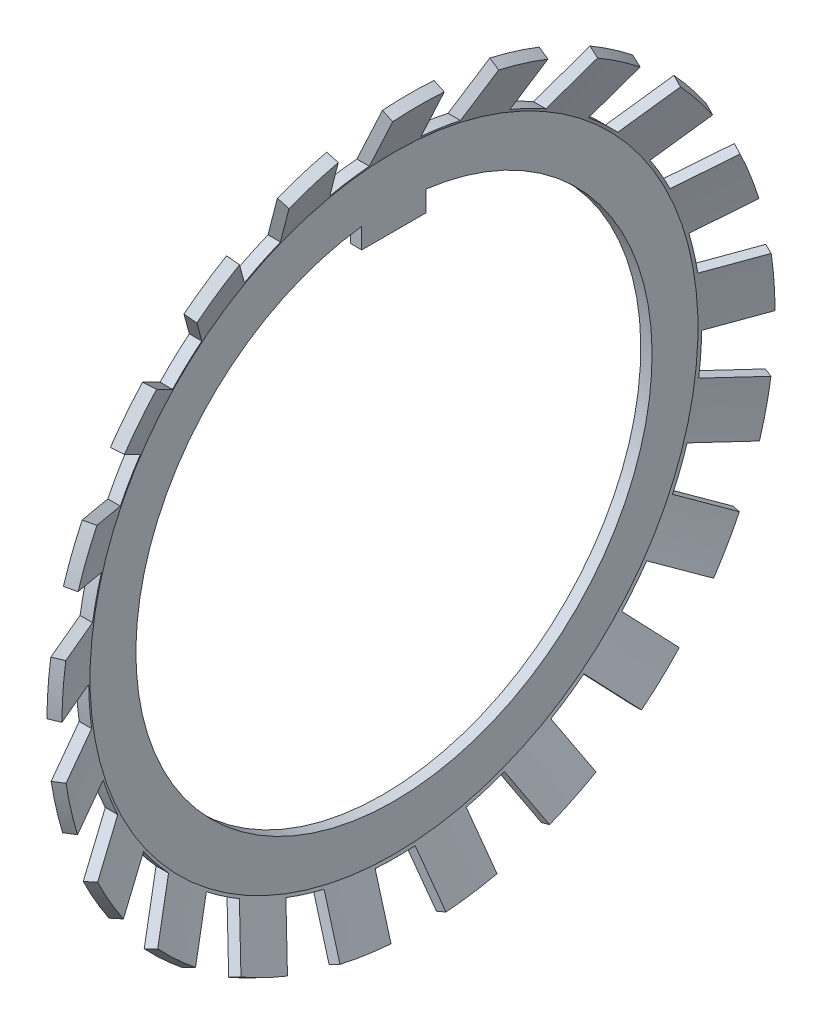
ISO-10303-21;
HEADER;
FILE_DESCRIPTION(('STEP AP214'),'2;1');
FILE_NAME('part.step','',(''),(''),'','','');
FILE_SCHEMA(('AUTOMOTIVE_DESIGN { 1 0 10303 214 1 1 1 1 }'));
ENDSEC;
DATA;
#1=APPLICATION_CONTEXT('core data for automotive mechanical design processes');
#2=APPLICATION_PROTOCOL_DEFINITION('international standard','automotive_design',2000,#1);
#3=PRODUCT_CONTEXT('',#1,'mechanical');
#4=PRODUCT('Part','Part','',(#3));
#5=PRODUCT_RELATED_PRODUCT_CATEGORY('part','',(#4));
#6=PRODUCT_DEFINITION_FORMATION('','',#4);
#7=PRODUCT_DEFINITION_CONTEXT('part definition',#1,'design');
#8=PRODUCT_DEFINITION('design','',#6,#7);
#9=PRODUCT_DEFINITION_SHAPE('','',#8);
#10=(LENGTH_UNIT() NAMED_UNIT(*) SI_UNIT(.MILLI.,.METRE.));
#11=(NAMED_UNIT(*) PLANE_ANGLE_UNIT() SI_UNIT($,.RADIAN.));
#12=(NAMED_UNIT(*) SI_UNIT($,.STERADIAN.) SOLID_ANGLE_UNIT());
#13=UNCERTAINTY_MEASURE_WITH_UNIT(LENGTH_MEASURE(1.E-05),#10,'distance_accuracy_value','');
#14=(GEOMETRIC_REPRESENTATION_CONTEXT(3) GLOBAL_UNCERTAINTY_ASSIGNED_CONTEXT((#13)) GLOBAL_UNIT_ASSIGNED_CONTEXT((#10,
#11,#12)) REPRESENTATION_CONTEXT('',''));
#15=CARTESIAN_POINT('',(0.,0.,0.));
#16=DIRECTION('',(0.,0.,1.));
#17=DIRECTION('',(1.,0.,0.));
#18=AXIS2_PLACEMENT_3D('',#15,#16,#17);
#19=CARTESIAN_POINT('',(3.96361509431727,0.,0.));
#20=DIRECTION('',(1.,0.,0.));
#21=DIRECTION('',(0.,1.,0.));
#22=AXIS2_PLACEMENT_3D('',#19,#20,#21);
#23=CONICAL_SURFACE('',#22,56.,1.13446401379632);
#24=CARTESIAN_POINT('',(-1.92771146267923E-13,0.,0.));
#25=DIRECTION('',(-1.,0.,0.));
#26=DIRECTION('',(0.,-1.,0.));
#27=AXIS2_PLACEMENT_3D('',#24,#25,#26);
#28=CIRCLE('',#27,47.5);
#29=CARTESIAN_POINT('',(0.,-0.45174425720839,47.497851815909));
#30=VERTEX_POINT('',#29);
#31=CARTESIAN_POINT('',(0.,7.52588612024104,46.9000110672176));
#32=VERTEX_POINT('',#31);
#33=EDGE_CURVE('E606',#30,#32,#28,.T.);
#34=ORIENTED_EDGE('',*,*,#33,.F.);
#35=CARTESIAN_POINT('',(-9.31908447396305E-05,-0.451759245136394,47.497651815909));
#36=CARTESIAN_POINT('',(0.66027040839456,-0.34555738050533,48.9148172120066));
#37=CARTESIAN_POINT('',(1.32076900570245,-0.239360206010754,50.3319200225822));
#38=CARTESIAN_POINT('',(2.64203619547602,-0.0269752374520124,53.1660004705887));
#39=CARTESIAN_POINT('',(3.3028047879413,0.0792125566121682,54.5829781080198));
#40=CARTESIAN_POINT('',(3.96370837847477,0.185395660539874,55.999893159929));
#41=B_SPLINE_CURVE_WITH_KNOTS('',3,(#35,#36,#37,#38,#39,#40),.UNSPECIFIED.,.F.,.F.,(4,2,4),(0.,
4.70121787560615,9.40243574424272),.UNSPECIFIED.);
#42=CARTESIAN_POINT('',(3.96361509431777,0.18538067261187,55.999693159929));
#43=VERTEX_POINT('',#42);
#44=EDGE_CURVE('E581',#30,#43,#41,.T.);
#45=ORIENTED_EDGE('',*,*,#44,.T.);
#46=CARTESIAN_POINT('',(3.96361509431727,0.,0.));
#47=DIRECTION('',(-1.,0.,0.));
#48=DIRECTION('',(0.,-1.,0.));
#49=AXIS2_PLACEMENT_3D('',#46,#47,#48);
#50=CIRCLE('',#49,56.);
#51=CARTESIAN_POINT('',(3.96361509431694,8.1630110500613,55.401852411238));
#52=VERTEX_POINT('',#51);
#53=EDGE_CURVE('E1470',#43,#52,#50,.T.);
#54=ORIENTED_EDGE('',*,*,#53,.T.);
#55=CARTESIAN_POINT('',(3.96370837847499,8.1630260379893,55.402052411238));
#56=CARTESIAN_POINT('',(3.30280478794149,8.0568429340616,53.9851373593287));
#57=CARTESIAN_POINT('',(2.64203619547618,7.95065513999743,52.5681597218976));
#58=CARTESIAN_POINT('',(1.32076900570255,7.7382701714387,49.734079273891));
#59=CARTESIAN_POINT('',(0.66027040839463,7.63207299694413,48.3169764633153));
#60=CARTESIAN_POINT('',(-9.31908446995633E-05,7.52587113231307,46.8998110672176));
#61=B_SPLINE_CURVE_WITH_KNOTS('',3,(#55,#56,#57,#58,#59,#60),.UNSPECIFIED.,.F.,.F.,(4,2,4),(0.,
4.70121786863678,9.40243574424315),.UNSPECIFIED.);
#62=EDGE_CURVE('E607',#52,#32,#61,.T.);
#63=ORIENTED_EDGE('',*,*,#62,.T.);
#64=EDGE_LOOP('',(#34,#45,#54,#63));
#65=FACE_BOUND('',#64,.T.);
#66=ADVANCED_FACE('F31',(#65),#23,.T.);
#67=CARTESIAN_POINT('',(3.96361509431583,-16.3290545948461,53.5664258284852));
#68=VERTEX_POINT('',#67);
#69=CARTESIAN_POINT('',(3.96361509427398,-8.5296312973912,55.346593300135));
#70=VERTEX_POINT('',#69);
#71=EDGE_CURVE('E1466',#68,#70,#50,.T.);
#72=ORIENTED_EDGE('',*,*,#71,.T.);
#73=CARTESIAN_POINT('',(3.96371050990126,-8.52967694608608,55.346793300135));
#74=CARTESIAN_POINT('',(3.30280620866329,-8.2134992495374,53.9615283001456));
#75=CARTESIAN_POINT('',(2.64203690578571,-7.89730758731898,52.576202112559));
#76=CARTESIAN_POINT('',(1.32076829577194,-7.26489633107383,49.8054273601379));
#77=CARTESIAN_POINT('',(0.660268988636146,-6.94867673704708,48.4199787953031));
#78=CARTESIAN_POINT('',(-9.53201388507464E-05,-6.63244317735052,47.034469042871));
#79=B_SPLINE_CURVE_WITH_KNOTS('',3,(#73,#74,#75,#76,#77,#78),.UNSPECIFIED.,.F.,.F.,(4,2,4),(0.,
4.70122292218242,9.40244585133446),.UNSPECIFIED.);
#80=CARTESIAN_POINT('',(0.,-6.63248882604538,47.034669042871));
#81=VERTEX_POINT('',#80);
#82=EDGE_CURVE('E1140',#70,#81,#79,.T.);
#83=ORIENTED_EDGE('',*,*,#82,.T.);
#84=CARTESIAN_POINT('',(0.,-14.4319121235,45.25450157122));
#85=VERTEX_POINT('',#84);
#86=EDGE_CURVE('E610',#85,#81,#28,.T.);
#87=ORIENTED_EDGE('',*,*,#86,.F.);
#88=CARTESIAN_POINT('',(-9.53201391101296E-05,-14.4318664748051,45.25430157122));
#89=CARTESIAN_POINT('',(0.660268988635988,-14.7481000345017,46.6398113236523));
#90=CARTESIAN_POINT('',(1.32076829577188,-15.0643196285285,48.0252598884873));
#91=CARTESIAN_POINT('',(2.64203690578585,-15.6967308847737,50.7960346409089));
#92=CARTESIAN_POINT('',(3.30280620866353,-16.0129225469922,52.1813608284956));
#93=CARTESIAN_POINT('',(3.9637105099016,-16.3291002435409,53.5666258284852));
#94=B_SPLINE_CURVE_WITH_KNOTS('',3,(#88,#89,#90,#91,#92,#93),.UNSPECIFIED.,.F.,.F.,(4,2,4),(0.,
4.70122292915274,9.40244585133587),.UNSPECIFIED.);
#95=EDGE_CURVE('E1141',#85,#68,#94,.T.);
#96=ORIENTED_EDGE('',*,*,#95,.T.);
#97=EDGE_LOOP('',(#72,#83,#87,#96));
#98=FACE_BOUND('',#97,.T.);
#99=ADVANCED_FACE('F1452',(#98),#23,.T.);
#100=CARTESIAN_POINT('',(3.96361509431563,-31.3925817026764,46.3735464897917));
#101=VERTEX_POINT('',#100);
#102=CARTESIAN_POINT('',(3.96361509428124,-24.4643784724,50.373546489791));
#103=VERTEX_POINT('',#102);
#104=EDGE_CURVE('E1469',#101,#103,#50,.T.);
#105=ORIENTED_EDGE('',*,*,#104,.T.);
#106=CARTESIAN_POINT('',(3.96372250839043,-24.4644939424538,50.373746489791));
#107=CARTESIAN_POINT('',(3.30281420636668,-23.7540448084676,49.1432124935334));
#108=CARTESIAN_POINT('',(2.64204090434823,-23.0435642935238,47.9126241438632));
#109=CARTESIAN_POINT('',(1.32076429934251,-21.6225405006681,45.4513387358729));
#110=CARTESIAN_POINT('',(0.660260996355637,-20.9119972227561,44.2206416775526));
#111=CARTESIAN_POINT('',(-0.000107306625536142,-20.2014225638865,42.9898902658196));
#112=B_SPLINE_CURVE_WITH_KNOTS('',3,(#106,#107,#108,#109,#110,#111),.UNSPECIFIED.,.F.,.F.,(4,2,
4),(0.,4.70125137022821,9.40250274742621),.UNSPECIFIED.);
#113=CARTESIAN_POINT('',(0.,-20.2015380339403,42.9900902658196));
#114=VERTEX_POINT('',#113);
#115=EDGE_CURVE('E1422',#103,#114,#112,.T.);
#116=ORIENTED_EDGE('',*,*,#115,.T.);
#117=CARTESIAN_POINT('',(0.,-27.129741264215,38.990090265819));
#118=VERTEX_POINT('',#117);
#119=EDGE_CURVE('E1896',#118,#114,#28,.T.);
#120=ORIENTED_EDGE('',*,*,#119,.F.);
#121=CARTESIAN_POINT('',(-0.000107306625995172,-27.1296257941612,38.989890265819));
#122=CARTESIAN_POINT('',(0.660260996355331,-27.840200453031,40.2206416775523));
#123=CARTESIAN_POINT('',(1.32076429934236,-28.5507437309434,41.4513387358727));
#124=CARTESIAN_POINT('',(2.64204090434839,-29.9717675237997,43.9126241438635));
#125=CARTESIAN_POINT('',(3.30281420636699,-30.6822480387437,45.1432124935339));
#126=CARTESIAN_POINT('',(3.96372250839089,-31.3926971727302,46.3737464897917));
#127=B_SPLINE_CURVE_WITH_KNOTS('',3,(#121,#122,#123,#124,#125,#126),.UNSPECIFIED.,.F.,.F.,(4,2,
4),(0.,4.70125137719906,9.40250274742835),.UNSPECIFIED.);
#128=EDGE_CURVE('E1415',#118,#101,#127,.T.);
#129=ORIENTED_EDGE('',*,*,#128,.T.);
#130=EDGE_LOOP('',(#105,#116,#120,#129));
#131=FACE_BOUND('',#130,.T.);
#132=ADVANCED_FACE('F1456',(#131),#23,.T.);
#133=CARTESIAN_POINT('',(3.96361509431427,-43.6667401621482,35.060174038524));
#134=VERTEX_POINT('',#133);
#135=CARTESIAN_POINT('',(3.96361509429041,-38.22535825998,40.924589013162));
#136=VERTEX_POINT('',#135);
#137=EDGE_CURVE('E1472',#134,#136,#50,.T.);
#138=ORIENTED_EDGE('',*,*,#137,.T.);
#139=CARTESIAN_POINT('',(3.96374199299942,-38.22555825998,40.9247745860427));
#140=CARTESIAN_POINT('',(3.30282719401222,-37.1839558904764,39.958308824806));
#141=CARTESIAN_POINT('',(2.64204739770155,-36.1423075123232,38.9918003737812));
#142=CARTESIAN_POINT('',(1.32075780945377,-34.0589187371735,37.0586980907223));
#143=CARTESIAN_POINT('',(0.660248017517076,-33.0171783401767,36.0921042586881));
#144=CARTESIAN_POINT('',(-0.000126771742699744,-31.9753919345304,35.1254677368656));
#145=B_SPLINE_CURVE_WITH_KNOTS('',3,(#139,#140,#141,#142,#143,#144),.UNSPECIFIED.,.F.,.F.,(4,2,
4),(0.,4.70129756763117,9.4025951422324),.UNSPECIFIED.);
#146=CARTESIAN_POINT('',(0.,-31.9755919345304,35.1256533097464));
#147=VERTEX_POINT('',#146);
#148=EDGE_CURVE('E1408',#136,#147,#145,.T.);
#149=ORIENTED_EDGE('',*,*,#148,.T.);
#150=CARTESIAN_POINT('',(0.,-37.416973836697,29.261238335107));
#151=VERTEX_POINT('',#150);
#152=EDGE_CURVE('E1898',#151,#147,#28,.T.);
#153=ORIENTED_EDGE('',*,*,#152,.F.);
#154=CARTESIAN_POINT('',(-0.000126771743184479,-37.416773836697,29.2610527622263));
#155=CARTESIAN_POINT('',(0.660248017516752,-38.4585602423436,30.227689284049));
#156=CARTESIAN_POINT('',(1.32075780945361,-39.5003006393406,31.1942831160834));
#157=CARTESIAN_POINT('',(2.6420473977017,-41.5836894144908,33.1273853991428));
#158=CARTESIAN_POINT('',(3.30282719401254,-42.6253377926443,34.0938938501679));
#159=CARTESIAN_POINT('',(3.9637419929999,-43.6669401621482,35.0603596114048));
#160=B_SPLINE_CURVE_WITH_KNOTS('',3,(#154,#155,#156,#157,#158,#159),.UNSPECIFIED.,.F.,.F.,(4,2,
4),(0.,4.70129757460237,9.40259514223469),.UNSPECIFIED.);
#161=EDGE_CURVE('E1401',#151,#134,#160,.T.);
#162=ORIENTED_EDGE('',*,*,#161,.T.);
#163=EDGE_LOOP('',(#138,#149,#153,#162));
#164=FACE_BOUND('',#163,.T.);
#165=ADVANCED_FACE('F1461',(#164),#23,.T.);
#166=CARTESIAN_POINT('',(3.963615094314,-52.0609171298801,20.6315512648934));
#167=VERTEX_POINT('',#166);
#168=CARTESIAN_POINT('',(3.96361509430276,-48.589847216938,27.839302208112));
#169=VERTEX_POINT('',#168);
#170=EDGE_CURVE('E1478',#167,#169,#50,.T.);
#171=ORIENTED_EDGE('',*,*,#170,.T.);
#172=CARTESIAN_POINT('',(3.96371834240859,-48.590047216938,27.8393985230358));
#173=CARTESIAN_POINT('',(3.30281142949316,-47.309864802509,27.222895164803));
#174=CARTESIAN_POINT('',(2.6420395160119,-46.0296258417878,26.6063645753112));
#175=CARTESIAN_POINT('',(1.32076568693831,-43.469034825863,25.3732489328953));
#176=CARTESIAN_POINT('',(0.660263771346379,-42.1886827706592,24.7566638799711));
#177=CARTESIAN_POINT('',(-0.000103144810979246,-40.9082741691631,24.1400515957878));
#178=B_SPLINE_CURVE_WITH_KNOTS('',3,(#172,#173,#174,#175,#176,#177),.UNSPECIFIED.,.F.,.F.,(4,2,
4),(0.,4.70124149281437,9.40248299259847),.UNSPECIFIED.);
#179=CARTESIAN_POINT('',(0.,-40.9084741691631,24.1401479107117));
#180=VERTEX_POINT('',#179);
#181=EDGE_CURVE('E1394',#169,#180,#178,.T.);
#182=ORIENTED_EDGE('',*,*,#181,.T.);
#183=CARTESIAN_POINT('',(0.,-44.379544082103,16.932396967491));
#184=VERTEX_POINT('',#183);
#185=EDGE_CURVE('E1899',#184,#180,#28,.T.);
#186=ORIENTED_EDGE('',*,*,#185,.F.);
#187=CARTESIAN_POINT('',(-0.000103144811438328,-44.379344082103,16.9323006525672));
#188=CARTESIAN_POINT('',(0.660263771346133,-45.6597526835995,17.5489129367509));
#189=CARTESIAN_POINT('',(1.32076568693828,-46.9401047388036,18.1654979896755));
#190=CARTESIAN_POINT('',(2.6420395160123,-49.5006957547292,19.3986136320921));
#191=CARTESIAN_POINT('',(3.30281142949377,-50.7809347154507,20.0151442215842));
#192=CARTESIAN_POINT('',(3.96371834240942,-52.0611171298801,20.6316475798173));
#193=B_SPLINE_CURVE_WITH_KNOTS('',3,(#187,#188,#189,#190,#191,#192),.UNSPECIFIED.,.F.,.F.,(4,2,
4),(0.,4.70124149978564,9.40248299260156),.UNSPECIFIED.);
#194=EDGE_CURVE('E1387',#184,#167,#193,.T.);
#195=ORIENTED_EDGE('',*,*,#194,.T.);
#196=EDGE_LOOP('',(#171,#182,#186,#195));
#197=FACE_BOUND('',#196,.T.);
#198=ADVANCED_FACE('F2775',(#197),#23,.T.);
#199=CARTESIAN_POINT('',(3.96361509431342,-55.8292531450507,4.36972462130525));
#200=VERTEX_POINT('',#199);
#201=CARTESIAN_POINT('',(3.96361509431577,-54.63691501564,12.280371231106));
#202=VERTEX_POINT('',#201);
#203=EDGE_CURVE('E1474',#200,#202,#50,.T.);
#204=ORIENTED_EDGE('',*,*,#203,.T.);
#205=CARTESIAN_POINT('',(3.96370916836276,-54.63711501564,12.2804013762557));
#206=CARTESIAN_POINT('',(3.30280531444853,-53.2320964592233,12.0686289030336));
#207=CARTESIAN_POINT('',(2.64203645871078,-51.8270158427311,11.8568470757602));
#208=CARTESIAN_POINT('',(1.32076874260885,-49.0167304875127,11.4332647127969));
#209=CARTESIAN_POINT('',(0.660269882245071,-47.6115257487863,11.2214641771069));
#210=CARTESIAN_POINT('',(-9.39799418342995E-05,-46.2062589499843,11.0096542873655));
#211=B_SPLINE_CURVE_WITH_KNOTS('',3,(#205,#206,#207,#208,#209,#210),.UNSPECIFIED.,.F.,.F.,(4,2,
4),(0.,4.70121974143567,9.40243948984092),.UNSPECIFIED.);
#212=CARTESIAN_POINT('',(0.,-46.2064589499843,11.0096844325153));
#213=VERTEX_POINT('',#212);
#214=EDGE_CURVE('E1380',#202,#213,#211,.T.);
#215=ORIENTED_EDGE('',*,*,#214,.T.);
#216=CARTESIAN_POINT('',(0.,-47.398797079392,3.099037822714));
#217=VERTEX_POINT('',#216);
#218=EDGE_CURVE('E812',#217,#213,#28,.T.);
#219=ORIENTED_EDGE('',*,*,#218,.F.);
#220=CARTESIAN_POINT('',(-9.397994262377E-05,-47.398597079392,3.09900767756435));
#221=CARTESIAN_POINT('',(0.660269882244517,-48.8038638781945,3.31081756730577));
#222=CARTESIAN_POINT('',(1.32076874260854,-50.2090686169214,3.52261810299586));
#223=CARTESIAN_POINT('',(2.64203645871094,-53.0193539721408,3.94620046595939));
#224=CARTESIAN_POINT('',(3.30280531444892,-54.4244345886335,4.15798229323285));
#225=CARTESIAN_POINT('',(3.96370916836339,-55.8294531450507,4.36975476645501));
#226=B_SPLINE_CURVE_WITH_KNOTS('',3,(#220,#221,#222,#223,#224,#225),.UNSPECIFIED.,.F.,.F.,(4,2,
4),(0.,4.70121974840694,9.40243948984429),.UNSPECIFIED.);
#227=EDGE_CURVE('E1373',#217,#200,#226,.T.);
#228=ORIENTED_EDGE('',*,*,#227,.T.);
#229=EDGE_LOOP('',(#204,#215,#219,#228));
#230=FACE_BOUND('',#229,.T.);
#231=ADVANCED_FACE('F2782',(#230),#23,.T.);
#232=CARTESIAN_POINT('',(3.96361509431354,-54.6369150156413,-12.2803712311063));
#233=VERTEX_POINT('',#232);
#234=CARTESIAN_POINT('',(3.96361509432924,-55.829253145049,-4.3697246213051));
#235=VERTEX_POINT('',#234);
#236=EDGE_CURVE('E1479',#233,#235,#50,.T.);
#237=ORIENTED_EDGE('',*,*,#236,.T.);
#238=CARTESIAN_POINT('',(3.96370916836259,-55.829453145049,-4.36975476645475));
#239=CARTESIAN_POINT('',(3.30280531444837,-54.4244345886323,-4.15798229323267));
#240=CARTESIAN_POINT('',(2.64203645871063,-53.0193539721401,-3.94620046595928));
#241=CARTESIAN_POINT('',(1.32076874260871,-50.2090686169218,-3.52261810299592));
#242=CARTESIAN_POINT('',(0.660269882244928,-48.8038638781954,-3.3108175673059));
#243=CARTESIAN_POINT('',(-9.39799419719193E-05,-47.3985970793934,-3.09900767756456));
#244=B_SPLINE_CURVE_WITH_KNOTS('',3,(#238,#239,#240,#241,#242,#243),.UNSPECIFIED.,.F.,.F.,(4,2,
4),(0.,4.70121974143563,9.40243948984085),.UNSPECIFIED.);
#245=CARTESIAN_POINT('',(0.,-47.3987970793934,-3.0990378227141));
#246=VERTEX_POINT('',#245);
#247=EDGE_CURVE('E1366',#235,#246,#244,.T.);
#248=ORIENTED_EDGE('',*,*,#247,.T.);
#249=CARTESIAN_POINT('',(0.,-46.206458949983,-11.009684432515));
#250=VERTEX_POINT('',#249);
#251=EDGE_CURVE('E1477',#250,#246,#28,.T.);
#252=ORIENTED_EDGE('',*,*,#251,.F.);
#253=CARTESIAN_POINT('',(-9.39799424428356E-05,-46.206258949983,-11.0096542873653));
#254=CARTESIAN_POINT('',(0.660269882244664,-47.6115257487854,-11.2214641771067));
#255=CARTESIAN_POINT('',(1.32076874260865,-49.0167304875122,-11.4332647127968));
#256=CARTESIAN_POINT('',(2.64203645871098,-51.8270158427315,-11.8568470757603));
#257=CARTESIAN_POINT('',(3.30280531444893,-53.2320964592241,-12.0686289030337));
#258=CARTESIAN_POINT('',(3.96370916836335,-54.6371150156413,-12.2804013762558));
#259=B_SPLINE_CURVE_WITH_KNOTS('',3,(#253,#254,#255,#256,#257,#258),.UNSPECIFIED.,.F.,.F.,(4,2,
4),(0.,4.70121974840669,9.40243948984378),.UNSPECIFIED.);
#260=EDGE_CURVE('E1359',#250,#233,#259,.T.);
#261=ORIENTED_EDGE('',*,*,#260,.T.);
#262=EDGE_LOOP('',(#237,#248,#252,#261));
#263=FACE_BOUND('',#262,.T.);
#264=ADVANCED_FACE('F2079',(#263),#23,.T.);
#265=CARTESIAN_POINT('',(3.96361509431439,-48.5898472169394,-27.8393022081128));
#266=VERTEX_POINT('',#265);
#267=CARTESIAN_POINT('',(3.96361509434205,-52.060917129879,-20.631551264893));
#268=VERTEX_POINT('',#267);
#269=EDGE_CURVE('E2070',#266,#268,#50,.T.);
#270=ORIENTED_EDGE('',*,*,#269,.T.);
#271=CARTESIAN_POINT('',(3.96371834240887,-52.061117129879,-20.6316475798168));
#272=CARTESIAN_POINT('',(3.30281142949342,-50.78093471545,-20.0151442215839));
#273=CARTESIAN_POINT('',(2.64203951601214,-49.5006957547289,-19.3986136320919));
#274=CARTESIAN_POINT('',(1.32076568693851,-46.9401047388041,-18.1654979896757));
#275=CARTESIAN_POINT('',(0.660263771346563,-45.6597526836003,-17.5489129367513));
#276=CARTESIAN_POINT('',(-0.000103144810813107,-44.3793440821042,-16.9323006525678));
#277=B_SPLINE_CURVE_WITH_KNOTS('',3,(#271,#272,#273,#274,#275,#276),.UNSPECIFIED.,.F.,.F.,(4,2,
4),(0.,4.70124149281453,9.40248299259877),.UNSPECIFIED.);
#278=CARTESIAN_POINT('',(0.,-44.3795440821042,-16.9323969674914));
#279=VERTEX_POINT('',#278);
#280=EDGE_CURVE('E1352',#268,#279,#277,.T.);
#281=ORIENTED_EDGE('',*,*,#280,.T.);
#282=CARTESIAN_POINT('',(0.,-40.908474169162,-24.140147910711));
#283=VERTEX_POINT('',#282);
#284=EDGE_CURVE('E1903',#283,#279,#28,.T.);
#285=ORIENTED_EDGE('',*,*,#284,.F.);
#286=CARTESIAN_POINT('',(-0.000103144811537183,-40.908274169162,-24.1400515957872));
#287=CARTESIAN_POINT('',(0.660263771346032,-42.1886827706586,-24.7566638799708));
#288=CARTESIAN_POINT('',(1.32076568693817,-43.4690348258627,-25.3732489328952));
#289=CARTESIAN_POINT('',(2.64203951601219,-46.0296258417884,-26.6063645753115));
#290=CARTESIAN_POINT('',(3.30281142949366,-47.30986480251,-27.2228951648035));
#291=CARTESIAN_POINT('',(3.96371834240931,-48.5900472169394,-27.8393985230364));
#292=B_SPLINE_CURVE_WITH_KNOTS('',3,(#286,#287,#288,#289,#290,#291),.UNSPECIFIED.,.F.,.F.,(4,2,
4),(0.,4.7012414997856,9.40248299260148),.UNSPECIFIED.);
#293=EDGE_CURVE('E1345',#283,#266,#292,.T.);
#294=ORIENTED_EDGE('',*,*,#293,.T.);
#295=EDGE_LOOP('',(#270,#281,#285,#294));
#296=FACE_BOUND('',#295,.T.);
#297=ADVANCED_FACE('F2795',(#296),#23,.T.);
#298=CARTESIAN_POINT('',(3.96361509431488,-38.2253582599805,-40.9245890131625));
#299=VERTEX_POINT('',#298);
#300=CARTESIAN_POINT('',(3.963615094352,-43.666740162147,-35.060174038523));
#301=VERTEX_POINT('',#300);
#302=EDGE_CURVE('E2064',#299,#301,#50,.T.);
#303=ORIENTED_EDGE('',*,*,#302,.T.);
#304=CARTESIAN_POINT('',(3.96374199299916,-43.666940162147,-35.0603596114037));
#305=CARTESIAN_POINT('',(3.30282719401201,-42.6253377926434,-34.0938938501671));
#306=CARTESIAN_POINT('',(2.64204739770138,-41.5836894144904,-33.1273853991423));
#307=CARTESIAN_POINT('',(1.32075780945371,-39.5003006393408,-31.1942831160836));
#308=CARTESIAN_POINT('',(0.660248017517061,-38.4585602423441,-30.2276892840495));
#309=CARTESIAN_POINT('',(-0.000126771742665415,-37.4167738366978,-29.2610527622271));
#310=B_SPLINE_CURVE_WITH_KNOTS('',3,(#304,#305,#306,#307,#308,#309),.UNSPECIFIED.,.F.,.F.,(4,2,
4),(0.,4.70129756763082,9.40259514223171),.UNSPECIFIED.);
#311=CARTESIAN_POINT('',(0.,-37.4169738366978,-29.2612383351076));
#312=VERTEX_POINT('',#311);
#313=EDGE_CURVE('E1338',#301,#312,#310,.T.);
#314=ORIENTED_EDGE('',*,*,#313,.T.);
#315=CARTESIAN_POINT('',(0.,-31.97559193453,-35.125653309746));
#316=VERTEX_POINT('',#315);
#317=EDGE_CURVE('E1906',#316,#312,#28,.T.);
#318=ORIENTED_EDGE('',*,*,#317,.F.);
#319=CARTESIAN_POINT('',(-0.000126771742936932,-31.97539193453,-35.1254677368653));
#320=CARTESIAN_POINT('',(0.660248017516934,-33.0171783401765,-36.0921042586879));
#321=CARTESIAN_POINT('',(1.32075780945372,-34.0589187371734,-37.0586980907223));
#322=CARTESIAN_POINT('',(2.64204739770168,-36.1423075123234,-38.9918003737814));
#323=CARTESIAN_POINT('',(3.30282719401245,-37.1839558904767,-39.9583088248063));
#324=CARTESIAN_POINT('',(3.96374199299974,-38.2255582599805,-40.9247745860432));
#325=B_SPLINE_CURVE_WITH_KNOTS('',3,(#319,#320,#321,#322,#323,#324),.UNSPECIFIED.,.F.,.F.,(4,2,
4),(0.,4.70129757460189,9.4025951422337),.UNSPECIFIED.);
#326=EDGE_CURVE('E1331',#316,#299,#325,.T.);
#327=ORIENTED_EDGE('',*,*,#326,.T.);
#328=EDGE_LOOP('',(#303,#314,#318,#327));
#329=FACE_BOUND('',#328,.T.);
#330=ADVANCED_FACE('F2802',(#329),#23,.T.);
#331=CARTESIAN_POINT('',(3.96361509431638,-24.4643784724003,-50.3735464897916));
#332=VERTEX_POINT('',#331);
#333=CARTESIAN_POINT('',(3.96361509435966,-31.392581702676,-46.373546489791));
#334=VERTEX_POINT('',#333);
#335=EDGE_CURVE('E2058',#332,#334,#50,.T.);
#336=ORIENTED_EDGE('',*,*,#335,.T.);
#337=CARTESIAN_POINT('',(3.96372250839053,-31.3926971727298,-46.373746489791));
#338=CARTESIAN_POINT('',(3.30281420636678,-30.6822480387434,-45.1432124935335));
#339=CARTESIAN_POINT('',(2.64204090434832,-29.9717675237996,-43.9126241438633));
#340=CARTESIAN_POINT('',(1.32076429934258,-28.5507437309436,-41.4513387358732));
#341=CARTESIAN_POINT('',(0.660260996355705,-27.8402004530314,-40.220641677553));
#342=CARTESIAN_POINT('',(-0.000107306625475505,-27.1296257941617,-38.98989026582));
#343=B_SPLINE_CURVE_WITH_KNOTS('',3,(#337,#338,#339,#340,#341,#342),.UNSPECIFIED.,.F.,.F.,(4,2,
4),(0.,4.70125137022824,9.40250274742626),.UNSPECIFIED.);
#344=CARTESIAN_POINT('',(0.,-27.1297412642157,-38.99009026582));
#345=VERTEX_POINT('',#344);
#346=EDGE_CURVE('E1324',#334,#345,#343,.T.);
#347=ORIENTED_EDGE('',*,*,#346,.T.);
#348=CARTESIAN_POINT('',(0.,-20.20153803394,-42.990090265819));
#349=VERTEX_POINT('',#348);
#350=EDGE_CURVE('E1910',#349,#345,#28,.T.);
#351=ORIENTED_EDGE('',*,*,#350,.F.);
#352=CARTESIAN_POINT('',(-0.000107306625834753,-20.2014225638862,-42.989890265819));
#353=CARTESIAN_POINT('',(0.660260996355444,-20.9119972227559,-44.2206416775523));
#354=CARTESIAN_POINT('',(1.32076429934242,-21.6225405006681,-45.4513387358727));
#355=CARTESIAN_POINT('',(2.64204090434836,-23.043564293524,-47.9126241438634));
#356=CARTESIAN_POINT('',(3.30281420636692,-23.7540448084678,-49.1432124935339));
#357=CARTESIAN_POINT('',(3.96372250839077,-24.4644939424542,-50.3737464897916));
#358=B_SPLINE_CURVE_WITH_KNOTS('',3,(#352,#353,#354,#355,#356,#357),.UNSPECIFIED.,.F.,.F.,(4,2,
4),(0.,4.70125137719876,9.40250274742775),.UNSPECIFIED.);
#359=EDGE_CURVE('E1317',#349,#332,#358,.T.);
#360=ORIENTED_EDGE('',*,*,#359,.T.);
#361=EDGE_LOOP('',(#336,#347,#351,#360));
#362=FACE_BOUND('',#361,.T.);
#363=ADVANCED_FACE('F2809',(#362),#23,.T.);
#364=CARTESIAN_POINT('',(3.96361509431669,-8.5296312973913,-55.3465933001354));
#365=VERTEX_POINT('',#364);
#366=CARTESIAN_POINT('',(3.96361509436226,-16.329054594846,-53.566425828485));
#367=VERTEX_POINT('',#366);
#368=EDGE_CURVE('E2052',#365,#367,#50,.T.);
#369=ORIENTED_EDGE('',*,*,#368,.T.);
#370=CARTESIAN_POINT('',(3.96371050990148,-16.3291002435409,-53.566625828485));
#371=CARTESIAN_POINT('',(3.30280620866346,-16.0129225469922,-52.1813608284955));
#372=CARTESIAN_POINT('',(2.64203690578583,-15.6967308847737,-50.7960346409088));
#373=CARTESIAN_POINT('',(1.32076829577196,-15.0643196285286,-48.0252598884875));
#374=CARTESIAN_POINT('',(0.660268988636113,-14.7481000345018,-46.6398113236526));
#375=CARTESIAN_POINT('',(-9.53201389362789E-05,-14.4318664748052,-45.2543015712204));
#376=B_SPLINE_CURVE_WITH_KNOTS('',3,(#370,#371,#372,#373,#374,#375),.UNSPECIFIED.,.F.,.F.,(4,2,
4),(0.,4.70122292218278,9.40244585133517),.UNSPECIFIED.);
#377=CARTESIAN_POINT('',(0.,-14.4319121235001,-45.2545015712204));
#378=VERTEX_POINT('',#377);
#379=EDGE_CURVE('E1310',#367,#378,#376,.T.);
#380=ORIENTED_EDGE('',*,*,#379,.T.);
#381=CARTESIAN_POINT('',(0.,-6.6324888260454,-47.034669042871));
#382=VERTEX_POINT('',#381);
#383=EDGE_CURVE('E1914',#382,#378,#28,.T.);
#384=ORIENTED_EDGE('',*,*,#383,.F.);
#385=CARTESIAN_POINT('',(-9.53201388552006E-05,-6.63244317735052,-47.034469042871));
#386=CARTESIAN_POINT('',(0.660268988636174,-6.94867673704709,-48.4199787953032));
#387=CARTESIAN_POINT('',(1.320768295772,-7.26489633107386,-49.805427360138));
#388=CARTESIAN_POINT('',(2.64203690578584,-7.89730758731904,-52.5762021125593));
#389=CARTESIAN_POINT('',(3.30280620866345,-8.21349924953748,-53.9615283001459));
#390=CARTESIAN_POINT('',(3.96371050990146,-8.52967694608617,-55.3467933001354));
#391=B_SPLINE_CURVE_WITH_KNOTS('',3,(#385,#386,#387,#388,#389,#390),.UNSPECIFIED.,.F.,.F.,(4,2,
4),(0.,4.70122292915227,9.40244585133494),.UNSPECIFIED.);
#392=EDGE_CURVE('E1303',#382,#365,#391,.T.);
#393=ORIENTED_EDGE('',*,*,#392,.T.);
#394=EDGE_LOOP('',(#369,#380,#384,#393));
#395=FACE_BOUND('',#394,.T.);
#396=ADVANCED_FACE('F2816',(#395),#23,.T.);
#397=CARTESIAN_POINT('',(3.96361509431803,8.16301105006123,-55.4018524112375));
#398=VERTEX_POINT('',#397);
#399=CARTESIAN_POINT('',(3.9636150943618,0.18538067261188,-55.999693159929));
#400=VERTEX_POINT('',#399);
#401=EDGE_CURVE('E2046',#398,#400,#50,.T.);
#402=ORIENTED_EDGE('',*,*,#401,.T.);
#403=CARTESIAN_POINT('',(3.96370837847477,0.185395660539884,-55.999893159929));
#404=CARTESIAN_POINT('',(3.30280478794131,0.0792125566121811,-54.5829781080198));
#405=CARTESIAN_POINT('',(2.64203619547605,-0.0269752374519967,-53.1660004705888));
#406=CARTESIAN_POINT('',(1.32076900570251,-0.239360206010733,-50.3319200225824));
#407=CARTESIAN_POINT('',(0.660270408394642,-0.345557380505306,-48.9148172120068));
#408=CARTESIAN_POINT('',(-9.31908446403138E-05,-0.451759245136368,-47.4976518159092));
#409=B_SPLINE_CURVE_WITH_KNOTS('',3,(#403,#404,#405,#406,#407,#408),.UNSPECIFIED.,.F.,.F.,(4,2,
4),(0.,4.70121786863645,9.40243574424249),.UNSPECIFIED.);
#410=CARTESIAN_POINT('',(0.,-0.451744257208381,-47.4978518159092));
#411=VERTEX_POINT('',#410);
#412=EDGE_CURVE('E1296',#400,#411,#409,.T.);
#413=ORIENTED_EDGE('',*,*,#412,.T.);
#414=CARTESIAN_POINT('',(0.,7.5258861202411,-46.900011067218));
#415=VERTEX_POINT('',#414);
#416=EDGE_CURVE('E1918',#415,#411,#28,.T.);
#417=ORIENTED_EDGE('',*,*,#416,.F.);
#418=CARTESIAN_POINT('',(-9.31908445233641E-05,7.5258711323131,-46.899811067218));
#419=CARTESIAN_POINT('',(0.660270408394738,7.63207299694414,-48.3169764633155));
#420=CARTESIAN_POINT('',(1.32076900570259,7.7382701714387,-49.7340792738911));
#421=CARTESIAN_POINT('',(2.64203619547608,7.95065513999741,-52.5681597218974));
#422=CARTESIAN_POINT('',(3.30280478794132,8.05684293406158,-53.9851373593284));
#423=CARTESIAN_POINT('',(3.96370837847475,8.16302603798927,-55.4020524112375));
#424=B_SPLINE_CURVE_WITH_KNOTS('',3,(#418,#419,#420,#421,#422,#423),.UNSPECIFIED.,.F.,.F.,(4,2,
4),(0.,4.70121787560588,9.40243574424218),.UNSPECIFIED.);
#425=EDGE_CURVE('E1289',#415,#398,#424,.T.);
#426=ORIENTED_EDGE('',*,*,#425,.T.);
#427=EDGE_LOOP('',(#402,#413,#417,#426));
#428=FACE_BOUND('',#427,.T.);
#429=ADVANCED_FACE('F2823',(#428),#23,.T.);
#430=CARTESIAN_POINT('',(3.96361509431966,24.1303340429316,-50.5344138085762));
#431=VERTEX_POINT('',#430);
#432=CARTESIAN_POINT('',(3.96361509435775,16.683344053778,-53.457142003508));
#433=VERTEX_POINT('',#432);
#434=EDGE_CURVE('E2040',#431,#433,#50,.T.);
#435=ORIENTED_EDGE('',*,*,#434,.T.);
#436=CARTESIAN_POINT('',(3.96371502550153,16.6834225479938,-53.457342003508));
#437=CARTESIAN_POINT('',(3.30280921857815,16.1643120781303,-52.1346700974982));
#438=CARTESIAN_POINT('',(2.64203841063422,15.6451786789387,-50.8119397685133));
#439=CARTESIAN_POINT('',(1.32076679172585,14.6068660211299,-48.1663622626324));
#440=CARTESIAN_POINT('',(0.660265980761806,14.0876867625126,-46.8435150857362));
#441=CARTESIAN_POINT('',(-9.98312223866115E-05,13.5684845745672,-45.5206094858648));
#442=B_SPLINE_CURVE_WITH_KNOTS('',3,(#436,#437,#438,#439,#440,#441),.UNSPECIFIED.,.F.,.F.,(4,2,
4),(0.,4.70123362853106,9.40246726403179),.UNSPECIFIED.);
#443=CARTESIAN_POINT('',(0.,13.5685630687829,-45.5208094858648));
#444=VERTEX_POINT('',#443);
#445=EDGE_CURVE('E1282',#433,#444,#442,.T.);
#446=ORIENTED_EDGE('',*,*,#445,.T.);
#447=CARTESIAN_POINT('',(0.,21.015553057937,-42.598081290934));
#448=VERTEX_POINT('',#447);
#449=EDGE_CURVE('E1922',#448,#444,#28,.T.);
#450=ORIENTED_EDGE('',*,*,#449,.F.);
#451=CARTESIAN_POINT('',(-9.98312221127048E-05,21.0154745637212,-42.597881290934));
#452=CARTESIAN_POINT('',(0.660265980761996,21.5346767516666,-43.9207868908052));
#453=CARTESIAN_POINT('',(1.32076679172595,22.0538560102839,-45.2436340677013));
#454=CARTESIAN_POINT('',(2.64203841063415,23.0921686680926,-47.8892115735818));
#455=CARTESIAN_POINT('',(3.302809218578,23.611302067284,-49.2119419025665));
#456=CARTESIAN_POINT('',(3.96371502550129,24.1304125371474,-50.5346138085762));
#457=B_SPLINE_CURVE_WITH_KNOTS('',3,(#451,#452,#453,#454,#455,#456),.UNSPECIFIED.,.F.,.F.,(4,2,
4),(0.,4.70123363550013,9.40246726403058),.UNSPECIFIED.);
#458=EDGE_CURVE('E1275',#448,#431,#457,.T.);
#459=ORIENTED_EDGE('',*,*,#458,.T.);
#460=EDGE_LOOP('',(#435,#446,#450,#459));
#461=FACE_BOUND('',#460,.T.);
#462=ADVANCED_FACE('F2830',(#461),#23,.T.);
#463=CARTESIAN_POINT('',(3.96361509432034,37.9535709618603,-41.1767707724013));
#464=VERTEX_POINT('',#463);
#465=CARTESIAN_POINT('',(3.96361509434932,31.698919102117,-46.164689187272));
#466=VERTEX_POINT('',#465);
#467=EDGE_CURVE('E2034',#464,#466,#50,.T.);
#468=ORIENTED_EDGE('',*,*,#467,.T.);
#469=CARTESIAN_POINT('',(3.96373407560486,31.6990785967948,-46.164889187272));
#470=CARTESIAN_POINT('',(3.3028219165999,30.813157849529,-45.0539797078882));
#471=CARTESIAN_POINT('',(2.64204475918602,29.9271979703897,-43.9430211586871));
#472=CARTESIAN_POINT('',(1.320760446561,28.1551999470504,-41.721005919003));
#473=CARTESIAN_POINT('',(0.660253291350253,27.2691618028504,-40.6099492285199));
#474=CARTESIAN_POINT('',(-0.000118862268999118,26.3830845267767,-39.4988434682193));
#475=B_SPLINE_CURVE_WITH_KNOTS('',3,(#469,#470,#471,#472,#473,#474),.UNSPECIFIED.,.F.,.F.,(4,2,
4),(0.,4.70127879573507,9.4025575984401),.UNSPECIFIED.);
#476=CARTESIAN_POINT('',(0.,26.3832440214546,-39.4990434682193));
#477=VERTEX_POINT('',#476);
#478=EDGE_CURVE('E1268',#466,#477,#475,.T.);
#479=ORIENTED_EDGE('',*,*,#478,.T.);
#480=CARTESIAN_POINT('',(0.,32.637895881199,-34.51112505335));
#481=VERTEX_POINT('',#480);
#482=EDGE_CURVE('E1926',#481,#477,#28,.T.);
#483=ORIENTED_EDGE('',*,*,#482,.F.);
#484=CARTESIAN_POINT('',(-0.000118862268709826,32.6377363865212,-34.51092505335));
#485=CARTESIAN_POINT('',(0.660253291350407,33.5238136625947,-35.6220308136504));
#486=CARTESIAN_POINT('',(1.32076044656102,34.4098518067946,-36.7330875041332));
#487=CARTESIAN_POINT('',(2.64204475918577,36.1818498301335,-38.9551027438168));
#488=CARTESIAN_POINT('',(3.30282191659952,37.0678097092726,-40.0660612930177));
#489=CARTESIAN_POINT('',(3.96373407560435,37.9537304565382,-41.1769707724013));
#490=B_SPLINE_CURVE_WITH_KNOTS('',3,(#484,#485,#486,#487,#488,#489),.UNSPECIFIED.,.F.,.F.,(4,2,
4),(0.,4.70127880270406,9.40255759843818),.UNSPECIFIED.);
#491=EDGE_CURVE('E1261',#481,#464,#490,.T.);
#492=ORIENTED_EDGE('',*,*,#491,.T.);
#493=EDGE_LOOP('',(#468,#479,#483,#492));
#494=FACE_BOUND('',#493,.T.);
#495=ADVANCED_FACE('F2837',(#494),#23,.T.);
#496=CARTESIAN_POINT('',(3.9636150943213,48.4044665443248,-28.1603909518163));
#497=VERTEX_POINT('',#496);
#498=CARTESIAN_POINT('',(3.9636150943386,43.897906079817,-34.770301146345));
#499=VERTEX_POINT('',#498);
#500=EDGE_CURVE('E2028',#497,#499,#50,.T.);
#501=ORIENTED_EDGE('',*,*,#500,.T.);
#502=CARTESIAN_POINT('',(3.96372768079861,43.898106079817,-34.7704375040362));
#503=CARTESIAN_POINT('',(3.30281765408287,42.724101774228,-33.9700149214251));
#504=CARTESIAN_POINT('',(2.64204262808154,41.5500456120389,-33.1695569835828));
#505=CARTESIAN_POINT('',(1.32076257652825,39.2018295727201,-31.5685703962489));
#506=CARTESIAN_POINT('',(0.660257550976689,38.0276696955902,-30.7680417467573));
#507=CARTESIAN_POINT('',(-0.00011247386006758,36.8534579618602,-29.9674777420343));
#508=B_SPLINE_CURVE_WITH_KNOTS('',3,(#502,#503,#504,#505,#506,#507),.UNSPECIFIED.,.F.,.F.,(4,2,
4),(0.,4.70126363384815,9.40252727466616),.UNSPECIFIED.);
#509=CARTESIAN_POINT('',(0.,36.8536579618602,-29.9676140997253));
#510=VERTEX_POINT('',#509);
#511=EDGE_CURVE('E1254',#499,#510,#508,.T.);
#512=ORIENTED_EDGE('',*,*,#511,.T.);
#513=CARTESIAN_POINT('',(0.,41.36021842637,-23.357703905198));
#514=VERTEX_POINT('',#513);
#515=EDGE_CURVE('E1930',#514,#510,#28,.T.);
#516=ORIENTED_EDGE('',*,*,#515,.F.);
#517=CARTESIAN_POINT('',(-0.000112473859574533,41.36001842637,-23.3575675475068));
#518=CARTESIAN_POINT('',(0.660257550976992,42.5342301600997,-24.1581315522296));
#519=CARTESIAN_POINT('',(1.32076257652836,43.7083900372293,-24.958660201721));
#520=CARTESIAN_POINT('',(2.64204262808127,46.0566060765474,-26.5596467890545));
#521=CARTESIAN_POINT('',(3.30281765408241,47.2306622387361,-27.3601047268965));
#522=CARTESIAN_POINT('',(3.96372768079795,48.4046665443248,-28.1605273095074));
#523=B_SPLINE_CURVE_WITH_KNOTS('',3,(#517,#518,#519,#520,#521,#522),.UNSPECIFIED.,.F.,.F.,(4,2,
4),(0.,4.70126364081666,9.40252727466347),.UNSPECIFIED.);
#524=EDGE_CURVE('E1247',#514,#497,#523,.T.);
#525=ORIENTED_EDGE('',*,*,#524,.T.);
#526=EDGE_LOOP('',(#501,#512,#516,#525));
#527=FACE_BOUND('',#526,.T.);
#528=ADVANCED_FACE('F2844',(#527),#23,.T.);
#529=CARTESIAN_POINT('',(3.96361509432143,54.5544128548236,-12.6418368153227));
#530=VERTEX_POINT('',#529);
#531=CARTESIAN_POINT('',(3.96361509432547,52.196371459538,-20.286419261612));
#532=VERTEX_POINT('',#531);
#533=EDGE_CURVE('E2022',#530,#532,#50,.T.);
#534=ORIENTED_EDGE('',*,*,#533,.T.);
#535=CARTESIAN_POINT('',(3.96371244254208,52.196571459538,-20.2864809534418));
#536=CARTESIAN_POINT('',(3.30280749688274,50.8388066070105,-19.8676659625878));
#537=CARTESIAN_POINT('',(2.64203754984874,49.480981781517,-19.4488324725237));
#538=CARTESIAN_POINT('',(1.32076765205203,46.7652121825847,-18.6111284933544));
#539=CARTESIAN_POINT('',(0.660267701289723,45.4072674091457,-18.1922580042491));
#540=CARTESIAN_POINT('',(-9.72508468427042E-05,44.0492626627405,-17.7733690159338));
#541=B_SPLINE_CURVE_WITH_KNOTS('',3,(#535,#536,#537,#538,#539,#540),.UNSPECIFIED.,.F.,.F.,(4,2,
4),(0.,4.70122750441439,9.40245501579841),.UNSPECIFIED.);
#542=CARTESIAN_POINT('',(0.,44.0494626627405,-17.7734307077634));
#543=VERTEX_POINT('',#542);
#544=EDGE_CURVE('E1240',#532,#543,#541,.T.);
#545=ORIENTED_EDGE('',*,*,#544,.T.);
#546=CARTESIAN_POINT('',(0.,46.40750405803,-10.128848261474));
#547=VERTEX_POINT('',#546);
#548=EDGE_CURVE('E1934',#547,#543,#28,.T.);
#549=ORIENTED_EDGE('',*,*,#548,.F.);
#550=CARTESIAN_POINT('',(-9.72508458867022E-05,46.40730405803,-10.1287865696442));
#551=CARTESIAN_POINT('',(0.660267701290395,47.7653088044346,-10.5476755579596));
#552=CARTESIAN_POINT('',(1.32076765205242,49.1232535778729,-10.9665460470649));
#553=CARTESIAN_POINT('',(2.64203754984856,51.8390231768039,-11.8042500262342));
#554=CARTESIAN_POINT('',(3.30280749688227,53.1968480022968,-12.2230835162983));
#555=CARTESIAN_POINT('',(3.96371244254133,54.5546128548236,-12.6418985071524));
#556=B_SPLINE_CURVE_WITH_KNOTS('',3,(#550,#551,#552,#553,#554,#555),.UNSPECIFIED.,.F.,.F.,(4,2,
4),(0.,4.70122751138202,9.4024550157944),.UNSPECIFIED.);
#557=EDGE_CURVE('E1233',#547,#530,#556,.T.);
#558=ORIENTED_EDGE('',*,*,#557,.T.);
#559=EDGE_LOOP('',(#534,#545,#549,#558));
#560=FACE_BOUND('',#559,.T.);
#561=ADVANCED_FACE('F2851',(#560),#23,.T.);
#562=CARTESIAN_POINT('',(3.96361509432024,55.8569601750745,3.9999999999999));
#563=VERTEX_POINT('',#562);
#564=CARTESIAN_POINT('',(3.96361509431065,55.856960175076,-4.));
#565=VERTEX_POINT('',#564);
#566=EDGE_CURVE('E2016',#563,#565,#50,.T.);
#567=ORIENTED_EDGE('',*,*,#566,.T.);
#568=CARTESIAN_POINT('',(8.49380310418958,65.5931687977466,-4.));
#569=CARTESIAN_POINT('',(7.83424060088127,64.1761035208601,-4.));
#570=CARTESIAN_POINT('',(7.17474173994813,62.7590086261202,-4.));
#571=CARTESIAN_POINT('',(5.85590383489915,59.9247444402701,-4.));
#572=CARTESIAN_POINT('',(5.19656479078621,58.5075751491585,-4.));
#573=CARTESIAN_POINT('',(3.2188365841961,54.2559338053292,-4.));
#574=CARTESIAN_POINT('',(1.90073598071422,51.4213274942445,-4.));
#575=CARTESIAN_POINT('',(-0.0754765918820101,47.1689814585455,-4.));
#576=CARTESIAN_POINT('',(-0.734057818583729,45.7514598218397,-4.));
#577=CARTESIAN_POINT('',(-2.05080201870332,42.9162223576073,-4.));
#578=CARTESIAN_POINT('',(-2.70896499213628,41.4985065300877,-4.));
#579=CARTESIAN_POINT('',(-4.02473687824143,38.6628172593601,-4.));
#580=CARTESIAN_POINT('',(-4.682345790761,37.2448438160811,-4.));
#581=CARTESIAN_POINT('',(-5.99676162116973,34.4085250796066,-4.));
#582=CARTESIAN_POINT('',(-6.65356853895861,32.9901797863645,-4.));
#583=CARTESIAN_POINT('',(-7.30985050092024,31.5715914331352,-4.));
#584=B_SPLINE_CURVE_WITH_KNOTS('',3,(#568,#569,#570,#571,#572,#573,#574,#575,#576,#577,#578,
#579,#580,#581,#582,#583),.UNSPECIFIED.,.F.,.F.,(4,2,2,2,2,2,2,4),(0.,4.68912253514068,
9.37824515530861,18.7564877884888,23.4456104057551,28.1347328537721,32.8238565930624,
37.5129809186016),.UNSPECIFIED.);
#585=CARTESIAN_POINT('',(0.,47.331279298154,-3.99999999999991));
#586=VERTEX_POINT('',#585);
#587=EDGE_CURVE('E1226',#565,#586,#584,.T.);
#588=ORIENTED_EDGE('',*,*,#587,.T.);
#589=CARTESIAN_POINT('',(0.,47.331279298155,4.));
#590=VERTEX_POINT('',#589);
#591=EDGE_CURVE('E1938',#590,#586,#28,.T.);
#592=ORIENTED_EDGE('',*,*,#591,.F.);
#593=CARTESIAN_POINT('',(-7.30985050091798,31.57159143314,4.));
#594=CARTESIAN_POINT('',(-6.65356853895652,32.990179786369,4.));
#595=CARTESIAN_POINT('',(-5.9967616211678,34.4085250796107,4.));
#596=CARTESIAN_POINT('',(-4.68234579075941,37.2448438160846,4.));
#597=CARTESIAN_POINT('',(-4.02473687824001,38.6628172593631,4.));
#598=CARTESIAN_POINT('',(-2.70896499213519,41.4985065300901,4.));
#599=CARTESIAN_POINT('',(-2.05080201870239,42.9162223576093,4.));
#600=CARTESIAN_POINT('',(-0.734057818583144,45.751459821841,4.));
#601=CARTESIAN_POINT('',(-0.0754765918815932,47.1689814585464,4.));
#602=CARTESIAN_POINT('',(1.90073598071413,51.4213274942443,4.));
#603=CARTESIAN_POINT('',(3.21883658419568,54.2559338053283,4.));
#604=CARTESIAN_POINT('',(5.19656479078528,58.5075751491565,4.));
#605=CARTESIAN_POINT('',(5.85590383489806,59.9247444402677,4.));
#606=CARTESIAN_POINT('',(7.1747417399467,62.7590086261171,4.));
#607=CARTESIAN_POINT('',(7.83424060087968,64.1761035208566,4.));
#608=CARTESIAN_POINT('',(8.49380310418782,65.5931687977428,4.));
#609=B_SPLINE_CURVE_WITH_KNOTS('',3,(#593,#594,#595,#596,#597,#598,#599,#600,#601,#602,#603,
#604,#605,#606,#607,#608),.UNSPECIFIED.,.F.,.F.,(4,2,2,2,2,2,2,4),(0.,4.68912432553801,
9.37824806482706,14.0673705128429,18.756493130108,28.1347357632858,32.8238583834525,
37.512980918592),.UNSPECIFIED.);
#610=EDGE_CURVE('E1219',#590,#563,#609,.T.);
#611=ORIENTED_EDGE('',*,*,#610,.T.);
#612=EDGE_LOOP('',(#567,#588,#592,#611));
#613=FACE_BOUND('',#612,.T.);
#614=ADVANCED_FACE('F2858',(#613),#23,.T.);
#615=CARTESIAN_POINT('',(3.96361509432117,52.1963714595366,20.2864192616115));
#616=VERTEX_POINT('',#615);
#617=CARTESIAN_POINT('',(3.96361509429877,54.554412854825,12.641836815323));
#618=VERTEX_POINT('',#617);
#619=EDGE_CURVE('E2010',#616,#618,#50,.T.);
#620=ORIENTED_EDGE('',*,*,#619,.T.);
#621=CARTESIAN_POINT('',(3.96371244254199,54.554612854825,12.6418985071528));
#622=CARTESIAN_POINT('',(3.30280749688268,53.1968480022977,12.2230835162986));
#623=CARTESIAN_POINT('',(2.64203754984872,51.8390231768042,11.8042500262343));
#624=CARTESIAN_POINT('',(1.32076765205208,49.1232535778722,10.9665460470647));
#625=CARTESIAN_POINT('',(0.660267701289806,47.7653088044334,10.5476755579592));
#626=CARTESIAN_POINT('',(-9.72508467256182E-05,46.4073040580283,10.1287865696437));
#627=B_SPLINE_CURVE_WITH_KNOTS('',3,(#621,#622,#623,#624,#625,#626),.UNSPECIFIED.,.F.,.F.,(4,2,
4),(0.,4.70122750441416,9.40245501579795),.UNSPECIFIED.);
#628=CARTESIAN_POINT('',(0.,46.4075040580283,10.1288482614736));
#629=VERTEX_POINT('',#628);
#630=EDGE_CURVE('E1212',#618,#629,#627,.T.);
#631=ORIENTED_EDGE('',*,*,#630,.T.);
#632=CARTESIAN_POINT('',(0.,44.049462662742,17.773430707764));
#633=VERTEX_POINT('',#632);
#634=EDGE_CURVE('E1942',#633,#629,#28,.T.);
#635=ORIENTED_EDGE('',*,*,#634,.F.);
#636=CARTESIAN_POINT('',(-9.7250846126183E-05,44.049262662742,17.7733690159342));
#637=CARTESIAN_POINT('',(0.66026770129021,45.4072674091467,18.1922580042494));
#638=CARTESIAN_POINT('',(1.32076765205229,46.7652121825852,18.6111284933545));
#639=CARTESIAN_POINT('',(2.64203754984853,49.4809817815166,19.4488324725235));
#640=CARTESIAN_POINT('',(3.3028074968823,50.8388066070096,19.8676659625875));
#641=CARTESIAN_POINT('',(3.9637124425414,52.1965714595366,20.2864809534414));
#642=B_SPLINE_CURVE_WITH_KNOTS('',3,(#636,#637,#638,#639,#640,#641),.UNSPECIFIED.,.F.,.F.,(4,2,
4),(0.,4.70122751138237,9.4024550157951),.UNSPECIFIED.);
#643=EDGE_CURVE('E1205',#633,#616,#642,.T.);
#644=ORIENTED_EDGE('',*,*,#643,.T.);
#645=EDGE_LOOP('',(#620,#631,#635,#644));
#646=FACE_BOUND('',#645,.T.);
#647=ADVANCED_FACE('F2865',(#646),#23,.T.);
#648=CARTESIAN_POINT('',(3.96361509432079,43.8979060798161,34.7703011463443));
#649=VERTEX_POINT('',#648);
#650=CARTESIAN_POINT('',(3.96361509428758,48.404466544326,28.160390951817));
#651=VERTEX_POINT('',#650);
#652=EDGE_CURVE('E2008',#649,#651,#50,.T.);
#653=ORIENTED_EDGE('',*,*,#652,.T.);
#654=CARTESIAN_POINT('',(3.96372768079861,48.404666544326,28.1605273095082));
#655=CARTESIAN_POINT('',(3.30281765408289,47.230662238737,27.3601047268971));
#656=CARTESIAN_POINT('',(2.64204262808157,46.0566060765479,26.5596467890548));
#657=CARTESIAN_POINT('',(1.32076257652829,43.7083900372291,24.958660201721));
#658=CARTESIAN_POINT('',(0.660257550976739,42.5342301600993,24.1581315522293));
#659=CARTESIAN_POINT('',(-0.000112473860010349,41.3600184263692,23.3575675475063));
#660=B_SPLINE_CURVE_WITH_KNOTS('',3,(#654,#655,#656,#657,#658,#659),.UNSPECIFIED.,.F.,.F.,(4,2,
4),(0.,4.70126363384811,9.40252727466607),.UNSPECIFIED.);
#661=CARTESIAN_POINT('',(0.,41.3602184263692,23.3577039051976));
#662=VERTEX_POINT('',#661);
#663=EDGE_CURVE('E1198',#651,#662,#660,.T.);
#664=ORIENTED_EDGE('',*,*,#663,.T.);
#665=CARTESIAN_POINT('',(0.,36.853657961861,29.967614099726));
#666=VERTEX_POINT('',#665);
#667=EDGE_CURVE('E1946',#666,#662,#28,.T.);
#668=ORIENTED_EDGE('',*,*,#667,.F.);
#669=CARTESIAN_POINT('',(-0.000112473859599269,36.853457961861,29.9674777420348));
#670=CARTESIAN_POINT('',(0.660257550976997,38.0276696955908,30.7680417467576));
#671=CARTESIAN_POINT('',(1.3207625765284,39.2018295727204,31.5685703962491));
#672=CARTESIAN_POINT('',(2.64204262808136,41.5500456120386,33.1695569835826));
#673=CARTESIAN_POINT('',(3.30281765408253,42.7241017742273,33.9700149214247));
#674=CARTESIAN_POINT('',(3.96372768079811,43.8981060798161,34.7704375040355));
#675=B_SPLINE_CURVE_WITH_KNOTS('',3,(#669,#670,#671,#672,#673,#674),.UNSPECIFIED.,.F.,.F.,(4,2,
4),(0.,4.70126364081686,9.40252727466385),.UNSPECIFIED.);
#676=EDGE_CURVE('E1191',#666,#649,#675,.T.);
#677=ORIENTED_EDGE('',*,*,#676,.T.);
#678=EDGE_LOOP('',(#653,#664,#668,#677));
#679=FACE_BOUND('',#678,.T.);
#680=ADVANCED_FACE('F1582',(#679),#23,.T.);
#681=CARTESIAN_POINT('',(3.96361509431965,31.6989191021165,46.1646891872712));
#682=VERTEX_POINT('',#681);
#683=CARTESIAN_POINT('',(3.96361509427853,37.953570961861,41.176770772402));
#684=VERTEX_POINT('',#683);
#685=EDGE_CURVE('E2006',#682,#684,#50,.T.);
#686=ORIENTED_EDGE('',*,*,#685,.T.);
#687=CARTESIAN_POINT('',(3.96373407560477,37.9537304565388,41.176970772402));
#688=CARTESIAN_POINT('',(3.3028219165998,37.067809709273,40.0660612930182));
#689=CARTESIAN_POINT('',(2.64204475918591,36.1818498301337,38.9551027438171));
#690=CARTESIAN_POINT('',(1.32076044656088,34.4098518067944,36.733087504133));
#691=CARTESIAN_POINT('',(0.660253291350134,33.5238136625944,35.6220308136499));
#692=CARTESIAN_POINT('',(-0.000118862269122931,32.6377363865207,34.5109250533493));
#693=B_SPLINE_CURVE_WITH_KNOTS('',3,(#687,#688,#689,#690,#691,#692),.UNSPECIFIED.,.F.,.F.,(4,2,
4),(0.,4.7012787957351,9.40255759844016),.UNSPECIFIED.);
#694=CARTESIAN_POINT('',(0.,32.6378958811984,34.5111250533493));
#695=VERTEX_POINT('',#694);
#696=EDGE_CURVE('E1184',#684,#695,#693,.T.);
#697=ORIENTED_EDGE('',*,*,#696,.T.);
#698=CARTESIAN_POINT('',(0.,26.383244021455,39.49904346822));
#699=VERTEX_POINT('',#698);
#700=EDGE_CURVE('E1950',#699,#695,#28,.T.);
#701=ORIENTED_EDGE('',*,*,#700,.F.);
#702=CARTESIAN_POINT('',(-0.000118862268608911,26.3830845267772,39.49884346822));
#703=CARTESIAN_POINT('',(0.660253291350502,27.2691618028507,40.6099492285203));
#704=CARTESIAN_POINT('',(1.3207604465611,28.1551999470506,41.7210059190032));
#705=CARTESIAN_POINT('',(2.64204475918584,29.9271979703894,43.9430211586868));
#706=CARTESIAN_POINT('',(3.30282191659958,30.8131578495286,45.0539797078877));
#707=CARTESIAN_POINT('',(3.96373407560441,31.6990785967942,46.1648891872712));
#708=B_SPLINE_CURVE_WITH_KNOTS('',3,(#702,#703,#704,#705,#706,#707),.UNSPECIFIED.,.F.,.F.,(4,2,
4),(0.,4.70127880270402,9.4025575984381),.UNSPECIFIED.);
#709=EDGE_CURVE('E1177',#699,#682,#708,.T.);
#710=ORIENTED_EDGE('',*,*,#709,.T.);
#711=EDGE_LOOP('',(#686,#697,#701,#710));
#712=FACE_BOUND('',#711,.T.);
#713=ADVANCED_FACE('F1157',(#712),#23,.T.);
#714=CARTESIAN_POINT('',(5.54965372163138,0.,0.));
#715=DIRECTION('',(-1.,0.,0.));
#716=DIRECTION('',(0.,-1.,0.));
#717=AXIS2_PLACEMENT_3D('',#714,#715,#716);
#718=CONICAL_SURFACE('',#717,55.260418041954,0.436332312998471);
#719=ORIENTED_EDGE('',*,*,#53,.F.);
#720=CARTESIAN_POINT('',(3.9634150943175,0.185387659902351,55.9997863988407));
#721=CARTESIAN_POINT('',(4.22782317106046,0.176150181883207,55.8765208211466));
#722=CARTESIAN_POINT('',(4.49223042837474,0.166912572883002,55.7532534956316));
#723=CARTESIAN_POINT('',(5.02104330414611,0.148437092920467,55.5067153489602));
#724=CARTESIAN_POINT('',(5.28544892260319,0.139199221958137,55.3834445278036));
#725=CARTESIAN_POINT('',(5.5498537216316,0.129961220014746,55.2601719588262));
#726=B_SPLINE_CURVE_WITH_KNOTS('',3,(#720,#721,#722,#723,#724,#725),.UNSPECIFIED.,.F.,.F.,(4,2,
4),(0.,0.875626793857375,1.75125358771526),.UNSPECIFIED.);
#727=CARTESIAN_POINT('',(5.54965372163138,0.12996820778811,55.2602652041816));
#728=VERTEX_POINT('',#727);
#729=EDGE_CURVE('E586',#43,#728,#726,.T.);
#730=ORIENTED_EDGE('',*,*,#729,.T.);
#731=CARTESIAN_POINT('',(5.54965372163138,0.,0.));
#732=DIRECTION('',(-1.,0.,0.));
#733=DIRECTION('',(0.,-1.,0.));
#734=AXIS2_PLACEMENT_3D('',#731,#732,#733);
#735=CIRCLE('',#734,55.260418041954);
#736=CARTESIAN_POINT('',(5.54965372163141,8.10759858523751,54.6624244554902));
#737=VERTEX_POINT('',#736);
#738=EDGE_CURVE('E1586',#728,#737,#735,.T.);
#739=ORIENTED_EDGE('',*,*,#738,.T.);
#740=CARTESIAN_POINT('',(5.5498537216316,8.10759159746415,54.6623312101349));
#741=CARTESIAN_POINT('',(5.28544892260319,8.11682959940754,54.7856037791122));
#742=CARTESIAN_POINT('',(5.0210433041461,8.12606747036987,54.9088746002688));
#743=CARTESIAN_POINT('',(4.49223042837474,8.14454295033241,55.1554127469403));
#744=CARTESIAN_POINT('',(4.22782317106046,8.15378055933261,55.2786800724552));
#745=CARTESIAN_POINT('',(3.9634150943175,8.16301803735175,55.4019456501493));
#746=B_SPLINE_CURVE_WITH_KNOTS('',3,(#740,#741,#742,#743,#744,#745),.UNSPECIFIED.,.F.,.F.,(4,2,
4),(0.,0.875626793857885,1.75125358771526),.UNSPECIFIED.);
#747=EDGE_CURVE('E601',#737,#52,#746,.T.);
#748=ORIENTED_EDGE('',*,*,#747,.T.);
#749=EDGE_LOOP('',(#719,#730,#739,#748));
#750=FACE_BOUND('',#749,.T.);
#751=ADVANCED_FACE('F1570',(#750),#718,.T.);
#752=CARTESIAN_POINT('',(5.54965372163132,-16.1640550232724,52.8435154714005));
#753=VERTEX_POINT('',#752);
#754=CARTESIAN_POINT('',(5.54965372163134,-8.36463172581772,54.623682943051));
#755=VERTEX_POINT('',#754);
#756=EDGE_CURVE('E1703',#753,#755,#735,.T.);
#757=ORIENTED_EDGE('',*,*,#756,.T.);
#758=CARTESIAN_POINT('',(5.5498537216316,-8.36461091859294,54.6235917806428));
#759=CARTESIAN_POINT('',(5.28544892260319,-8.39211856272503,54.744110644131));
#760=CARTESIAN_POINT('',(5.02104330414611,-8.41962581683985,54.8646277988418));
#761=CARTESIAN_POINT('',(4.49223042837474,-8.4746395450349,55.1056586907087));
#762=CARTESIAN_POINT('',(4.22782317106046,-8.50214601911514,55.2261724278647));
#763=CARTESIAN_POINT('',(3.9634150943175,-8.5296521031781,55.3466844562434));
#764=B_SPLINE_CURVE_WITH_KNOTS('',3,(#758,#759,#760,#761,#762,#763),.UNSPECIFIED.,.F.,.F.,(4,2,
4),(0.,0.875626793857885,1.75125358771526),.UNSPECIFIED.);
#765=EDGE_CURVE('E1134',#755,#70,#764,.T.);
#766=ORIENTED_EDGE('',*,*,#765,.T.);
#767=ORIENTED_EDGE('',*,*,#71,.F.);
#768=CARTESIAN_POINT('',(3.9634150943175,-16.3290754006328,53.5665169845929));
#769=CARTESIAN_POINT('',(4.22782317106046,-16.3015693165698,53.4460049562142));
#770=CARTESIAN_POINT('',(4.49223042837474,-16.2740628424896,53.3254912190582));
#771=CARTESIAN_POINT('',(5.02104330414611,-16.2190491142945,53.0844603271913));
#772=CARTESIAN_POINT('',(5.28544892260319,-16.1915418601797,52.9639431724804));
#773=CARTESIAN_POINT('',(5.5498537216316,-16.1640342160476,52.8434243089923));
#774=B_SPLINE_CURVE_WITH_KNOTS('',3,(#768,#769,#770,#771,#772,#773),.UNSPECIFIED.,.F.,.F.,(4,2,
4),(0.,0.875626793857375,1.75125358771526),.UNSPECIFIED.);
#775=EDGE_CURVE('E1427',#68,#753,#774,.T.);
#776=ORIENTED_EDGE('',*,*,#775,.T.);
#777=EDGE_LOOP('',(#757,#766,#767,#776));
#778=FACE_BOUND('',#777,.T.);
#779=ADVANCED_FACE('F1575',(#778),#718,.T.);
#780=CARTESIAN_POINT('',(5.54965372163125,-31.0218310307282,45.7313874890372));
#781=VERTEX_POINT('',#780);
#782=CARTESIAN_POINT('',(5.54965372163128,-24.0936278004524,49.7313874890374));
#783=VERTEX_POINT('',#782);
#784=EDGE_CURVE('E1705',#781,#783,#735,.T.);
#785=ORIENTED_EDGE('',*,*,#784,.T.);
#786=CARTESIAN_POINT('',(5.5498537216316,-24.0935810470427,49.7313065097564));
#787=CARTESIAN_POINT('',(5.28544892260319,-24.1553901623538,49.8383630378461));
#788=CARTESIAN_POINT('',(5.02104330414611,-24.2171984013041,49.9454180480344));
#789=CARTESIAN_POINT('',(4.49223042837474,-24.3408131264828,50.1595250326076));
#790=CARTESIAN_POINT('',(4.22782317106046,-24.4026196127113,50.2665770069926));
#791=CARTESIAN_POINT('',(3.9634150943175,-24.4644252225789,50.3736274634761));
#792=B_SPLINE_CURVE_WITH_KNOTS('',3,(#786,#787,#788,#789,#790,#791),.UNSPECIFIED.,.F.,.F.,(4,2,
4),(0.,0.875626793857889,1.75125358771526),.UNSPECIFIED.);
#793=EDGE_CURVE('E1428',#783,#103,#792,.T.);
#794=ORIENTED_EDGE('',*,*,#793,.T.);
#795=ORIENTED_EDGE('',*,*,#104,.F.);
#796=CARTESIAN_POINT('',(3.9634150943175,-31.3926284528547,46.3736274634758));
#797=CARTESIAN_POINT('',(4.22782317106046,-31.3308228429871,46.2665770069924));
#798=CARTESIAN_POINT('',(4.49223042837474,-31.2690163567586,46.1595250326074));
#799=CARTESIAN_POINT('',(5.02104330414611,-31.1454016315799,45.9454180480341));
#800=CARTESIAN_POINT('',(5.28544892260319,-31.0835933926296,45.8383630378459));
#801=CARTESIAN_POINT('',(5.5498537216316,-31.0217842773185,45.7313065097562));
#802=B_SPLINE_CURVE_WITH_KNOTS('',3,(#796,#797,#798,#799,#800,#801),.UNSPECIFIED.,.F.,.F.,(4,2,
4),(0.,0.87562679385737,1.75125358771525),.UNSPECIFIED.);
#803=EDGE_CURVE('E1882',#101,#781,#802,.T.);
#804=ORIENTED_EDGE('',*,*,#803,.T.);
#805=EDGE_LOOP('',(#785,#794,#795,#804));
#806=FACE_BOUND('',#805,.T.);
#807=ADVANCED_FACE('F1581',(#806),#718,.T.);
#808=CARTESIAN_POINT('',(5.54965372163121,-43.1231812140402,34.5558250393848));
#809=VERTEX_POINT('',#808);
#810=CARTESIAN_POINT('',(5.54965372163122,-37.6817993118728,40.4202400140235));
#811=VERTEX_POINT('',#810);
#812=EDGE_CURVE('E1706',#809,#811,#735,.T.);
#813=ORIENTED_EDGE('',*,*,#812,.T.);
#814=CARTESIAN_POINT('',(5.5498537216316,-37.6817307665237,40.4201764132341));
#815=CARTESIAN_POINT('',(5.28544892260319,-37.7723493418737,40.5042581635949));
#816=CARTESIAN_POINT('',(5.02104330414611,-37.8629666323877,40.5883387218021));
#817=CARTESIAN_POINT('',(4.49223042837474,-38.0441986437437,40.7564974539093));
#818=CARTESIAN_POINT('',(4.22782317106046,-38.1348133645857,40.8405756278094));
#819=CARTESIAN_POINT('',(3.9634150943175,-38.2254268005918,40.9246526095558));
#820=B_SPLINE_CURVE_WITH_KNOTS('',3,(#814,#815,#816,#817,#818,#819),.UNSPECIFIED.,.F.,.F.,(4,2,
4),(0.,0.875626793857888,1.75125358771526),.UNSPECIFIED.);
#821=EDGE_CURVE('E1859',#811,#136,#820,.T.);
#822=ORIENTED_EDGE('',*,*,#821,.T.);
#823=ORIENTED_EDGE('',*,*,#137,.F.);
#824=CARTESIAN_POINT('',(3.9634150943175,-43.6668087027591,35.0602376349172));
#825=CARTESIAN_POINT('',(4.22782317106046,-43.5761952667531,34.9761606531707));
#826=CARTESIAN_POINT('',(4.49223042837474,-43.485580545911,34.8920824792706));
#827=CARTESIAN_POINT('',(5.02104330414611,-43.304348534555,34.7239237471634));
#828=CARTESIAN_POINT('',(5.28544892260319,-43.2137312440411,34.6398431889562));
#829=CARTESIAN_POINT('',(5.5498537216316,-43.1231126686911,34.5557614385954));
#830=B_SPLINE_CURVE_WITH_KNOTS('',3,(#824,#825,#826,#827,#828,#829),.UNSPECIFIED.,.F.,.F.,(4,2,
4),(0.,0.875626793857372,1.75125358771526),.UNSPECIFIED.);
#831=EDGE_CURVE('E1851',#134,#809,#830,.T.);
#832=ORIENTED_EDGE('',*,*,#831,.T.);
#833=EDGE_LOOP('',(#813,#822,#823,#832));
#834=FACE_BOUND('',#833,.T.);
#835=ADVANCED_FACE('F2898',(#834),#718,.T.);
#836=CARTESIAN_POINT('',(5.54965372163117,-51.392847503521,20.3098258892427));
#837=VERTEX_POINT('',#836);
#838=CARTESIAN_POINT('',(5.54965372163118,-47.9217775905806,27.517576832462));
#839=VERTEX_POINT('',#838);
#840=EDGE_CURVE('E1483',#837,#839,#735,.T.);
#841=ORIENTED_EDGE('',*,*,#840,.T.);
#842=CARTESIAN_POINT('',(5.5498537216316,-47.9216933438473,27.5175362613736));
#843=CARTESIAN_POINT('',(5.28544892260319,-48.0330695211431,27.5711722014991));
#844=CARTESIAN_POINT('',(5.02104330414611,-48.1444441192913,27.6248073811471));
#845=CARTESIAN_POINT('',(4.49223042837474,-48.367190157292,27.7320762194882));
#846=CARTESIAN_POINT('',(4.22782317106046,-48.4785615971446,27.7857098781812));
#847=CARTESIAN_POINT('',(3.9634150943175,-48.5899314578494,27.8393427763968));
#848=B_SPLINE_CURVE_WITH_KNOTS('',3,(#842,#843,#844,#845,#846,#847),.UNSPECIFIED.,.F.,.F.,(4,2,
4),(0.,0.875626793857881,1.75125358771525),.UNSPECIFIED.);
#849=EDGE_CURVE('E1827',#839,#169,#848,.T.);
#850=ORIENTED_EDGE('',*,*,#849,.T.);
#851=ORIENTED_EDGE('',*,*,#170,.F.);
#852=CARTESIAN_POINT('',(3.9634150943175,-52.0610013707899,20.6315918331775));
#853=CARTESIAN_POINT('',(4.22782317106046,-51.949631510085,20.5779589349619));
#854=CARTESIAN_POINT('',(4.49223042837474,-51.8382600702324,20.5243252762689));
#855=CARTESIAN_POINT('',(5.02104330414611,-51.6155140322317,20.4170564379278));
#856=CARTESIAN_POINT('',(5.28544892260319,-51.5041394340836,20.3634212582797));
#857=CARTESIAN_POINT('',(5.5498537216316,-51.3927632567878,20.3097853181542));
#858=B_SPLINE_CURVE_WITH_KNOTS('',3,(#852,#853,#854,#855,#856,#857),.UNSPECIFIED.,.F.,.F.,(4,2,
4),(0.,0.875626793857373,1.75125358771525),.UNSPECIFIED.);
#859=EDGE_CURVE('E1820',#167,#837,#858,.T.);
#860=ORIENTED_EDGE('',*,*,#859,.T.);
#861=EDGE_LOOP('',(#841,#850,#851,#860));
#862=FACE_BOUND('',#861,.T.);
#863=ADVANCED_FACE('F2905',(#862),#718,.T.);
#864=CARTESIAN_POINT('',(5.54965372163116,-55.0960337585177,4.25920958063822));
#865=VERTEX_POINT('',#864);
#866=CARTESIAN_POINT('',(5.54965372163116,-53.9036956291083,12.1698561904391));
#867=VERTEX_POINT('',#866);
#868=EDGE_CURVE('E1480',#865,#867,#735,.T.);
#869=ORIENTED_EDGE('',*,*,#868,.T.);
#870=CARTESIAN_POINT('',(5.5498537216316,-53.9036031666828,12.1698422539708));
#871=CARTESIAN_POINT('',(5.28544892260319,-54.0258406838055,12.1882665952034));
#872=CARTESIAN_POINT('',(5.02104330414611,-54.1480764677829,12.2066906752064));
#873=CARTESIAN_POINT('',(4.49223042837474,-54.3925445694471,12.2435383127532));
#874=CARTESIAN_POINT('',(4.22782317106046,-54.5147768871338,12.261961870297));
#875=CARTESIAN_POINT('',(3.9634150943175,-54.6370074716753,12.2803851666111));
#876=B_SPLINE_CURVE_WITH_KNOTS('',3,(#870,#871,#872,#873,#874,#875),.UNSPECIFIED.,.F.,.F.,(4,2,
4),(0.,0.875626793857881,1.75125358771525),.UNSPECIFIED.);
#877=EDGE_CURVE('E1797',#867,#202,#876,.T.);
#878=ORIENTED_EDGE('',*,*,#877,.T.);
#879=ORIENTED_EDGE('',*,*,#203,.F.);
#880=CARTESIAN_POINT('',(3.9634150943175,-55.8293456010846,4.36973855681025));
#881=CARTESIAN_POINT('',(4.22782317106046,-55.7071150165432,4.35131526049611));
#882=CARTESIAN_POINT('',(4.49223042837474,-55.5848826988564,4.33289170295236));
#883=CARTESIAN_POINT('',(5.02104330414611,-55.3404145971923,4.29604406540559));
#884=CARTESIAN_POINT('',(5.28544892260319,-55.2181788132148,4.27761998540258));
#885=CARTESIAN_POINT('',(5.5498537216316,-55.0959412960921,4.25919564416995));
#886=B_SPLINE_CURVE_WITH_KNOTS('',3,(#880,#881,#882,#883,#884,#885),.UNSPECIFIED.,.F.,.F.,(4,2,
4),(0.,0.875626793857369,1.75125358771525),.UNSPECIFIED.);
#887=EDGE_CURVE('E1789',#200,#865,#886,.T.);
#888=ORIENTED_EDGE('',*,*,#887,.T.);
#889=EDGE_LOOP('',(#869,#878,#879,#888));
#890=FACE_BOUND('',#889,.T.);
#891=ADVANCED_FACE('F2912',(#890),#718,.T.);
#892=CARTESIAN_POINT('',(5.54965372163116,-53.9036956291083,-12.1698561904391));
#893=VERTEX_POINT('',#892);
#894=CARTESIAN_POINT('',(5.54965372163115,-55.0960337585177,-4.25920958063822));
#895=VERTEX_POINT('',#894);
#896=EDGE_CURVE('E1484',#893,#895,#735,.T.);
#897=ORIENTED_EDGE('',*,*,#896,.T.);
#898=CARTESIAN_POINT('',(5.5498537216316,-55.0959412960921,-4.25919564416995));
#899=CARTESIAN_POINT('',(5.28544892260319,-55.2181788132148,-4.27761998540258));
#900=CARTESIAN_POINT('',(5.02104330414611,-55.3404145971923,-4.29604406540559));
#901=CARTESIAN_POINT('',(4.49223042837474,-55.5848826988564,-4.33289170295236));
#902=CARTESIAN_POINT('',(4.22782317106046,-55.7071150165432,-4.35131526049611));
#903=CARTESIAN_POINT('',(3.9634150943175,-55.8293456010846,-4.36973855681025));
#904=B_SPLINE_CURVE_WITH_KNOTS('',3,(#898,#899,#900,#901,#902,#903),.UNSPECIFIED.,.F.,.F.,(4,2,
4),(0.,0.875626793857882,1.75125358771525),.UNSPECIFIED.);
#905=EDGE_CURVE('E51',#895,#235,#904,.T.);
#906=ORIENTED_EDGE('',*,*,#905,.T.);
#907=ORIENTED_EDGE('',*,*,#236,.F.);
#908=CARTESIAN_POINT('',(3.9634150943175,-54.6370074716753,-12.2803851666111));
#909=CARTESIAN_POINT('',(4.22782317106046,-54.5147768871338,-12.261961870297));
#910=CARTESIAN_POINT('',(4.49223042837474,-54.3925445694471,-12.2435383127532));
#911=CARTESIAN_POINT('',(5.02104330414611,-54.1480764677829,-12.2066906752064));
#912=CARTESIAN_POINT('',(5.28544892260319,-54.0258406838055,-12.1882665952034));
#913=CARTESIAN_POINT('',(5.5498537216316,-53.9036031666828,-12.1698422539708));
#914=B_SPLINE_CURVE_WITH_KNOTS('',3,(#908,#909,#910,#911,#912,#913),.UNSPECIFIED.,.F.,.F.,(4,2,
4),(0.,0.875626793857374,1.75125358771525),.UNSPECIFIED.);
#915=EDGE_CURVE('E1764',#233,#893,#914,.T.);
#916=ORIENTED_EDGE('',*,*,#915,.T.);
#917=EDGE_LOOP('',(#897,#906,#907,#916));
#918=FACE_BOUND('',#917,.T.);
#919=ADVANCED_FACE('F1761',(#918),#718,.T.);
#920=CARTESIAN_POINT('',(5.54965372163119,-47.9217775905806,-27.517576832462));
#921=VERTEX_POINT('',#920);
#922=CARTESIAN_POINT('',(5.54965372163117,-51.392847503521,-20.3098258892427));
#923=VERTEX_POINT('',#922);
#924=EDGE_CURVE('E1753',#921,#923,#735,.T.);
#925=ORIENTED_EDGE('',*,*,#924,.T.);
#926=CARTESIAN_POINT('',(5.5498537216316,-51.3927632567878,-20.3097853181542));
#927=CARTESIAN_POINT('',(5.28544892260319,-51.5041394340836,-20.3634212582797));
#928=CARTESIAN_POINT('',(5.02104330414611,-51.6155140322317,-20.4170564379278));
#929=CARTESIAN_POINT('',(4.49223042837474,-51.8382600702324,-20.5243252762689));
#930=CARTESIAN_POINT('',(4.22782317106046,-51.949631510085,-20.5779589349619));
#931=CARTESIAN_POINT('',(3.9634150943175,-52.0610013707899,-20.6315918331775));
#932=B_SPLINE_CURVE_WITH_KNOTS('',3,(#926,#927,#928,#929,#930,#931),.UNSPECIFIED.,.F.,.F.,(4,2,
4),(0.,0.875626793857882,1.75125358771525),.UNSPECIFIED.);
#933=EDGE_CURVE('E59',#923,#268,#932,.T.);
#934=ORIENTED_EDGE('',*,*,#933,.T.);
#935=ORIENTED_EDGE('',*,*,#269,.F.);
#936=CARTESIAN_POINT('',(3.9634150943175,-48.5899314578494,-27.8393427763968));
#937=CARTESIAN_POINT('',(4.22782317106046,-48.4785615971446,-27.7857098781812));
#938=CARTESIAN_POINT('',(4.49223042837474,-48.367190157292,-27.7320762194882));
#939=CARTESIAN_POINT('',(5.02104330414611,-48.1444441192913,-27.6248073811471));
#940=CARTESIAN_POINT('',(5.28544892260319,-48.0330695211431,-27.5711722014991));
#941=CARTESIAN_POINT('',(5.5498537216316,-47.9216933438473,-27.5175362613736));
#942=B_SPLINE_CURVE_WITH_KNOTS('',3,(#936,#937,#938,#939,#940,#941),.UNSPECIFIED.,.F.,.F.,(4,2,
4),(0.,0.875626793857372,1.75125358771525),.UNSPECIFIED.);
#943=EDGE_CURVE('E2085',#266,#921,#942,.T.);
#944=ORIENTED_EDGE('',*,*,#943,.T.);
#945=EDGE_LOOP('',(#925,#934,#935,#944));
#946=FACE_BOUND('',#945,.T.);
#947=ADVANCED_FACE('F2084',(#946),#718,.T.);
#948=CARTESIAN_POINT('',(5.54965372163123,-37.6817993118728,-40.4202400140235));
#949=VERTEX_POINT('',#948);
#950=CARTESIAN_POINT('',(5.5496537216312,-43.1231812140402,-34.5558250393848));
#951=VERTEX_POINT('',#950);
#952=EDGE_CURVE('E1749',#949,#951,#735,.T.);
#953=ORIENTED_EDGE('',*,*,#952,.T.);
#954=CARTESIAN_POINT('',(5.5498537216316,-43.1231126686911,-34.5557614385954));
#955=CARTESIAN_POINT('',(5.28544892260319,-43.2137312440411,-34.6398431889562));
#956=CARTESIAN_POINT('',(5.02104330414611,-43.304348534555,-34.7239237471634));
#957=CARTESIAN_POINT('',(4.49223042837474,-43.485580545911,-34.8920824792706));
#958=CARTESIAN_POINT('',(4.22782317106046,-43.5761952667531,-34.9761606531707));
#959=CARTESIAN_POINT('',(3.9634150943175,-43.6668087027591,-35.0602376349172));
#960=B_SPLINE_CURVE_WITH_KNOTS('',3,(#954,#955,#956,#957,#958,#959),.UNSPECIFIED.,.F.,.F.,(4,2,
4),(0.,0.875626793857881,1.75125358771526),.UNSPECIFIED.);
#961=EDGE_CURVE('E2104',#951,#301,#960,.T.);
#962=ORIENTED_EDGE('',*,*,#961,.T.);
#963=ORIENTED_EDGE('',*,*,#302,.F.);
#964=CARTESIAN_POINT('',(3.9634150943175,-38.2254268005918,-40.9246526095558));
#965=CARTESIAN_POINT('',(4.22782317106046,-38.1348133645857,-40.8405756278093));
#966=CARTESIAN_POINT('',(4.49223042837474,-38.0441986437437,-40.7564974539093));
#967=CARTESIAN_POINT('',(5.02104330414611,-37.8629666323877,-40.5883387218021));
#968=CARTESIAN_POINT('',(5.28544892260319,-37.7723493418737,-40.5042581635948));
#969=CARTESIAN_POINT('',(5.5498537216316,-37.6817307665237,-40.4201764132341));
#970=B_SPLINE_CURVE_WITH_KNOTS('',3,(#964,#965,#966,#967,#968,#969),.UNSPECIFIED.,.F.,.F.,(4,2,
4),(0.,0.875626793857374,1.75125358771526),.UNSPECIFIED.);
#971=EDGE_CURVE('E2105',#299,#949,#970,.T.);
#972=ORIENTED_EDGE('',*,*,#971,.T.);
#973=EDGE_LOOP('',(#953,#962,#963,#972));
#974=FACE_BOUND('',#973,.T.);
#975=ADVANCED_FACE('F2931',(#974),#718,.T.);
#976=CARTESIAN_POINT('',(5.54965372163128,-24.0936278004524,-49.7313874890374));
#977=VERTEX_POINT('',#976);
#978=CARTESIAN_POINT('',(5.54965372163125,-31.0218310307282,-45.7313874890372));
#979=VERTEX_POINT('',#978);
#980=EDGE_CURVE('E1745',#977,#979,#735,.T.);
#981=ORIENTED_EDGE('',*,*,#980,.T.);
#982=CARTESIAN_POINT('',(5.5498537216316,-31.0217842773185,-45.7313065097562));
#983=CARTESIAN_POINT('',(5.28544892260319,-31.0835933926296,-45.8383630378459));
#984=CARTESIAN_POINT('',(5.02104330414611,-31.1454016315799,-45.9454180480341));
#985=CARTESIAN_POINT('',(4.49223042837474,-31.2690163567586,-46.1595250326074));
#986=CARTESIAN_POINT('',(4.22782317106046,-31.3308228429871,-46.2665770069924));
#987=CARTESIAN_POINT('',(3.9634150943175,-31.3926284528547,-46.3736274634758));
#988=B_SPLINE_CURVE_WITH_KNOTS('',3,(#982,#983,#984,#985,#986,#987),.UNSPECIFIED.,.F.,.F.,(4,2,
4),(0.,0.875626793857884,1.75125358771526),.UNSPECIFIED.);
#989=EDGE_CURVE('E2126',#979,#334,#988,.T.);
#990=ORIENTED_EDGE('',*,*,#989,.T.);
#991=ORIENTED_EDGE('',*,*,#335,.F.);
#992=CARTESIAN_POINT('',(3.9634150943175,-24.4644252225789,-50.3736274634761));
#993=CARTESIAN_POINT('',(4.22782317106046,-24.4026196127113,-50.2665770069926));
#994=CARTESIAN_POINT('',(4.49223042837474,-24.3408131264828,-50.1595250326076));
#995=CARTESIAN_POINT('',(5.02104330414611,-24.2171984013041,-49.9454180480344));
#996=CARTESIAN_POINT('',(5.28544892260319,-24.1553901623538,-49.8383630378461));
#997=CARTESIAN_POINT('',(5.5498537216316,-24.0935810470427,-49.7313065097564));
#998=B_SPLINE_CURVE_WITH_KNOTS('',3,(#992,#993,#994,#995,#996,#997),.UNSPECIFIED.,.F.,.F.,(4,2,
4),(0.,0.87562679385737,1.75125358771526),.UNSPECIFIED.);
#999=EDGE_CURVE('E2127',#332,#977,#998,.T.);
#1000=ORIENTED_EDGE('',*,*,#999,.T.);
#1001=EDGE_LOOP('',(#981,#990,#991,#1000));
#1002=FACE_BOUND('',#1001,.T.);
#1003=ADVANCED_FACE('F2938',(#1002),#718,.T.);
#1004=CARTESIAN_POINT('',(5.54965372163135,-8.36463172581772,-54.623682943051));
#1005=VERTEX_POINT('',#1004);
#1006=CARTESIAN_POINT('',(5.54965372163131,-16.1640550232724,-52.8435154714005));
#1007=VERTEX_POINT('',#1006);
#1008=EDGE_CURVE('E1741',#1005,#1007,#735,.T.);
#1009=ORIENTED_EDGE('',*,*,#1008,.T.);
#1010=CARTESIAN_POINT('',(5.5498537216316,-16.1640342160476,-52.8434243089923));
#1011=CARTESIAN_POINT('',(5.28544892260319,-16.1915418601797,-52.9639431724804));
#1012=CARTESIAN_POINT('',(5.02104330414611,-16.2190491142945,-53.0844603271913));
#1013=CARTESIAN_POINT('',(4.49223042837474,-16.2740628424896,-53.3254912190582));
#1014=CARTESIAN_POINT('',(4.22782317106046,-16.3015693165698,-53.4460049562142));
#1015=CARTESIAN_POINT('',(3.9634150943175,-16.3290754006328,-53.5665169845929));
#1016=B_SPLINE_CURVE_WITH_KNOTS('',3,(#1010,#1011,#1012,#1013,#1014,#1015),.UNSPECIFIED.,.F.,
.F.,(4,2,4),(0.,0.875626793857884,1.75125358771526),.UNSPECIFIED.);
#1017=EDGE_CURVE('E2148',#1007,#367,#1016,.T.);
#1018=ORIENTED_EDGE('',*,*,#1017,.T.);
#1019=ORIENTED_EDGE('',*,*,#368,.F.);
#1020=CARTESIAN_POINT('',(3.9634150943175,-8.5296521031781,-55.3466844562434));
#1021=CARTESIAN_POINT('',(4.22782317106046,-8.50214601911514,-55.2261724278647));
#1022=CARTESIAN_POINT('',(4.49223042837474,-8.4746395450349,-55.1056586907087));
#1023=CARTESIAN_POINT('',(5.02104330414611,-8.41962581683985,-54.8646277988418));
#1024=CARTESIAN_POINT('',(5.28544892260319,-8.39211856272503,-54.744110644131));
#1025=CARTESIAN_POINT('',(5.5498537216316,-8.36461091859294,-54.6235917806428));
#1026=B_SPLINE_CURVE_WITH_KNOTS('',3,(#1020,#1021,#1022,#1023,#1024,#1025),.UNSPECIFIED.,.F.,
.F.,(4,2,4),(0.,0.875626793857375,1.75125358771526),.UNSPECIFIED.);
#1027=EDGE_CURVE('E2149',#365,#1005,#1026,.T.);
#1028=ORIENTED_EDGE('',*,*,#1027,.T.);
#1029=EDGE_LOOP('',(#1009,#1018,#1019,#1028));
#1030=FACE_BOUND('',#1029,.T.);
#1031=ADVANCED_FACE('F2945',(#1030),#718,.T.);
#1032=CARTESIAN_POINT('',(5.54965372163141,8.10759858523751,-54.6624244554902));
#1033=VERTEX_POINT('',#1032);
#1034=CARTESIAN_POINT('',(5.54965372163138,0.129968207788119,-55.2602652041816));
#1035=VERTEX_POINT('',#1034);
#1036=EDGE_CURVE('E1737',#1033,#1035,#735,.T.);
#1037=ORIENTED_EDGE('',*,*,#1036,.T.);
#1038=CARTESIAN_POINT('',(5.5498537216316,0.129961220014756,-55.2601719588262));
#1039=CARTESIAN_POINT('',(5.28544892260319,0.139199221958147,-55.3834445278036));
#1040=CARTESIAN_POINT('',(5.02104330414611,0.148437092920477,-55.5067153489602));
#1041=CARTESIAN_POINT('',(4.49223042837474,0.166912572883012,-55.7532534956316));
#1042=CARTESIAN_POINT('',(4.22782317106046,0.176150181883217,-55.8765208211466));
#1043=CARTESIAN_POINT('',(3.9634150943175,0.185387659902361,-55.9997863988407));
#1044=B_SPLINE_CURVE_WITH_KNOTS('',3,(#1038,#1039,#1040,#1041,#1042,#1043),.UNSPECIFIED.,.F.,
.F.,(4,2,4),(0.,0.875626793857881,1.75125358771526),.UNSPECIFIED.);
#1045=EDGE_CURVE('E2170',#1035,#400,#1044,.T.);
#1046=ORIENTED_EDGE('',*,*,#1045,.T.);
#1047=ORIENTED_EDGE('',*,*,#401,.F.);
#1048=CARTESIAN_POINT('',(3.9634150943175,8.16301803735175,-55.4019456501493));
#1049=CARTESIAN_POINT('',(4.22782317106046,8.15378055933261,-55.2786800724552));
#1050=CARTESIAN_POINT('',(4.49223042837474,8.1445429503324,-55.1554127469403));
#1051=CARTESIAN_POINT('',(5.02104330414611,8.12606747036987,-54.9088746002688));
#1052=CARTESIAN_POINT('',(5.28544892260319,8.11682959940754,-54.7856037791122));
#1053=CARTESIAN_POINT('',(5.5498537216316,8.10759159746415,-54.6623312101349));
#1054=B_SPLINE_CURVE_WITH_KNOTS('',3,(#1048,#1049,#1050,#1051,#1052,#1053),.UNSPECIFIED.,.F.,
.F.,(4,2,4),(0.,0.875626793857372,1.75125358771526),.UNSPECIFIED.);
#1055=EDGE_CURVE('E2171',#398,#1033,#1054,.T.);
#1056=ORIENTED_EDGE('',*,*,#1055,.T.);
#1057=EDGE_LOOP('',(#1037,#1046,#1047,#1056));
#1058=FACE_BOUND('',#1057,.T.);
#1059=ADVANCED_FACE('F2952',(#1058),#718,.T.);
#1060=CARTESIAN_POINT('',(5.54965372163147,23.8594331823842,-49.8441696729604));
#1061=VERTEX_POINT('',#1060);
#1062=CARTESIAN_POINT('',(5.54965372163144,16.4124431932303,-52.7668978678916));
#1063=VERTEX_POINT('',#1062);
#1064=EDGE_CURVE('E1733',#1061,#1063,#735,.T.);
#1065=ORIENTED_EDGE('',*,*,#1064,.T.);
#1066=CARTESIAN_POINT('',(5.5498537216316,16.4124090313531,-52.7668108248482));
#1067=CARTESIAN_POINT('',(5.28544892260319,16.457571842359,-52.8818837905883));
#1068=CARTESIAN_POINT('',(5.02104330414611,16.5027340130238,-52.9969551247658));
#1069=CARTESIAN_POINT('',(4.49223042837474,16.5930570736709,-53.2270945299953));
#1070=CARTESIAN_POINT('',(4.22782317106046,16.6382179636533,-53.3421626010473));
#1071=CARTESIAN_POINT('',(3.9634150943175,16.6833782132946,-53.4572290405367));
#1072=B_SPLINE_CURVE_WITH_KNOTS('',3,(#1066,#1067,#1068,#1069,#1070,#1071),.UNSPECIFIED.,.F.,
.F.,(4,2,4),(0.,0.875626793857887,1.75125358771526),.UNSPECIFIED.);
#1073=EDGE_CURVE('E2192',#1063,#433,#1072,.T.);
#1074=ORIENTED_EDGE('',*,*,#1073,.T.);
#1075=ORIENTED_EDGE('',*,*,#434,.F.);
#1076=CARTESIAN_POINT('',(3.9634150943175,24.1303682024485,-50.5345008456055));
#1077=CARTESIAN_POINT('',(4.22782317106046,24.0852079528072,-50.4194344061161));
#1078=CARTESIAN_POINT('',(4.49223042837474,24.0400470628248,-50.304366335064));
#1079=CARTESIAN_POINT('',(5.02104330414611,23.9497240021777,-50.0742269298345));
#1080=CARTESIAN_POINT('',(5.28544892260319,23.9045618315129,-49.959155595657));
#1081=CARTESIAN_POINT('',(5.5498537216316,23.859399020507,-49.8440826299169));
#1082=B_SPLINE_CURVE_WITH_KNOTS('',3,(#1076,#1077,#1078,#1079,#1080,#1081),.UNSPECIFIED.,.F.,
.F.,(4,2,4),(0.,0.875626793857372,1.75125358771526),.UNSPECIFIED.);
#1083=EDGE_CURVE('E2193',#431,#1061,#1082,.T.);
#1084=ORIENTED_EDGE('',*,*,#1083,.T.);
#1085=EDGE_LOOP('',(#1065,#1074,#1075,#1084));
#1086=FACE_BOUND('',#1085,.T.);
#1087=ADVANCED_FACE('F2959',(#1086),#718,.T.);
#1088=CARTESIAN_POINT('',(5.54965372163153,37.4912524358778,-40.5970416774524));
#1089=VERTEX_POINT('',#1088);
#1090=CARTESIAN_POINT('',(5.5496537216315,31.2366005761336,-45.5849600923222));
#1091=VERTEX_POINT('',#1090);
#1092=EDGE_CURVE('E1729',#1089,#1091,#735,.T.);
#1093=ORIENTED_EDGE('',*,*,#1092,.T.);
#1094=CARTESIAN_POINT('',(5.5498537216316,31.2365422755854,-45.584886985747));
#1095=CARTESIAN_POINT('',(5.28544892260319,31.3136169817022,-45.6815356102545));
#1096=CARTESIAN_POINT('',(5.02104330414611,31.3906905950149,-45.7781828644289));
#1097=CARTESIAN_POINT('',(4.49223042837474,31.5448356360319,-45.9714746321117));
#1098=CARTESIAN_POINT('',(4.22782317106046,31.6219070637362,-46.06811914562));
#1099=CARTESIAN_POINT('',(3.9634150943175,31.6989773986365,-46.1647622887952));
#1100=B_SPLINE_CURVE_WITH_KNOTS('',3,(#1094,#1095,#1096,#1097,#1098,#1099),.UNSPECIFIED.,.F.,
.F.,(4,2,4),(0.,0.875626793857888,1.75125358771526),.UNSPECIFIED.);
#1101=EDGE_CURVE('E2214',#1091,#466,#1100,.T.);
#1102=ORIENTED_EDGE('',*,*,#1101,.T.);
#1103=ORIENTED_EDGE('',*,*,#467,.F.);
#1104=CARTESIAN_POINT('',(3.9634150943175,37.9536292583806,-41.1768438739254));
#1105=CARTESIAN_POINT('',(4.22782317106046,37.8765589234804,-41.0802007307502));
#1106=CARTESIAN_POINT('',(4.49223042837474,37.799487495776,-40.9835562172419));
#1107=CARTESIAN_POINT('',(5.02104330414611,37.645342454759,-40.7902644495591));
#1108=CARTESIAN_POINT('',(5.28544892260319,37.5682688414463,-40.6936171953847));
#1109=CARTESIAN_POINT('',(5.5498537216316,37.4911941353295,-40.5969685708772));
#1110=B_SPLINE_CURVE_WITH_KNOTS('',3,(#1104,#1105,#1106,#1107,#1108,#1109),.UNSPECIFIED.,.F.,
.F.,(4,2,4),(0.,0.875626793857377,1.75125358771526),.UNSPECIFIED.);
#1111=EDGE_CURVE('E2215',#464,#1089,#1110,.T.);
#1112=ORIENTED_EDGE('',*,*,#1111,.T.);
#1113=EDGE_LOOP('',(#1093,#1102,#1103,#1112));
#1114=FACE_BOUND('',#1113,.T.);
#1115=ADVANCED_FACE('F2966',(#1114),#718,.T.);
#1116=CARTESIAN_POINT('',(5.54965372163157,47.7918093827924,-27.7426883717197));
#1117=VERTEX_POINT('',#1116);
#1118=CARTESIAN_POINT('',(5.54965372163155,43.2852489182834,-34.3525985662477));
#1119=VERTEX_POINT('',#1118);
#1120=EDGE_CURVE('E1725',#1117,#1119,#735,.T.);
#1121=ORIENTED_EDGE('',*,*,#1120,.T.);
#1122=CARTESIAN_POINT('',(5.5498537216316,43.2851716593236,-34.3525458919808));
#1123=CARTESIAN_POINT('',(5.28544892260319,43.3873098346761,-34.4221825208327));
#1124=CARTESIAN_POINT('',(5.0210433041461,43.4894465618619,-34.4918181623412));
#1125=CARTESIAN_POINT('',(4.49223042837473,43.6937171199,-34.6310874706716));
#1126=CARTESIAN_POINT('',(4.22782317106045,43.7958509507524,-34.7007211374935));
#1127=CARTESIAN_POINT('',(3.9634150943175,43.8979833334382,-34.7703538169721));
#1128=B_SPLINE_CURVE_WITH_KNOTS('',3,(#1122,#1123,#1124,#1125,#1126,#1127),.UNSPECIFIED.,.F.,
.F.,(4,2,4),(0.,0.875626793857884,1.75125358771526),.UNSPECIFIED.);
#1129=EDGE_CURVE('E2236',#1119,#499,#1128,.T.);
#1130=ORIENTED_EDGE('',*,*,#1129,.T.);
#1131=ORIENTED_EDGE('',*,*,#500,.F.);
#1132=CARTESIAN_POINT('',(3.9634150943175,48.4045437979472,-28.1604436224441));
#1133=CARTESIAN_POINT('',(4.22782317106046,48.3024114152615,-28.0908109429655));
#1134=CARTESIAN_POINT('',(4.49223042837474,48.2002775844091,-28.0211772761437));
#1135=CARTESIAN_POINT('',(5.0210433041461,47.9960070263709,-27.8819079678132));
#1136=CARTESIAN_POINT('',(5.28544892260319,47.8938702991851,-27.8122723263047));
#1137=CARTESIAN_POINT('',(5.5498537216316,47.7917321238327,-27.7426356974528));
#1138=B_SPLINE_CURVE_WITH_KNOTS('',3,(#1132,#1133,#1134,#1135,#1136,#1137),.UNSPECIFIED.,.F.,
.F.,(4,2,4),(0.,0.875626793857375,1.75125358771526),.UNSPECIFIED.);
#1139=EDGE_CURVE('E2237',#497,#1117,#1138,.T.);
#1140=ORIENTED_EDGE('',*,*,#1139,.T.);
#1141=EDGE_LOOP('',(#1121,#1130,#1131,#1140));
#1142=FACE_BOUND('',#1141,.T.);
#1143=ADVANCED_FACE('F2973',(#1142),#718,.T.);
#1144=CARTESIAN_POINT('',(5.5496537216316,53.8458543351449,-12.4232754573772));
#1145=VERTEX_POINT('',#1144);
#1146=CARTESIAN_POINT('',(5.54965372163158,51.4878129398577,-20.0678579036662));
#1147=VERTEX_POINT('',#1146);
#1148=EDGE_CURVE('E1721',#1145,#1147,#735,.T.);
#1149=ORIENTED_EDGE('',*,*,#1148,.T.);
#1150=CARTESIAN_POINT('',(5.5498537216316,51.487723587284,-20.0678303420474));
#1151=CARTESIAN_POINT('',(5.28544892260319,51.6058498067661,-20.1042674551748));
#1152=CARTESIAN_POINT('',(5.02104330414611,51.7239743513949,-20.1407040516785));
#1153=CARTESIAN_POINT('',(4.49223042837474,51.9602200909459,-20.2135762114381));
#1154=CARTESIAN_POINT('',(4.22782317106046,52.0783412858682,-20.2500117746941));
#1155=CARTESIAN_POINT('',(3.9634150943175,52.1964608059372,-20.2864468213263));
#1156=B_SPLINE_CURVE_WITH_KNOTS('',3,(#1150,#1151,#1152,#1153,#1154,#1155),.UNSPECIFIED.,.F.,
.F.,(4,2,4),(0.,0.875626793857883,1.75125358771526),.UNSPECIFIED.);
#1157=EDGE_CURVE('E2258',#1147,#532,#1156,.T.);
#1158=ORIENTED_EDGE('',*,*,#1157,.T.);
#1159=ORIENTED_EDGE('',*,*,#533,.F.);
#1160=CARTESIAN_POINT('',(3.9634150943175,54.5545022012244,-12.6418643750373));
#1161=CARTESIAN_POINT('',(4.22782317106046,54.4363826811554,-12.6054293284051));
#1162=CARTESIAN_POINT('',(4.49223042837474,54.3182614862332,-12.5689937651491));
#1163=CARTESIAN_POINT('',(5.0210433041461,54.0820157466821,-12.4961216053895));
#1164=CARTESIAN_POINT('',(5.28544892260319,53.9638912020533,-12.4596850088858));
#1165=CARTESIAN_POINT('',(5.5498537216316,53.8457649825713,-12.4232478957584));
#1166=B_SPLINE_CURVE_WITH_KNOTS('',3,(#1160,#1161,#1162,#1163,#1164,#1165),.UNSPECIFIED.,.F.,
.F.,(4,2,4),(0.,0.875626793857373,1.75125358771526),.UNSPECIFIED.);
#1167=EDGE_CURVE('E2259',#530,#1145,#1166,.T.);
#1168=ORIENTED_EDGE('',*,*,#1167,.T.);
#1169=EDGE_LOOP('',(#1149,#1158,#1159,#1168));
#1170=FACE_BOUND('',#1169,.T.);
#1171=ADVANCED_FACE('F2980',(#1170),#718,.T.);
#1172=CARTESIAN_POINT('',(5.5496537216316,55.1154588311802,4.));
#1173=VERTEX_POINT('',#1172);
#1174=CARTESIAN_POINT('',(5.5496537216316,55.1154588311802,-4.));
#1175=VERTEX_POINT('',#1174);
#1176=EDGE_CURVE('E1717',#1173,#1175,#735,.T.);
#1177=ORIENTED_EDGE('',*,*,#1176,.T.);
#1178=CARTESIAN_POINT('',(19.5771484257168,48.5548061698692,-4.));
#1179=CARTESIAN_POINT('',(17.1516825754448,49.6896469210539,-4.));
#1180=CARTESIAN_POINT('',(14.7261168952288,50.8242742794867,-4.));
#1181=CARTESIAN_POINT('',(9.87481684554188,53.0931682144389,-4.));
#1182=CARTESIAN_POINT('',(7.44908247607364,54.2274347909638,-4.));
#1183=CARTESIAN_POINT('',(2.5974759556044,56.4956731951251,-4.));
#1184=CARTESIAN_POINT('',(0.171603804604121,57.6296450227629,-4.));
#1185=CARTESIAN_POINT('',(-4.68025704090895,59.8973394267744,-4.));
#1186=CARTESIAN_POINT('',(-7.10624573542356,61.0310620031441,-4.));
#1187=CARTESIAN_POINT('',(-9.53228203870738,62.1646826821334,-4.));
#1188=B_SPLINE_CURVE_WITH_KNOTS('',3,(#1178,#1179,#1180,#1181,#1182,#1183,#1184,#1185,#1186,
#1187),.UNSPECIFIED.,.F.,.F.,(4,2,2,2,4),(0.,8.03347575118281,16.0669513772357,24.1004269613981,
32.1339026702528),.UNSPECIFIED.);
#1189=EDGE_CURVE('E2280',#1175,#565,#1188,.T.);
#1190=ORIENTED_EDGE('',*,*,#1189,.T.);
#1191=ORIENTED_EDGE('',*,*,#566,.F.);
#1192=CARTESIAN_POINT('',(-9.53228203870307,62.1646826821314,4.));
#1193=CARTESIAN_POINT('',(-7.1062457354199,61.0310620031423,4.));
#1194=CARTESIAN_POINT('',(-4.68025704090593,59.8973394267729,4.));
#1195=CARTESIAN_POINT('',(0.171603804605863,57.6296450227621,4.));
#1196=CARTESIAN_POINT('',(2.5974759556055,56.4956731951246,4.));
#1197=CARTESIAN_POINT('',(7.44908247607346,54.2274347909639,4.));
#1198=CARTESIAN_POINT('',(9.87481684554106,53.0931682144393,4.));
#1199=CARTESIAN_POINT('',(14.7261168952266,50.8242742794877,4.));
#1200=CARTESIAN_POINT('',(17.151682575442,49.6896469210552,4.));
#1201=CARTESIAN_POINT('',(19.5771484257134,48.5548061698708,4.));
#1202=B_SPLINE_CURVE_WITH_KNOTS('',3,(#1192,#1193,#1194,#1195,#1196,#1197,#1198,#1199,#1200,
#1201),.UNSPECIFIED.,.F.,.F.,(4,2,2,2,4),(0.,8.03347570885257,16.0669512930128,24.1004269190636,
32.1339026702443),.UNSPECIFIED.);
#1203=EDGE_CURVE('E2281',#563,#1173,#1202,.T.);
#1204=ORIENTED_EDGE('',*,*,#1203,.T.);
#1205=EDGE_LOOP('',(#1177,#1190,#1191,#1204));
#1206=FACE_BOUND('',#1205,.T.);
#1207=ADVANCED_FACE('F2987',(#1206),#718,.T.);
#1208=CARTESIAN_POINT('',(5.54965372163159,51.4878129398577,20.0678579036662));
#1209=VERTEX_POINT('',#1208);
#1210=CARTESIAN_POINT('',(5.5496537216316,53.8458543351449,12.4232754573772));
#1211=VERTEX_POINT('',#1210);
#1212=EDGE_CURVE('E1714',#1209,#1211,#735,.T.);
#1213=ORIENTED_EDGE('',*,*,#1212,.T.);
#1214=CARTESIAN_POINT('',(5.5498537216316,53.8457649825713,12.4232478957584));
#1215=CARTESIAN_POINT('',(5.28544892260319,53.9638912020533,12.4596850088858));
#1216=CARTESIAN_POINT('',(5.0210433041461,54.0820157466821,12.4961216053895));
#1217=CARTESIAN_POINT('',(4.49223042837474,54.3182614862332,12.5689937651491));
#1218=CARTESIAN_POINT('',(4.22782317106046,54.4363826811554,12.6054293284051));
#1219=CARTESIAN_POINT('',(3.9634150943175,54.5545022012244,12.6418643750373));
#1220=B_SPLINE_CURVE_WITH_KNOTS('',3,(#1214,#1215,#1216,#1217,#1218,#1219),.UNSPECIFIED.,.F.,
.F.,(4,2,4),(0.,0.875626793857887,1.75125358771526),.UNSPECIFIED.);
#1221=EDGE_CURVE('E2302',#1211,#618,#1220,.T.);
#1222=ORIENTED_EDGE('',*,*,#1221,.T.);
#1223=ORIENTED_EDGE('',*,*,#619,.F.);
#1224=CARTESIAN_POINT('',(3.9634150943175,52.1964608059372,20.2864468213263));
#1225=CARTESIAN_POINT('',(4.22782317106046,52.0783412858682,20.2500117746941));
#1226=CARTESIAN_POINT('',(4.49223042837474,51.9602200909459,20.2135762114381));
#1227=CARTESIAN_POINT('',(5.02104330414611,51.7239743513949,20.1407040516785));
#1228=CARTESIAN_POINT('',(5.28544892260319,51.6058498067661,20.1042674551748));
#1229=CARTESIAN_POINT('',(5.5498537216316,51.487723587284,20.0678303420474));
#1230=B_SPLINE_CURVE_WITH_KNOTS('',3,(#1224,#1225,#1226,#1227,#1228,#1229),.UNSPECIFIED.,.F.,
.F.,(4,2,4),(0.,0.875626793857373,1.75125358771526),.UNSPECIFIED.);
#1231=EDGE_CURVE('E2303',#616,#1209,#1230,.T.);
#1232=ORIENTED_EDGE('',*,*,#1231,.T.);
#1233=EDGE_LOOP('',(#1213,#1222,#1223,#1232));
#1234=FACE_BOUND('',#1233,.T.);
#1235=ADVANCED_FACE('F1565',(#1234),#718,.T.);
#1236=CARTESIAN_POINT('',(5.54965372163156,43.2852489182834,34.3525985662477));
#1237=VERTEX_POINT('',#1236);
#1238=CARTESIAN_POINT('',(5.54965372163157,47.7918093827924,27.7426883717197));
#1239=VERTEX_POINT('',#1238);
#1240=EDGE_CURVE('E1711',#1237,#1239,#735,.T.);
#1241=ORIENTED_EDGE('',*,*,#1240,.T.);
#1242=CARTESIAN_POINT('',(5.5498537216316,47.7917321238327,27.7426356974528));
#1243=CARTESIAN_POINT('',(5.28544892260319,47.8938702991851,27.8122723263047));
#1244=CARTESIAN_POINT('',(5.0210433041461,47.9960070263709,27.8819079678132));
#1245=CARTESIAN_POINT('',(4.49223042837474,48.2002775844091,28.0211772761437));
#1246=CARTESIAN_POINT('',(4.22782317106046,48.3024114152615,28.0908109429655));
#1247=CARTESIAN_POINT('',(3.9634150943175,48.4045437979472,28.1604436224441));
#1248=B_SPLINE_CURVE_WITH_KNOTS('',3,(#1242,#1243,#1244,#1245,#1246,#1247),.UNSPECIFIED.,.F.,
.F.,(4,2,4),(0.,0.875626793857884,1.75125358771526),.UNSPECIFIED.);
#1249=EDGE_CURVE('E2324',#1239,#651,#1248,.T.);
#1250=ORIENTED_EDGE('',*,*,#1249,.T.);
#1251=ORIENTED_EDGE('',*,*,#652,.F.);
#1252=CARTESIAN_POINT('',(3.9634150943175,43.8979833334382,34.7703538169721));
#1253=CARTESIAN_POINT('',(4.22782317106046,43.7958509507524,34.7007211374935));
#1254=CARTESIAN_POINT('',(4.49223042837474,43.6937171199,34.6310874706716));
#1255=CARTESIAN_POINT('',(5.0210433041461,43.4894465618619,34.4918181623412));
#1256=CARTESIAN_POINT('',(5.28544892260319,43.3873098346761,34.4221825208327));
#1257=CARTESIAN_POINT('',(5.5498537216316,43.2851716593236,34.3525458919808));
#1258=B_SPLINE_CURVE_WITH_KNOTS('',3,(#1252,#1253,#1254,#1255,#1256,#1257),.UNSPECIFIED.,.F.,
.F.,(4,2,4),(0.,0.875626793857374,1.75125358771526),.UNSPECIFIED.);
#1259=EDGE_CURVE('E2004',#649,#1237,#1258,.T.);
#1260=ORIENTED_EDGE('',*,*,#1259,.T.);
#1261=EDGE_LOOP('',(#1241,#1250,#1251,#1260));
#1262=FACE_BOUND('',#1261,.T.);
#1263=ADVANCED_FACE('F1560',(#1262),#718,.T.);
#1264=CARTESIAN_POINT('',(5.5496537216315,31.2366005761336,45.5849600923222));
#1265=VERTEX_POINT('',#1264);
#1266=CARTESIAN_POINT('',(5.54965372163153,37.4912524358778,40.5970416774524));
#1267=VERTEX_POINT('',#1266);
#1268=EDGE_CURVE('E1708',#1265,#1267,#735,.T.);
#1269=ORIENTED_EDGE('',*,*,#1268,.T.);
#1270=CARTESIAN_POINT('',(5.5498537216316,37.4911941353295,40.5969685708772));
#1271=CARTESIAN_POINT('',(5.28544892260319,37.5682688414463,40.6936171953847));
#1272=CARTESIAN_POINT('',(5.0210433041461,37.645342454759,40.7902644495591));
#1273=CARTESIAN_POINT('',(4.49223042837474,37.799487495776,40.9835562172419));
#1274=CARTESIAN_POINT('',(4.22782317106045,37.8765589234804,41.0802007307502));
#1275=CARTESIAN_POINT('',(3.9634150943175,37.9536292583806,41.1768438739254));
#1276=B_SPLINE_CURVE_WITH_KNOTS('',3,(#1270,#1271,#1272,#1273,#1274,#1275),.UNSPECIFIED.,.F.,
.F.,(4,2,4),(0.,0.875626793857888,1.75125358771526),.UNSPECIFIED.);
#1277=EDGE_CURVE('E1997',#1267,#684,#1276,.T.);
#1278=ORIENTED_EDGE('',*,*,#1277,.T.);
#1279=ORIENTED_EDGE('',*,*,#685,.F.);
#1280=CARTESIAN_POINT('',(3.9634150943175,31.6989773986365,46.1647622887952));
#1281=CARTESIAN_POINT('',(4.22782317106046,31.6219070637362,46.06811914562));
#1282=CARTESIAN_POINT('',(4.49223042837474,31.5448356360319,45.9714746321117));
#1283=CARTESIAN_POINT('',(5.02104330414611,31.3906905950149,45.7781828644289));
#1284=CARTESIAN_POINT('',(5.28544892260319,31.3136169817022,45.6815356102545));
#1285=CARTESIAN_POINT('',(5.5498537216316,31.2365422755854,45.584886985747));
#1286=B_SPLINE_CURVE_WITH_KNOTS('',3,(#1280,#1281,#1282,#1283,#1284,#1285),.UNSPECIFIED.,.F.,
.F.,(4,2,4),(0.,0.875626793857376,1.75125358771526),.UNSPECIFIED.);
#1287=EDGE_CURVE('E1963',#682,#1265,#1286,.T.);
#1288=ORIENTED_EDGE('',*,*,#1287,.T.);
#1289=EDGE_LOOP('',(#1269,#1278,#1279,#1288));
#1290=FACE_BOUND('',#1289,.T.);
#1291=ADVANCED_FACE('F1554',(#1290),#718,.T.);
#1292=CARTESIAN_POINT('',(0.,0.,0.));
#1293=DIRECTION('',(1.,0.,0.));
#1294=DIRECTION('',(0.,1.,0.));
#1295=AXIS2_PLACEMENT_3D('',#1292,#1293,#1294);
#1296=PLANE('',#1295);
#1297=ORIENTED_EDGE('',*,*,#218,.T.);
#1298=CARTESIAN_POINT('',(0.,-2.77685860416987E-12,-2.1163626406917E-11));
#1299=DIRECTION('',(1.,0.,0.));
#1300=DIRECTION('',(0.,0.,-1.));
#1301=AXIS2_PLACEMENT_3D('',#1298,#1299,#1300);
#1302=CIRCLE('',#1301,47.5000000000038);
#1303=EDGE_CURVE('E629',#184,#213,#1302,.T.);
#1304=ORIENTED_EDGE('',*,*,#1303,.F.);
#1305=ORIENTED_EDGE('',*,*,#185,.T.);
#1306=CARTESIAN_POINT('',(0.,-2.77685860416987E-12,-2.1163626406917E-11));
#1307=DIRECTION('',(1.,0.,0.));
#1308=DIRECTION('',(0.,0.,-1.));
#1309=AXIS2_PLACEMENT_3D('',#1306,#1307,#1308);
#1310=CIRCLE('',#1309,47.5000000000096);
#1311=EDGE_CURVE('E626',#151,#180,#1310,.T.);
#1312=ORIENTED_EDGE('',*,*,#1311,.F.);
#1313=ORIENTED_EDGE('',*,*,#152,.T.);
#1314=CARTESIAN_POINT('',(0.,-2.77685860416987E-12,-2.1163626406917E-11));
#1315=DIRECTION('',(1.,0.,0.));
#1316=DIRECTION('',(0.,0.,-1.));
#1317=AXIS2_PLACEMENT_3D('',#1314,#1315,#1316);
#1318=CIRCLE('',#1317,47.5000000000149);
#1319=EDGE_CURVE('E621',#118,#147,#1318,.T.);
#1320=ORIENTED_EDGE('',*,*,#1319,.F.);
#1321=ORIENTED_EDGE('',*,*,#119,.T.);
#1322=CARTESIAN_POINT('',(0.,-2.77685860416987E-12,-2.1163626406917E-11));
#1323=DIRECTION('',(1.,0.,0.));
#1324=DIRECTION('',(0.,0.,-1.));
#1325=AXIS2_PLACEMENT_3D('',#1322,#1323,#1324);
#1326=CIRCLE('',#1325,47.5000000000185);
#1327=EDGE_CURVE('E618',#85,#114,#1326,.T.);
#1328=ORIENTED_EDGE('',*,*,#1327,.F.);
#1329=ORIENTED_EDGE('',*,*,#86,.T.);
#1330=CARTESIAN_POINT('',(0.,-2.77685860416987E-12,-2.1163626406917E-11));
#1331=DIRECTION('',(1.,0.,0.));
#1332=DIRECTION('',(0.,0.,-1.));
#1333=AXIS2_PLACEMENT_3D('',#1330,#1331,#1332);
#1334=CIRCLE('',#1333,47.5000000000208);
#1335=EDGE_CURVE('E598',#30,#81,#1334,.T.);
#1336=ORIENTED_EDGE('',*,*,#1335,.F.);
#1337=ORIENTED_EDGE('',*,*,#33,.T.);
#1338=CARTESIAN_POINT('',(0.,-2.77685860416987E-12,-2.1163626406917E-11));
#1339=DIRECTION('',(1.,0.,0.));
#1340=DIRECTION('',(0.,0.,-1.));
#1341=AXIS2_PLACEMENT_3D('',#1338,#1339,#1340);
#1342=CIRCLE('',#1341,47.500000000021);
#1343=CARTESIAN_POINT('',(0.,13.568563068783,45.520809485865));
#1344=VERTEX_POINT('',#1343);
#1345=EDGE_CURVE('E677',#1344,#32,#1342,.T.);
#1346=ORIENTED_EDGE('',*,*,#1345,.F.);
#1347=CARTESIAN_POINT('',(0.,21.0155530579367,42.5980812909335));
#1348=VERTEX_POINT('',#1347);
#1349=EDGE_CURVE('E611',#1344,#1348,#28,.T.);
#1350=ORIENTED_EDGE('',*,*,#1349,.T.);
#1351=CARTESIAN_POINT('',(0.,-2.77685860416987E-12,-2.1163626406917E-11));
#1352=DIRECTION('',(1.,0.,0.));
#1353=DIRECTION('',(0.,0.,-1.));
#1354=AXIS2_PLACEMENT_3D('',#1351,#1352,#1353);
#1355=CIRCLE('',#1354,47.5000000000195);
#1356=EDGE_CURVE('E674',#699,#1348,#1355,.T.);
#1357=ORIENTED_EDGE('',*,*,#1356,.F.);
#1358=ORIENTED_EDGE('',*,*,#700,.T.);
#1359=CARTESIAN_POINT('',(0.,-2.77685860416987E-12,-2.1163626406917E-11));
#1360=DIRECTION('',(1.,0.,0.));
#1361=DIRECTION('',(0.,0.,-1.));
#1362=AXIS2_PLACEMENT_3D('',#1359,#1360,#1361);
#1363=CIRCLE('',#1362,47.5000000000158);
#1364=EDGE_CURVE('E671',#666,#695,#1363,.T.);
#1365=ORIENTED_EDGE('',*,*,#1364,.F.);
#1366=ORIENTED_EDGE('',*,*,#667,.T.);
#1367=CARTESIAN_POINT('',(0.,-2.77685860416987E-12,-2.1163626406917E-11));
#1368=DIRECTION('',(1.,0.,0.));
#1369=DIRECTION('',(0.,0.,-1.));
#1370=AXIS2_PLACEMENT_3D('',#1367,#1368,#1369);
#1371=CIRCLE('',#1370,47.5000000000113);
#1372=EDGE_CURVE('E668',#633,#662,#1371,.T.);
#1373=ORIENTED_EDGE('',*,*,#1372,.F.);
#1374=ORIENTED_EDGE('',*,*,#634,.T.);
#1375=CARTESIAN_POINT('',(0.,-2.77685860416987E-12,-2.1163626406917E-11));
#1376=DIRECTION('',(1.,0.,0.));
#1377=DIRECTION('',(0.,0.,-1.));
#1378=AXIS2_PLACEMENT_3D('',#1375,#1376,#1377);
#1379=CIRCLE('',#1378,47.5000000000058);
#1380=EDGE_CURVE('E665',#590,#629,#1379,.T.);
#1381=ORIENTED_EDGE('',*,*,#1380,.F.);
#1382=ORIENTED_EDGE('',*,*,#591,.T.);
#1383=CARTESIAN_POINT('',(0.,-2.77685860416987E-12,-2.1163626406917E-11));
#1384=DIRECTION('',(1.,0.,0.));
#1385=DIRECTION('',(0.,0.,-1.));
#1386=AXIS2_PLACEMENT_3D('',#1383,#1384,#1385);
#1387=CIRCLE('',#1386,47.4999999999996);
#1388=EDGE_CURVE('E662',#547,#586,#1387,.T.);
#1389=ORIENTED_EDGE('',*,*,#1388,.F.);
#1390=ORIENTED_EDGE('',*,*,#548,.T.);
#1391=CARTESIAN_POINT('',(0.,-2.77685860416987E-12,-2.1163626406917E-11));
#1392=DIRECTION('',(1.,0.,0.));
#1393=DIRECTION('',(0.,0.,-1.));
#1394=AXIS2_PLACEMENT_3D('',#1391,#1392,#1393);
#1395=CIRCLE('',#1394,47.499999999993);
#1396=EDGE_CURVE('E659',#514,#543,#1395,.T.);
#1397=ORIENTED_EDGE('',*,*,#1396,.F.);
#1398=ORIENTED_EDGE('',*,*,#515,.T.);
#1399=CARTESIAN_POINT('',(0.,-2.77685860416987E-12,-2.1163626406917E-11));
#1400=DIRECTION('',(1.,0.,0.));
#1401=DIRECTION('',(0.,0.,-1.));
#1402=AXIS2_PLACEMENT_3D('',#1399,#1400,#1401);
#1403=CIRCLE('',#1402,47.4999999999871);
#1404=EDGE_CURVE('E656',#481,#510,#1403,.T.);
#1405=ORIENTED_EDGE('',*,*,#1404,.F.);
#1406=ORIENTED_EDGE('',*,*,#482,.T.);
#1407=CARTESIAN_POINT('',(0.,-2.77685860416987E-12,-2.1163626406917E-11));
#1408=DIRECTION('',(1.,0.,0.));
#1409=DIRECTION('',(0.,0.,-1.));
#1410=AXIS2_PLACEMENT_3D('',#1407,#1408,#1409);
#1411=CIRCLE('',#1410,47.4999999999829);
#1412=EDGE_CURVE('E653',#448,#477,#1411,.T.);
#1413=ORIENTED_EDGE('',*,*,#1412,.F.);
#1414=ORIENTED_EDGE('',*,*,#449,.T.);
#1415=CARTESIAN_POINT('',(0.,-2.77685860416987E-12,-2.1163626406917E-11));
#1416=DIRECTION('',(1.,0.,0.));
#1417=DIRECTION('',(0.,0.,-1.));
#1418=AXIS2_PLACEMENT_3D('',#1415,#1416,#1417);
#1419=CIRCLE('',#1418,47.4999999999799);
#1420=EDGE_CURVE('E650',#415,#444,#1419,.T.);
#1421=ORIENTED_EDGE('',*,*,#1420,.F.);
#1422=ORIENTED_EDGE('',*,*,#416,.T.);
#1423=CARTESIAN_POINT('',(0.,-2.77685860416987E-12,-2.1163626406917E-11));
#1424=DIRECTION('',(1.,0.,0.));
#1425=DIRECTION('',(0.,0.,-1.));
#1426=AXIS2_PLACEMENT_3D('',#1423,#1424,#1425);
#1427=CIRCLE('',#1426,47.4999999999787);
#1428=EDGE_CURVE('E647',#382,#411,#1427,.T.);
#1429=ORIENTED_EDGE('',*,*,#1428,.F.);
#1430=ORIENTED_EDGE('',*,*,#383,.T.);
#1431=CARTESIAN_POINT('',(0.,-2.77685860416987E-12,-2.1163626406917E-11));
#1432=DIRECTION('',(1.,0.,0.));
#1433=DIRECTION('',(0.,0.,-1.));
#1434=AXIS2_PLACEMENT_3D('',#1431,#1432,#1433);
#1435=CIRCLE('',#1434,47.4999999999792);
#1436=EDGE_CURVE('E644',#349,#378,#1435,.T.);
#1437=ORIENTED_EDGE('',*,*,#1436,.F.);
#1438=ORIENTED_EDGE('',*,*,#350,.T.);
#1439=CARTESIAN_POINT('',(0.,-2.77685860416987E-12,-2.1163626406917E-11));
#1440=DIRECTION('',(1.,0.,0.));
#1441=DIRECTION('',(0.,0.,-1.));
#1442=AXIS2_PLACEMENT_3D('',#1439,#1440,#1441);
#1443=CIRCLE('',#1442,47.4999999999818);
#1444=EDGE_CURVE('E641',#316,#345,#1443,.T.);
#1445=ORIENTED_EDGE('',*,*,#1444,.F.);
#1446=ORIENTED_EDGE('',*,*,#317,.T.);
#1447=CARTESIAN_POINT('',(0.,-2.77685860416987E-12,-2.1163626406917E-11));
#1448=DIRECTION('',(1.,0.,0.));
#1449=DIRECTION('',(0.,0.,-1.));
#1450=AXIS2_PLACEMENT_3D('',#1447,#1448,#1449);
#1451=CIRCLE('',#1450,47.4999999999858);
#1452=EDGE_CURVE('E638',#283,#312,#1451,.T.);
#1453=ORIENTED_EDGE('',*,*,#1452,.F.);
#1454=ORIENTED_EDGE('',*,*,#284,.T.);
#1455=CARTESIAN_POINT('',(0.,-2.77685860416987E-12,-2.1163626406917E-11));
#1456=DIRECTION('',(1.,0.,0.));
#1457=DIRECTION('',(0.,0.,-1.));
#1458=AXIS2_PLACEMENT_3D('',#1455,#1456,#1457);
#1459=CIRCLE('',#1458,47.4999999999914);
#1460=EDGE_CURVE('E635',#250,#279,#1459,.T.);
#1461=ORIENTED_EDGE('',*,*,#1460,.F.);
#1462=ORIENTED_EDGE('',*,*,#251,.T.);
#1463=CARTESIAN_POINT('',(0.,-2.77685860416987E-12,-2.1163626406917E-11));
#1464=DIRECTION('',(1.,0.,0.));
#1465=DIRECTION('',(0.,0.,-1.));
#1466=AXIS2_PLACEMENT_3D('',#1463,#1464,#1465);
#1467=CIRCLE('',#1466,47.4999999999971);
#1468=EDGE_CURVE('E632',#217,#246,#1467,.T.);
#1469=ORIENTED_EDGE('',*,*,#1468,.F.);
#1470=EDGE_LOOP('',(#1297,#1304,#1305,#1312,#1313,#1320,#1321,#1328,#1329,#1336,#1337,#1346,
#1350,#1357,#1358,#1365,#1366,#1373,#1374,#1381,#1382,#1389,#1390,#1397,#1398,#1405,#1406,#1413,
#1414,#1421,#1422,#1429,#1430,#1437,#1438,#1445,#1446,#1453,#1454,#1461,#1462,#1469));
#1471=FACE_BOUND('',#1470,.T.);
#1472=CARTESIAN_POINT('',(0.,0.,0.));
#1473=DIRECTION('',(1.,0.,0.));
#1474=DIRECTION('',(0.,0.,-1.));
#1475=AXIS2_PLACEMENT_3D('',#1472,#1473,#1474);
#1476=CIRCLE('',#1475,40.0000000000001);
#1477=CARTESIAN_POINT('',(0.,39.686269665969,5.));
#1478=VERTEX_POINT('',#1477);
#1479=CARTESIAN_POINT('',(0.,39.686269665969,-5.));
#1480=VERTEX_POINT('',#1479);
#1481=EDGE_CURVE('E591',#1478,#1480,#1476,.T.);
#1482=ORIENTED_EDGE('',*,*,#1481,.T.);
#1483=DIRECTION('',(0.,-1.,0.));
#1484=VECTOR('',#1483,1.);
#1485=CARTESIAN_POINT('',(0.,39.686269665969,-5.));
#1486=LINE('',#1485,#1484);
#1487=CARTESIAN_POINT('',(0.,36.5,-5.));
#1488=VERTEX_POINT('',#1487);
#1489=EDGE_CURVE('E1513',#1480,#1488,#1486,.T.);
#1490=ORIENTED_EDGE('',*,*,#1489,.T.);
#1491=DIRECTION('',(0.,0.,1.));
#1492=VECTOR('',#1491,1.);
#1493=CARTESIAN_POINT('',(0.,36.5,-5.));
#1494=LINE('',#1493,#1492);
#1495=CARTESIAN_POINT('',(0.,36.5,5.));
#1496=VERTEX_POINT('',#1495);
#1497=EDGE_CURVE('E1510',#1488,#1496,#1494,.T.);
#1498=ORIENTED_EDGE('',*,*,#1497,.T.);
#1499=DIRECTION('',(0.,1.,0.));
#1500=VECTOR('',#1499,1.);
#1501=CARTESIAN_POINT('',(0.,36.5,5.));
#1502=LINE('',#1501,#1500);
#1503=EDGE_CURVE('E1507',#1496,#1478,#1502,.T.);
#1504=ORIENTED_EDGE('',*,*,#1503,.T.);
#1505=EDGE_LOOP('',(#1482,#1490,#1498,#1504));
#1506=FACE_BOUND('',#1505,.T.);
#1507=ADVANCED_FACE('F33',(#1471,#1506),#1296,.F.);
#1508=CARTESIAN_POINT('',(1.7500000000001,47.112034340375,0.));
#1509=DIRECTION('',(-1.,0.,0.));
#1510=DIRECTION('',(0.,-1.,0.));
#1511=AXIS2_PLACEMENT_3D('',#1508,#1509,#1510);
#1512=PLANE('',#1511);
#1513=CARTESIAN_POINT('',(1.74999999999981,0.,0.));
#1514=DIRECTION('',(-1.,0.,0.));
#1515=DIRECTION('',(0.,-1.,0.));
#1516=AXIS2_PLACEMENT_3D('',#1513,#1514,#1515);
#1517=CIRCLE('',#1516,47.112034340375);
#1518=CARTESIAN_POINT('',(1.74999999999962,-47.112034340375,0.));
#1519=VERTEX_POINT('',#1518);
#1520=EDGE_CURVE('E1485',#1519,#1519,#1517,.T.);
#1521=ORIENTED_EDGE('',*,*,#1520,.F.);
#1522=EDGE_LOOP('',(#1521));
#1523=FACE_BOUND('',#1522,.T.);
#1524=CARTESIAN_POINT('',(1.75,0.,0.));
#1525=DIRECTION('',(1.,0.,0.));
#1526=DIRECTION('',(0.,0.,-1.));
#1527=AXIS2_PLACEMENT_3D('',#1524,#1525,#1526);
#1528=CIRCLE('',#1527,40.0000000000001);
#1529=CARTESIAN_POINT('',(1.75,39.686269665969,5.));
#1530=VERTEX_POINT('',#1529);
#1531=CARTESIAN_POINT('',(1.75,39.686269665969,-5.));
#1532=VERTEX_POINT('',#1531);
#1533=EDGE_CURVE('E1505',#1530,#1532,#1528,.T.);
#1534=ORIENTED_EDGE('',*,*,#1533,.F.);
#1535=DIRECTION('',(0.,1.,0.));
#1536=VECTOR('',#1535,1.);
#1537=CARTESIAN_POINT('',(1.75,36.5,5.));
#1538=LINE('',#1537,#1536);
#1539=CARTESIAN_POINT('',(1.75000000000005,36.5,5.));
#1540=VERTEX_POINT('',#1539);
#1541=EDGE_CURVE('E1498',#1540,#1530,#1538,.T.);
#1542=ORIENTED_EDGE('',*,*,#1541,.F.);
#1543=DIRECTION('',(0.,0.,1.));
#1544=VECTOR('',#1543,1.);
#1545=CARTESIAN_POINT('',(1.75,36.5,-5.));
#1546=LINE('',#1545,#1544);
#1547=CARTESIAN_POINT('',(1.75,36.5,-5.));
#1548=VERTEX_POINT('',#1547);
#1549=EDGE_CURVE('E1500',#1548,#1540,#1546,.T.);
#1550=ORIENTED_EDGE('',*,*,#1549,.F.);
#1551=DIRECTION('',(0.,-1.,0.));
#1552=VECTOR('',#1551,1.);
#1553=CARTESIAN_POINT('',(1.75,39.686269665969,-5.));
#1554=LINE('',#1553,#1552);
#1555=EDGE_CURVE('E1503',#1532,#1548,#1554,.T.);
#1556=ORIENTED_EDGE('',*,*,#1555,.F.);
#1557=EDGE_LOOP('',(#1534,#1542,#1550,#1556));
#1558=FACE_BOUND('',#1557,.T.);
#1559=ADVANCED_FACE('F821',(#1523,#1558),#1512,.F.);
#1560=CARTESIAN_POINT('',(3.96361509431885,16.6833440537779,53.4571420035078));
#1561=VERTEX_POINT('',#1560);
#1562=CARTESIAN_POINT('',(3.96361509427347,24.130334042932,50.534413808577));
#1563=VERTEX_POINT('',#1562);
#1564=EDGE_CURVE('E1473',#1561,#1563,#50,.T.);
#1565=ORIENTED_EDGE('',*,*,#1564,.T.);
#1566=CARTESIAN_POINT('',(3.96371502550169,24.1304125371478,50.534613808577));
#1567=CARTESIAN_POINT('',(3.30280921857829,23.6113020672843,49.2119419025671));
#1568=CARTESIAN_POINT('',(2.64203841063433,23.0921686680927,47.8892115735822));
#1569=CARTESIAN_POINT('',(1.32076679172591,22.0538560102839,45.2436340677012));
#1570=CARTESIAN_POINT('',(0.660265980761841,21.5346767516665,43.9207868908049));
#1571=CARTESIAN_POINT('',(-9.98312223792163E-05,21.015474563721,42.5978812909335));
#1572=B_SPLINE_CURVE_WITH_KNOTS('',3,(#1566,#1567,#1568,#1569,#1570,#1571),.UNSPECIFIED.,.F.,
.F.,(4,2,4),(0.,4.70123362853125,9.40246726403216),.UNSPECIFIED.);
#1573=EDGE_CURVE('E1170',#1563,#1348,#1572,.T.);
#1574=ORIENTED_EDGE('',*,*,#1573,.T.);
#1575=ORIENTED_EDGE('',*,*,#1349,.F.);
#1576=CARTESIAN_POINT('',(-9.98312222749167E-05,13.5684845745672,45.520609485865));
#1577=CARTESIAN_POINT('',(0.660265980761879,14.0876867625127,46.8435150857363));
#1578=CARTESIAN_POINT('',(1.32076679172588,14.60686602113,48.1663622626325));
#1579=CARTESIAN_POINT('',(2.64203841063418,15.6451786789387,50.8119397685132));
#1580=CARTESIAN_POINT('',(3.30280921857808,16.1643120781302,52.134670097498));
#1581=CARTESIAN_POINT('',(3.96371502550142,16.6834225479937,53.4573420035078));
#1582=B_SPLINE_CURVE_WITH_KNOTS('',3,(#1576,#1577,#1578,#1579,#1580,#1581),.UNSPECIFIED.,.F.,
.F.,(4,2,4),(0.,4.70123363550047,9.40246726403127),.UNSPECIFIED.);
#1583=EDGE_CURVE('E1163',#1344,#1561,#1582,.T.);
#1584=ORIENTED_EDGE('',*,*,#1583,.T.);
#1585=EDGE_LOOP('',(#1565,#1574,#1575,#1584));
#1586=FACE_BOUND('',#1585,.T.);
#1587=ADVANCED_FACE('F1153',(#1586),#23,.T.);
#1588=CARTESIAN_POINT('',(5.54965372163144,16.4124431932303,52.7668978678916));
#1589=VERTEX_POINT('',#1588);
#1590=CARTESIAN_POINT('',(5.54965372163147,23.8594331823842,49.8441696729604));
#1591=VERTEX_POINT('',#1590);
#1592=EDGE_CURVE('E1707',#1589,#1591,#735,.T.);
#1593=ORIENTED_EDGE('',*,*,#1592,.T.);
#1594=CARTESIAN_POINT('',(5.5498537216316,23.859399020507,49.8440826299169));
#1595=CARTESIAN_POINT('',(5.28544892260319,23.9045618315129,49.959155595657));
#1596=CARTESIAN_POINT('',(5.02104330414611,23.9497240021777,50.0742269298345));
#1597=CARTESIAN_POINT('',(4.49223042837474,24.0400470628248,50.304366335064));
#1598=CARTESIAN_POINT('',(4.22782317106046,24.0852079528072,50.4194344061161));
#1599=CARTESIAN_POINT('',(3.9634150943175,24.1303682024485,50.5345008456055));
#1600=B_SPLINE_CURVE_WITH_KNOTS('',3,(#1594,#1595,#1596,#1597,#1598,#1599),.UNSPECIFIED.,.F.,
.F.,(4,2,4),(0.,0.875626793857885,1.75125358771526),.UNSPECIFIED.);
#1601=EDGE_CURVE('E1964',#1591,#1563,#1600,.T.);
#1602=ORIENTED_EDGE('',*,*,#1601,.T.);
#1603=ORIENTED_EDGE('',*,*,#1564,.F.);
#1604=CARTESIAN_POINT('',(3.9634150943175,16.6833782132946,53.4572290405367));
#1605=CARTESIAN_POINT('',(4.22782317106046,16.6382179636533,53.3421626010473));
#1606=CARTESIAN_POINT('',(4.49223042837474,16.5930570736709,53.2270945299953));
#1607=CARTESIAN_POINT('',(5.02104330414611,16.5027340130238,52.9969551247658));
#1608=CARTESIAN_POINT('',(5.28544892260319,16.457571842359,52.8818837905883));
#1609=CARTESIAN_POINT('',(5.5498537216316,16.4124090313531,52.7668108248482));
#1610=B_SPLINE_CURVE_WITH_KNOTS('',3,(#1604,#1605,#1606,#1607,#1608,#1609),.UNSPECIFIED.,.F.,
.F.,(4,2,4),(0.,0.875626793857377,1.75125358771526),.UNSPECIFIED.);
#1611=EDGE_CURVE('E1965',#1561,#1589,#1610,.T.);
#1612=ORIENTED_EDGE('',*,*,#1611,.T.);
#1613=EDGE_LOOP('',(#1593,#1602,#1603,#1612));
#1614=FACE_BOUND('',#1613,.T.);
#1615=ADVANCED_FACE('F792',(#1614),#718,.T.);
#1616=CARTESIAN_POINT('',(1.74999999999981,0.,0.));
#1617=DIRECTION('',(1.,0.,0.));
#1618=DIRECTION('',(0.,1.,0.));
#1619=AXIS2_PLACEMENT_3D('',#1616,#1617,#1618);
#1620=CONICAL_SURFACE('',#1619,47.112034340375,1.13446401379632);
#1621=ORIENTED_EDGE('',*,*,#738,.F.);
#1622=CARTESIAN_POINT('',(5.54981828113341,0.129994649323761,55.260618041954));
#1623=CARTESIAN_POINT('',(4.94642185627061,0.0330436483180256,53.9668968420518));
#1624=CARTESIAN_POINT('',(4.34314030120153,-0.0639113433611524,52.6731223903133));
#1625=CARTESIAN_POINT('',(3.13680692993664,-0.257829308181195,50.0854669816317));
#1626=CARTESIAN_POINT('',(2.5337551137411,-0.354792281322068,48.7915860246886));
#1627=CARTESIAN_POINT('',(1.93081816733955,-0.451759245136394,47.497651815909));
#1628=B_SPLINE_CURVE_WITH_KNOTS('',3,(#1622,#1623,#1624,#1625,#1626,#1627),.UNSPECIFIED.,.F.,
.F.,(4,2,4),(0.,4.29241320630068,8.58482641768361),.UNSPECIFIED.);
#1629=CARTESIAN_POINT('',(1.930911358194,-0.45174425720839,47.497851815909));
#1630=VERTEX_POINT('',#1629);
#1631=EDGE_CURVE('E11',#728,#1630,#1628,.T.);
#1632=ORIENTED_EDGE('',*,*,#1631,.T.);
#1633=CARTESIAN_POINT('',(1.9309113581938,0.,0.));
#1634=DIRECTION('',(1.,0.,0.));
#1635=DIRECTION('',(0.,1.,0.));
#1636=AXIS2_PLACEMENT_3D('',#1633,#1634,#1635);
#1637=CIRCLE('',#1636,47.5000000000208);
#1638=CARTESIAN_POINT('',(1.93091135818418,-6.63248882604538,47.034669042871));
#1639=VERTEX_POINT('',#1638);
#1640=EDGE_CURVE('E44',#1630,#1639,#1637,.T.);
#1641=ORIENTED_EDGE('',*,*,#1640,.T.);
#1642=CARTESIAN_POINT('',(1.93081603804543,-6.63244317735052,47.034469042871));
#1643=CARTESIAN_POINT('',(2.5337592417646,-6.92118098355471,48.2995120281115));
#1644=CARTESIAN_POINT('',(3.13681731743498,-7.20990690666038,49.5645029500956));
#1645=CARTESIAN_POINT('',(4.34316321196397,-7.78733498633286,52.0943806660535));
#1646=CARTESIAN_POINT('',(4.94645103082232,-8.0760371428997,53.3592674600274));
#1647=CARTESIAN_POINT('',(5.5498537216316,-8.36472741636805,54.6241021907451));
#1648=B_SPLINE_CURVE_WITH_KNOTS('',3,(#1642,#1643,#1644,#1645,#1646,#1647),.UNSPECIFIED.,.F.,
.F.,(4,2,4),(0.,4.2924577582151,8.58491551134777),.UNSPECIFIED.);
#1649=EDGE_CURVE('E1116',#1639,#755,#1648,.T.);
#1650=ORIENTED_EDGE('',*,*,#1649,.T.);
#1651=ORIENTED_EDGE('',*,*,#756,.F.);
#1652=CARTESIAN_POINT('',(5.5498537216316,-16.1641507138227,52.8439347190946));
#1653=CARTESIAN_POINT('',(4.94645103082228,-15.8754604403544,51.5790999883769));
#1654=CARTESIAN_POINT('',(4.34316321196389,-15.5867582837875,50.3142131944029));
#1655=CARTESIAN_POINT('',(3.13681731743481,-15.009330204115,47.7843354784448));
#1656=CARTESIAN_POINT('',(2.53375924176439,-14.7206042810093,46.5193445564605));
#1657=CARTESIAN_POINT('',(1.93081603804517,-14.4318664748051,45.25430157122));
#1658=B_SPLINE_CURVE_WITH_KNOTS('',3,(#1652,#1653,#1654,#1655,#1656,#1657),.UNSPECIFIED.,.F.,
.F.,(4,2,4),(0.,4.29245775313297,8.58491551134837),.UNSPECIFIED.);
#1659=CARTESIAN_POINT('',(1.9309113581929,-14.4319121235,45.25450157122));
#1660=VERTEX_POINT('',#1659);
#1661=EDGE_CURVE('E1110',#753,#1660,#1658,.T.);
#1662=ORIENTED_EDGE('',*,*,#1661,.T.);
#1663=CARTESIAN_POINT('',(1.93091135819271,0.,0.));
#1664=DIRECTION('',(1.,0.,0.));
#1665=DIRECTION('',(0.,1.,0.));
#1666=AXIS2_PLACEMENT_3D('',#1663,#1664,#1665);
#1667=CIRCLE('',#1666,47.5000000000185);
#1668=CARTESIAN_POINT('',(1.93091135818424,-20.2015380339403,42.9900902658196));
#1669=VERTEX_POINT('',#1668);
#1670=EDGE_CURVE('E1697',#1660,#1669,#1667,.T.);
#1671=ORIENTED_EDGE('',*,*,#1670,.T.);
#1672=CARTESIAN_POINT('',(1.93080405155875,-20.2014225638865,42.9898902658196));
#1673=CARTESIAN_POINT('',(2.53374925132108,-20.8502126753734,44.1136277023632));
#1674=CARTESIAN_POINT('',(3.13680932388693,-21.4989760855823,45.2373188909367));
#1675=CARTESIAN_POINT('',(4.34315921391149,-22.7964495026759,47.4846087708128));
#1676=CARTESIAN_POINT('',(4.94644903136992,-23.4451595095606,48.6082074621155));
#1677=CARTESIAN_POINT('',(5.5498537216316,-24.0938428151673,49.7317599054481));
#1678=B_SPLINE_CURVE_WITH_KNOTS('',3,(#1672,#1673,#1674,#1675,#1676,#1677),.UNSPECIFIED.,.F.,
.F.,(4,2,4),(0.,4.29247198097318,8.58494395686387),.UNSPECIFIED.);
#1679=EDGE_CURVE('E1103',#1669,#783,#1678,.T.);
#1680=ORIENTED_EDGE('',*,*,#1679,.T.);
#1681=ORIENTED_EDGE('',*,*,#784,.F.);
#1682=CARTESIAN_POINT('',(5.5498537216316,-31.0220460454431,45.7317599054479));
#1683=CARTESIAN_POINT('',(4.94644903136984,-30.3733627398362,44.6082074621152));
#1684=CARTESIAN_POINT('',(4.34315921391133,-29.7246527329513,43.4846087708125));
#1685=CARTESIAN_POINT('',(3.13680932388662,-28.4271793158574,41.2373188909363));
#1686=CARTESIAN_POINT('',(2.5337492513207,-27.7784159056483,40.1136277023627));
#1687=CARTESIAN_POINT('',(1.93080405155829,-27.1296257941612,38.989890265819));
#1688=B_SPLINE_CURVE_WITH_KNOTS('',3,(#1682,#1683,#1684,#1685,#1686,#1687),.UNSPECIFIED.,.F.,
.F.,(4,2,4),(0.,4.29247197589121,8.58494395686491),.UNSPECIFIED.);
#1689=CARTESIAN_POINT('',(1.93091135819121,-27.129741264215,38.990090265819));
#1690=VERTEX_POINT('',#1689);
#1691=EDGE_CURVE('E1096',#781,#1690,#1688,.T.);
#1692=ORIENTED_EDGE('',*,*,#1691,.T.);
#1693=CARTESIAN_POINT('',(1.93091135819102,0.,0.));
#1694=DIRECTION('',(1.,0.,0.));
#1695=DIRECTION('',(0.,1.,0.));
#1696=AXIS2_PLACEMENT_3D('',#1693,#1694,#1695);
#1697=CIRCLE('',#1696,47.5000000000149);
#1698=CARTESIAN_POINT('',(1.93091135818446,-31.9755919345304,35.1256533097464));
#1699=VERTEX_POINT('',#1698);
#1700=EDGE_CURVE('E1691',#1690,#1699,#1697,.T.);
#1701=ORIENTED_EDGE('',*,*,#1700,.T.);
#1702=CARTESIAN_POINT('',(1.93078458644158,-31.9753919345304,35.1254677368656));
#1703=CARTESIAN_POINT('',(2.53373302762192,-32.9265906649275,36.0080511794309));
#1704=CARTESIAN_POINT('',(3.13679634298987,-33.8777502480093,36.8905982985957));
#1705=CARTESIAN_POINT('',(4.34315272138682,-35.7799911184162,38.6556198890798));
#1706=CARTESIAN_POINT('',(4.94644578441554,-36.7310724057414,39.5380943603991));
#1707=CARTESIAN_POINT('',(5.5498537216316,-37.6821145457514,40.4205325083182));
#1708=B_SPLINE_CURVE_WITH_KNOTS('',3,(#1702,#1703,#1704,#1705,#1706,#1707),.UNSPECIFIED.,.F.,
.F.,(4,2,4),(0.,4.29249507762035,8.58499015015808),.UNSPECIFIED.);
#1709=EDGE_CURVE('E1088',#1699,#811,#1708,.T.);
#1710=ORIENTED_EDGE('',*,*,#1709,.T.);
#1711=ORIENTED_EDGE('',*,*,#812,.F.);
#1712=CARTESIAN_POINT('',(5.5498537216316,-43.1234964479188,34.5561175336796));
#1713=CARTESIAN_POINT('',(4.94644578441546,-42.1724543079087,33.6736793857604));
#1714=CARTESIAN_POINT('',(4.34315272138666,-41.2213730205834,32.791204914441));
#1715=CARTESIAN_POINT('',(3.13679634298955,-39.3191321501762,31.0261833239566));
#1716=CARTESIAN_POINT('',(2.53373302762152,-38.3679725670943,30.1436362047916));
#1717=CARTESIAN_POINT('',(1.9307845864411,-37.416773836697,29.2610527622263));
#1718=B_SPLINE_CURVE_WITH_KNOTS('',3,(#1712,#1713,#1714,#1715,#1716,#1717),.UNSPECIFIED.,.F.,
.F.,(4,2,4),(0.,4.2924950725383,8.58499015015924),.UNSPECIFIED.);
#1719=CARTESIAN_POINT('',(1.93091135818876,-37.416973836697,29.261238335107));
#1720=VERTEX_POINT('',#1719);
#1721=EDGE_CURVE('E1081',#809,#1720,#1718,.T.);
#1722=ORIENTED_EDGE('',*,*,#1721,.T.);
#1723=CARTESIAN_POINT('',(1.93091135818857,0.,0.));
#1724=DIRECTION('',(1.,0.,0.));
#1725=DIRECTION('',(0.,1.,0.));
#1726=AXIS2_PLACEMENT_3D('',#1723,#1724,#1725);
#1727=CIRCLE('',#1726,47.5000000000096);
#1728=CARTESIAN_POINT('',(1.9309113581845,-40.9084741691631,24.1401479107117));
#1729=VERTEX_POINT('',#1728);
#1730=EDGE_CURVE('E1685',#1720,#1729,#1727,.T.);
#1731=ORIENTED_EDGE('',*,*,#1730,.T.);
#1732=CARTESIAN_POINT('',(1.93080821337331,-40.9082741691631,24.1400515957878));
#1733=CARTESIAN_POINT('',(2.53375272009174,-42.077352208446,24.7030499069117));
#1734=CARTESIAN_POINT('',(3.13681209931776,-43.2463821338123,25.2660250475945));
#1735=CARTESIAN_POINT('',(4.3431606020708,-45.5843457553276,26.3919289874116));
#1736=CARTESIAN_POINT('',(4.94644972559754,-46.7532794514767,26.9548577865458));
#1737=CARTESIAN_POINT('',(5.5498537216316,-47.9221650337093,27.5177634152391));
#1738=B_SPLINE_CURVE_WITH_KNOTS('',3,(#1732,#1733,#1734,#1735,#1736,#1737),.UNSPECIFIED.,.F.,
.F.,(4,2,4),(0.,4.29246704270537,8.58493408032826),.UNSPECIFIED.);
#1739=EDGE_CURVE('E1073',#1729,#839,#1738,.T.);
#1740=ORIENTED_EDGE('',*,*,#1739,.T.);
#1741=ORIENTED_EDGE('',*,*,#840,.F.);
#1742=CARTESIAN_POINT('',(5.5498537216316,-51.3932349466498,20.3100124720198));
#1743=CARTESIAN_POINT('',(4.94644972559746,-50.2243493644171,19.7471068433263));
#1744=CARTESIAN_POINT('',(4.34316060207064,-49.0554156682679,19.1841780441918));
#1745=CARTESIAN_POINT('',(3.13681209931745,-46.7174520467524,18.0582741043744));
#1746=CARTESIAN_POINT('',(2.53375272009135,-45.548422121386,17.4952989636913));
#1747=CARTESIAN_POINT('',(1.93080821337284,-44.379344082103,16.9323006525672));
#1748=B_SPLINE_CURVE_WITH_KNOTS('',3,(#1742,#1743,#1744,#1745,#1746,#1747),.UNSPECIFIED.,.F.,
.F.,(4,2,4),(0.,4.29246703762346,8.5849340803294),.UNSPECIFIED.);
#1749=CARTESIAN_POINT('',(1.93091135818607,-44.379544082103,16.932396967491));
#1750=VERTEX_POINT('',#1749);
#1751=EDGE_CURVE('E1066',#837,#1750,#1748,.T.);
#1752=ORIENTED_EDGE('',*,*,#1751,.T.);
#1753=CARTESIAN_POINT('',(1.93091135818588,0.,0.));
#1754=DIRECTION('',(1.,0.,0.));
#1755=DIRECTION('',(0.,1.,0.));
#1756=AXIS2_PLACEMENT_3D('',#1753,#1754,#1755);
#1757=CIRCLE('',#1756,47.5000000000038);
#1758=CARTESIAN_POINT('',(1.93091135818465,-46.2064589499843,11.0096844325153));
#1759=VERTEX_POINT('',#1758);
#1760=EDGE_CURVE('E1680',#1750,#1759,#1757,.T.);
#1761=ORIENTED_EDGE('',*,*,#1760,.T.);
#1762=CARTESIAN_POINT('',(1.93081737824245,-46.2062589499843,11.0096542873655));
#1763=CARTESIAN_POINT('',(2.53376035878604,-47.4893415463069,11.2030478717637));
#1764=CARTESIAN_POINT('',(3.13681821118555,-48.7723713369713,11.3964334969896));
#1765=CARTESIAN_POINT('',(4.3431636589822,-51.3383253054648,11.7831888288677));
#1766=CARTESIAN_POINT('',(4.94645125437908,-52.6212494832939,11.9765585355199));
#1767=CARTESIAN_POINT('',(5.5498537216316,-53.904120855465,12.1699202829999));
#1768=B_SPLINE_CURVE_WITH_KNOTS('',3,(#1762,#1763,#1764,#1765,#1766,#1767),.UNSPECIFIED.,.F.,
.F.,(4,2,4),(0.,4.29245616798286,8.5849123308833),.UNSPECIFIED.);
#1769=EDGE_CURVE('E1058',#1759,#867,#1768,.T.);
#1770=ORIENTED_EDGE('',*,*,#1769,.T.);
#1771=ORIENTED_EDGE('',*,*,#868,.F.);
#1772=CARTESIAN_POINT('',(5.5498537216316,-55.0964589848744,4.25927367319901));
#1773=CARTESIAN_POINT('',(4.94645125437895,-53.813587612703,4.06591192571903));
#1774=CARTESIAN_POINT('',(4.34316365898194,-52.5306634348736,3.87254221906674));
#1775=CARTESIAN_POINT('',(3.13681821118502,-49.9647094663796,3.48578688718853));
#1776=CARTESIAN_POINT('',(2.53376035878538,-48.6816796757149,3.29240126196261));
#1777=CARTESIAN_POINT('',(1.93081737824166,-47.398597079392,3.09900767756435));
#1778=B_SPLINE_CURVE_WITH_KNOTS('',3,(#1772,#1773,#1774,#1775,#1776,#1777),.UNSPECIFIED.,.F.,
.F.,(4,2,4),(0.,4.29245616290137,8.58491233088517),.UNSPECIFIED.);
#1779=CARTESIAN_POINT('',(1.93091135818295,-47.398797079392,3.099037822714));
#1780=VERTEX_POINT('',#1779);
#1781=EDGE_CURVE('E1051',#865,#1780,#1778,.T.);
#1782=ORIENTED_EDGE('',*,*,#1781,.T.);
#1783=CARTESIAN_POINT('',(1.93091135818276,0.,0.));
#1784=DIRECTION('',(1.,0.,0.));
#1785=DIRECTION('',(0.,1.,0.));
#1786=AXIS2_PLACEMENT_3D('',#1783,#1784,#1785);
#1787=CIRCLE('',#1786,47.4999999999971);
#1788=CARTESIAN_POINT('',(1.93091135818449,-47.3987970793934,-3.0990378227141));
#1789=VERTEX_POINT('',#1788);
#1790=EDGE_CURVE('E1674',#1780,#1789,#1787,.T.);
#1791=ORIENTED_EDGE('',*,*,#1790,.T.);
#1792=CARTESIAN_POINT('',(1.93081737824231,-47.3985970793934,-3.09900767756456));
#1793=CARTESIAN_POINT('',(2.53376035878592,-48.681679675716,-3.29240126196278));
#1794=CARTESIAN_POINT('',(3.13681821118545,-49.9647094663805,-3.48578688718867));
#1795=CARTESIAN_POINT('',(4.34316365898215,-52.5306634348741,-3.8725422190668));
#1796=CARTESIAN_POINT('',(4.94645125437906,-53.8135876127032,-4.06591192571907));
#1797=CARTESIAN_POINT('',(5.5498537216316,-55.0964589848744,-4.25927367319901));
#1798=B_SPLINE_CURVE_WITH_KNOTS('',3,(#1792,#1793,#1794,#1795,#1796,#1797),.UNSPECIFIED.,.F.,
.F.,(4,2,4),(0.,4.29245616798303,8.58491233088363),.UNSPECIFIED.);
#1799=EDGE_CURVE('E1043',#1789,#895,#1798,.T.);
#1800=ORIENTED_EDGE('',*,*,#1799,.T.);
#1801=ORIENTED_EDGE('',*,*,#896,.F.);
#1802=CARTESIAN_POINT('',(5.5498537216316,-53.904120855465,-12.1699202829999));
#1803=CARTESIAN_POINT('',(4.94645125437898,-52.6212494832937,-11.9765585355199));
#1804=CARTESIAN_POINT('',(4.343163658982,-51.3383253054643,-11.7831888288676));
#1805=CARTESIAN_POINT('',(3.13681821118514,-48.7723713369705,-11.3964334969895));
#1806=CARTESIAN_POINT('',(2.53376035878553,-47.4893415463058,-11.2030478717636));
#1807=CARTESIAN_POINT('',(1.93081737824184,-46.206258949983,-11.0096542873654));
#1808=B_SPLINE_CURVE_WITH_KNOTS('',3,(#1802,#1803,#1804,#1805,#1806,#1807),.UNSPECIFIED.,.F.,
.F.,(4,2,4),(0.,4.29245616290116,8.58491233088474),.UNSPECIFIED.);
#1809=CARTESIAN_POINT('',(1.93091135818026,-46.206458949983,-11.009684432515));
#1810=VERTEX_POINT('',#1809);
#1811=EDGE_CURVE('E1036',#893,#1810,#1808,.T.);
#1812=ORIENTED_EDGE('',*,*,#1811,.T.);
#1813=CARTESIAN_POINT('',(1.93091135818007,0.,0.));
#1814=DIRECTION('',(1.,0.,0.));
#1815=DIRECTION('',(0.,1.,0.));
#1816=AXIS2_PLACEMENT_3D('',#1813,#1814,#1815);
#1817=CIRCLE('',#1816,47.4999999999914);
#1818=CARTESIAN_POINT('',(1.93091135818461,-44.3795440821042,-16.9323969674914));
#1819=VERTEX_POINT('',#1818);
#1820=EDGE_CURVE('E1669',#1810,#1819,#1817,.T.);
#1821=ORIENTED_EDGE('',*,*,#1820,.T.);
#1822=CARTESIAN_POINT('',(1.93080821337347,-44.3793440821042,-16.9323006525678));
#1823=CARTESIAN_POINT('',(2.53375272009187,-45.548422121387,-17.4952989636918));
#1824=CARTESIAN_POINT('',(3.13681209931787,-46.7174520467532,-18.0582741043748));
#1825=CARTESIAN_POINT('',(4.34316060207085,-49.0554156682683,-19.184178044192));
#1826=CARTESIAN_POINT('',(4.94644972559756,-50.2243493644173,-19.7471068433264));
#1827=CARTESIAN_POINT('',(5.5498537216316,-51.3932349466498,-20.3100124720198));
#1828=B_SPLINE_CURVE_WITH_KNOTS('',3,(#1822,#1823,#1824,#1825,#1826,#1827),.UNSPECIFIED.,.F.,
.F.,(4,2,4),(0.,4.2924670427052,8.5849340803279),.UNSPECIFIED.);
#1829=EDGE_CURVE('E1028',#1819,#923,#1828,.T.);
#1830=ORIENTED_EDGE('',*,*,#1829,.T.);
#1831=ORIENTED_EDGE('',*,*,#924,.F.);
#1832=CARTESIAN_POINT('',(5.5498537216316,-47.9221650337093,-27.5177634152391));
#1833=CARTESIAN_POINT('',(4.94644972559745,-46.7532794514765,-26.9548577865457));
#1834=CARTESIAN_POINT('',(4.34316060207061,-45.5843457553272,-26.3919289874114));
#1835=CARTESIAN_POINT('',(3.13681209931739,-43.2463821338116,-25.2660250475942));
#1836=CARTESIAN_POINT('',(2.53375272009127,-42.0773522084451,-24.7030499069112));
#1837=CARTESIAN_POINT('',(1.93080821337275,-40.908274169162,-24.1400515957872));
#1838=B_SPLINE_CURVE_WITH_KNOTS('',3,(#1832,#1833,#1834,#1835,#1836,#1837),.UNSPECIFIED.,.F.,
.F.,(4,2,4),(0.,4.29246703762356,8.58493408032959),.UNSPECIFIED.);
#1839=CARTESIAN_POINT('',(1.93091135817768,-40.908474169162,-24.140147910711));
#1840=VERTEX_POINT('',#1839);
#1841=EDGE_CURVE('E1021',#921,#1840,#1838,.T.);
#1842=ORIENTED_EDGE('',*,*,#1841,.T.);
#1843=CARTESIAN_POINT('',(1.93091135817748,0.,0.));
#1844=DIRECTION('',(1.,0.,0.));
#1845=DIRECTION('',(0.,1.,0.));
#1846=AXIS2_PLACEMENT_3D('',#1843,#1844,#1845);
#1847=CIRCLE('',#1846,47.4999999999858);
#1848=CARTESIAN_POINT('',(1.93091135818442,-37.4169738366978,-29.2612383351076));
#1849=VERTEX_POINT('',#1848);
#1850=EDGE_CURVE('E1664',#1840,#1849,#1847,.T.);
#1851=ORIENTED_EDGE('',*,*,#1850,.T.);
#1852=CARTESIAN_POINT('',(1.93078458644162,-37.4167738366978,-29.2610527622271));
#1853=CARTESIAN_POINT('',(2.53373302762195,-38.3679725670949,-30.1436362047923));
#1854=CARTESIAN_POINT('',(3.1367963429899,-39.3191321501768,-31.0261833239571));
#1855=CARTESIAN_POINT('',(4.34315272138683,-41.2213730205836,-32.7912049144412));
#1856=CARTESIAN_POINT('',(4.94644578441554,-42.1724543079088,-33.6736793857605));
#1857=CARTESIAN_POINT('',(5.5498537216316,-43.1234964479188,-34.5561175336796));
#1858=B_SPLINE_CURVE_WITH_KNOTS('',3,(#1852,#1853,#1854,#1855,#1856,#1857),.UNSPECIFIED.,.F.,
.F.,(4,2,4),(0.,4.29249507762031,8.584990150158),.UNSPECIFIED.);
#1859=EDGE_CURVE('E1013',#1849,#951,#1858,.T.);
#1860=ORIENTED_EDGE('',*,*,#1859,.T.);
#1861=ORIENTED_EDGE('',*,*,#952,.F.);
#1862=CARTESIAN_POINT('',(5.5498537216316,-37.6821145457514,-40.4205325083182));
#1863=CARTESIAN_POINT('',(4.9464457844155,-36.7310724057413,-39.5380943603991));
#1864=CARTESIAN_POINT('',(4.34315272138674,-35.7799911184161,-38.6556198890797));
#1865=CARTESIAN_POINT('',(3.13679634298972,-33.8777502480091,-36.8905982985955));
#1866=CARTESIAN_POINT('',(2.53373302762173,-32.9265906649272,-36.0080511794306));
#1867=CARTESIAN_POINT('',(1.93078458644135,-31.97539193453,-35.1254677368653));
#1868=B_SPLINE_CURVE_WITH_KNOTS('',3,(#1862,#1863,#1864,#1865,#1866,#1867),.UNSPECIFIED.,.F.,
.F.,(4,2,4),(0.,4.29249507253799,8.58499015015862),.UNSPECIFIED.);
#1869=CARTESIAN_POINT('',(1.93091135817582,-31.97559193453,-35.125653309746));
#1870=VERTEX_POINT('',#1869);
#1871=EDGE_CURVE('E1006',#949,#1870,#1868,.T.);
#1872=ORIENTED_EDGE('',*,*,#1871,.T.);
#1873=CARTESIAN_POINT('',(1.93091135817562,0.,0.));
#1874=DIRECTION('',(1.,0.,0.));
#1875=DIRECTION('',(0.,1.,0.));
#1876=AXIS2_PLACEMENT_3D('',#1873,#1874,#1875);
#1877=CIRCLE('',#1876,47.4999999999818);
#1878=CARTESIAN_POINT('',(1.93091135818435,-27.1297412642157,-38.99009026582));
#1879=VERTEX_POINT('',#1878);
#1880=EDGE_CURVE('E1658',#1870,#1879,#1877,.T.);
#1881=ORIENTED_EDGE('',*,*,#1880,.T.);
#1882=CARTESIAN_POINT('',(1.93080405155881,-27.1296257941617,-38.98989026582));
#1883=CARTESIAN_POINT('',(2.53374925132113,-27.7784159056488,-40.1136277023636));
#1884=CARTESIAN_POINT('',(3.13680932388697,-28.4271793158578,-41.2373188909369));
#1885=CARTESIAN_POINT('',(4.34315921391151,-29.7246527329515,-43.4846087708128));
#1886=CARTESIAN_POINT('',(4.94644903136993,-30.3733627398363,-44.6082074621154));
#1887=CARTESIAN_POINT('',(5.5498537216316,-31.0220460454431,-45.7317599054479));
#1888=B_SPLINE_CURVE_WITH_KNOTS('',3,(#1882,#1883,#1884,#1885,#1886,#1887),.UNSPECIFIED.,.F.,
.F.,(4,2,4),(0.,4.29247198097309,8.58494395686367),.UNSPECIFIED.);
#1889=EDGE_CURVE('E998',#1879,#979,#1888,.T.);
#1890=ORIENTED_EDGE('',*,*,#1889,.T.);
#1891=ORIENTED_EDGE('',*,*,#980,.F.);
#1892=CARTESIAN_POINT('',(5.5498537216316,-24.0938428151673,-49.7317599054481));
#1893=CARTESIAN_POINT('',(4.94644903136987,-23.4451595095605,-48.6082074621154));
#1894=CARTESIAN_POINT('',(4.34315921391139,-22.7964495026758,-47.4846087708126));
#1895=CARTESIAN_POINT('',(3.13680932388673,-21.4989760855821,-45.2373188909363));
#1896=CARTESIAN_POINT('',(2.53374925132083,-20.8502126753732,-44.1136277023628));
#1897=CARTESIAN_POINT('',(1.93080405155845,-20.2014225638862,-42.989890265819));
#1898=B_SPLINE_CURVE_WITH_KNOTS('',3,(#1892,#1893,#1894,#1895,#1896,#1897),.UNSPECIFIED.,.F.,
.F.,(4,2,4),(0.,4.29247197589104,8.58494395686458),.UNSPECIFIED.);
#1899=CARTESIAN_POINT('',(1.93091135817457,-20.20153803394,-42.990090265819));
#1900=VERTEX_POINT('',#1899);
#1901=EDGE_CURVE('E991',#977,#1900,#1898,.T.);
#1902=ORIENTED_EDGE('',*,*,#1901,.T.);
#1903=CARTESIAN_POINT('',(1.93091135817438,0.,0.));
#1904=DIRECTION('',(1.,0.,0.));
#1905=DIRECTION('',(0.,1.,0.));
#1906=AXIS2_PLACEMENT_3D('',#1903,#1904,#1905);
#1907=CIRCLE('',#1906,47.4999999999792);
#1908=CARTESIAN_POINT('',(1.93091135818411,-14.4319121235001,-45.2545015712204));
#1909=VERTEX_POINT('',#1908);
#1910=EDGE_CURVE('E1652',#1900,#1909,#1907,.T.);
#1911=ORIENTED_EDGE('',*,*,#1910,.T.);
#1912=CARTESIAN_POINT('',(1.93081603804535,-14.4318664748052,-45.2543015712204));
#1913=CARTESIAN_POINT('',(2.53375924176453,-14.7206042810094,-46.5193445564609));
#1914=CARTESIAN_POINT('',(3.13681731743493,-15.0093302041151,-47.784335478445));
#1915=CARTESIAN_POINT('',(4.34316321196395,-15.5867582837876,-50.314213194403));
#1916=CARTESIAN_POINT('',(4.94645103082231,-15.8754604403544,-51.5790999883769));
#1917=CARTESIAN_POINT('',(5.5498537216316,-16.1641507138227,-52.8439347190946));
#1918=B_SPLINE_CURVE_WITH_KNOTS('',3,(#1912,#1913,#1914,#1915,#1916,#1917),.UNSPECIFIED.,.F.,
.F.,(4,2,4),(0.,4.29245775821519,8.58491551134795),.UNSPECIFIED.);
#1919=EDGE_CURVE('E983',#1909,#1007,#1918,.T.);
#1920=ORIENTED_EDGE('',*,*,#1919,.T.);
#1921=ORIENTED_EDGE('',*,*,#1008,.F.);
#1922=CARTESIAN_POINT('',(5.5498537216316,-8.36472741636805,-54.6241021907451));
#1923=CARTESIAN_POINT('',(4.94645103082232,-8.0760371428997,-53.3592674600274));
#1924=CARTESIAN_POINT('',(4.34316321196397,-7.78733498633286,-52.0943806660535));
#1925=CARTESIAN_POINT('',(3.13681731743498,-7.20990690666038,-49.5645029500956));
#1926=CARTESIAN_POINT('',(2.5337592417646,-6.92118098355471,-48.2995120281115));
#1927=CARTESIAN_POINT('',(1.93081603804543,-6.63244317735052,-47.034469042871));
#1928=B_SPLINE_CURVE_WITH_KNOTS('',3,(#1922,#1923,#1924,#1925,#1926,#1927),.UNSPECIFIED.,.F.,
.F.,(4,2,4),(0.,4.29245775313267,8.58491551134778),.UNSPECIFIED.);
#1929=CARTESIAN_POINT('',(1.93091135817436,-6.6324888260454,-47.034669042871));
#1930=VERTEX_POINT('',#1929);
#1931=EDGE_CURVE('E976',#1005,#1930,#1928,.T.);
#1932=ORIENTED_EDGE('',*,*,#1931,.T.);
#1933=CARTESIAN_POINT('',(1.93091135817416,0.,0.));
#1934=DIRECTION('',(1.,0.,0.));
#1935=DIRECTION('',(0.,1.,0.));
#1936=AXIS2_PLACEMENT_3D('',#1933,#1934,#1935);
#1937=CIRCLE('',#1936,47.4999999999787);
#1938=CARTESIAN_POINT('',(1.93091135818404,-0.451744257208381,-47.4978518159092));
#1939=VERTEX_POINT('',#1938);
#1940=EDGE_CURVE('E1646',#1930,#1939,#1937,.T.);
#1941=ORIENTED_EDGE('',*,*,#1940,.T.);
#1942=CARTESIAN_POINT('',(1.93081816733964,-0.451759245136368,-47.4976518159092));
#1943=CARTESIAN_POINT('',(2.53375511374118,-0.354792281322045,-48.7915860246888));
#1944=CARTESIAN_POINT('',(3.1368069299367,-0.257829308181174,-50.0854669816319));
#1945=CARTESIAN_POINT('',(4.34314030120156,-0.0639113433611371,-52.6731223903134));
#1946=CARTESIAN_POINT('',(4.94642185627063,0.0330436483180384,-53.9668968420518));
#1947=CARTESIAN_POINT('',(5.54981828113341,0.129994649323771,-55.260618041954));
#1948=B_SPLINE_CURVE_WITH_KNOTS('',3,(#1942,#1943,#1944,#1945,#1946,#1947),.UNSPECIFIED.,.F.,
.F.,(4,2,4),(0.,4.29241321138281,8.58482641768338),.UNSPECIFIED.);
#1949=EDGE_CURVE('E968',#1939,#1035,#1948,.T.);
#1950=ORIENTED_EDGE('',*,*,#1949,.T.);
#1951=ORIENTED_EDGE('',*,*,#1036,.F.);
#1952=CARTESIAN_POINT('',(5.5498537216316,8.10763072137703,-54.6628532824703));
#1953=CARTESIAN_POINT('',(4.94645138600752,8.01067877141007,-53.3691194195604));
#1954=CARTESIAN_POINT('',(4.34316392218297,7.91372283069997,-52.0753323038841));
#1955=CARTESIAN_POINT('',(3.13681873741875,7.71980296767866,-49.4876515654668));
#1956=CARTESIAN_POINT('',(2.53376101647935,7.62283904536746,-48.1937579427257));
#1957=CARTESIAN_POINT('',(1.93081816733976,7.5258711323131,-46.899811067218));
#1958=B_SPLINE_CURVE_WITH_KNOTS('',3,(#1952,#1953,#1954,#1955,#1956,#1957),.UNSPECIFIED.,.F.,
.F.,(4,2,4),(0.,4.29245522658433,8.58491045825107),.UNSPECIFIED.);
#1959=CARTESIAN_POINT('',(1.93091135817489,7.5258861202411,-46.900011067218));
#1960=VERTEX_POINT('',#1959);
#1961=EDGE_CURVE('E961',#1033,#1960,#1958,.T.);
#1962=ORIENTED_EDGE('',*,*,#1961,.T.);
#1963=CARTESIAN_POINT('',(1.9309113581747,0.,0.));
#1964=DIRECTION('',(1.,0.,0.));
#1965=DIRECTION('',(0.,1.,0.));
#1966=AXIS2_PLACEMENT_3D('',#1963,#1964,#1965);
#1967=CIRCLE('',#1966,47.4999999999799);
#1968=CARTESIAN_POINT('',(1.93091135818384,13.5685630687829,-45.5208094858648));
#1969=VERTEX_POINT('',#1968);
#1970=EDGE_CURVE('E1640',#1960,#1969,#1967,.T.);
#1971=ORIENTED_EDGE('',*,*,#1970,.T.);
#1972=CARTESIAN_POINT('',(1.9308115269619,13.5684845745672,-45.5206094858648));
#1973=CARTESIAN_POINT('',(2.5337554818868,14.0425428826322,-46.7284903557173));
#1974=CARTESIAN_POINT('',(3.13681430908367,14.5165816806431,-47.9363215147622));
#1975=CARTESIAN_POINT('',(4.34316170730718,15.4646202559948,-50.3518844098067));
#1976=CARTESIAN_POINT('',(4.94645027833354,15.9386200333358,-51.5596161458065));
#1977=CARTESIAN_POINT('',(5.5498537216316,16.4126003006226,-52.7672981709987));
#1978=B_SPLINE_CURVE_WITH_KNOTS('',3,(#1972,#1973,#1974,#1975,#1976,#1977),.UNSPECIFIED.,.F.,
.F.,(4,2,4),(0.,4.2924631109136,8.58492621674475),.UNSPECIFIED.);
#1979=EDGE_CURVE('E953',#1969,#1063,#1978,.T.);
#1980=ORIENTED_EDGE('',*,*,#1979,.T.);
#1981=ORIENTED_EDGE('',*,*,#1064,.F.);
#1982=CARTESIAN_POINT('',(5.5498537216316,23.8595902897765,-49.8445699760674));
#1983=CARTESIAN_POINT('',(4.94645027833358,23.3856100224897,-48.6368879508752));
#1984=CARTESIAN_POINT('',(4.34316170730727,22.9116102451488,-47.4291562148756));
#1985=CARTESIAN_POINT('',(3.13681430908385,21.9635716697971,-45.0135933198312));
#1986=CARTESIAN_POINT('',(2.53375548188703,21.4895328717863,-43.8057621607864));
#1987=CARTESIAN_POINT('',(1.93081152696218,21.0154745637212,-42.597881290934));
#1988=B_SPLINE_CURVE_WITH_KNOTS('',3,(#1982,#1983,#1984,#1985,#1986,#1987),.UNSPECIFIED.,.F.,
.F.,(4,2,4),(0.,4.29246310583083,8.58492621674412),.UNSPECIFIED.);
#1989=CARTESIAN_POINT('',(1.9309113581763,21.015553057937,-42.598081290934));
#1990=VERTEX_POINT('',#1989);
#1991=EDGE_CURVE('E946',#1061,#1990,#1988,.T.);
#1992=ORIENTED_EDGE('',*,*,#1991,.T.);
#1993=CARTESIAN_POINT('',(1.93091135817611,0.,0.));
#1994=DIRECTION('',(1.,0.,0.));
#1995=DIRECTION('',(0.,1.,0.));
#1996=AXIS2_PLACEMENT_3D('',#1993,#1994,#1995);
#1997=CIRCLE('',#1996,47.4999999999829);
#1998=CARTESIAN_POINT('',(1.93091135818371,26.3832440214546,-39.4990434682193));
#1999=VERTEX_POINT('',#1998);
#2000=EDGE_CURVE('E1634',#1990,#1999,#1997,.T.);
#2001=ORIENTED_EDGE('',*,*,#2000,.T.);
#2002=CARTESIAN_POINT('',(1.93079249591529,26.3830845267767,-39.4988434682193));
#2003=CARTESIAN_POINT('',(2.53373961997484,27.1921151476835,-40.5133357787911));
#2004=CARTESIAN_POINT('',(3.13680161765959,28.0011124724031,-41.5277863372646));
#2005=CARTESIAN_POINT('',(4.3431553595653,29.6190405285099,-43.5566039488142));
#2006=CARTESIAN_POINT('',(4.94644710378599,30.4279712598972,-44.5709710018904));
#2007=CARTESIAN_POINT('',(5.5498537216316,31.2368686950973,-45.5852963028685));
#2008=B_SPLINE_CURVE_WITH_KNOTS('',3,(#2002,#2003,#2004,#2005,#2006,#2007),.UNSPECIFIED.,.F.,
.F.,(4,2,4),(0.,4.29248569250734,8.58497137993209),.UNSPECIFIED.);
#2009=EDGE_CURVE('E938',#1999,#1091,#2008,.T.);
#2010=ORIENTED_EDGE('',*,*,#2009,.T.);
#2011=ORIENTED_EDGE('',*,*,#1092,.F.);
#2012=CARTESIAN_POINT('',(5.5498537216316,37.4915205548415,-40.5973778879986));
#2013=CARTESIAN_POINT('',(4.94644710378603,36.6826231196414,-39.5830525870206));
#2014=CARTESIAN_POINT('',(4.3431553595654,35.8736923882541,-38.5686855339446));
#2015=CARTESIAN_POINT('',(3.13680161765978,34.2557643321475,-36.5398679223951));
#2016=CARTESIAN_POINT('',(2.53373961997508,33.446767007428,-35.5254173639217));
#2017=CARTESIAN_POINT('',(1.93079249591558,32.6377363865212,-34.51092505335));
#2018=B_SPLINE_CURVE_WITH_KNOTS('',3,(#2012,#2013,#2014,#2015,#2016,#2017),.UNSPECIFIED.,.F.,
.F.,(4,2,4),(0.,4.29248568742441,8.58497137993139),.UNSPECIFIED.);
#2019=CARTESIAN_POINT('',(1.93091135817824,32.637895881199,-34.51112505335));
#2020=VERTEX_POINT('',#2019);
#2021=EDGE_CURVE('E931',#1089,#2020,#2018,.T.);
#2022=ORIENTED_EDGE('',*,*,#2021,.T.);
#2023=CARTESIAN_POINT('',(1.93091135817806,0.,0.));
#2024=DIRECTION('',(1.,0.,0.));
#2025=DIRECTION('',(0.,1.,0.));
#2026=AXIS2_PLACEMENT_3D('',#2023,#2024,#2025);
#2027=CIRCLE('',#2026,47.4999999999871);
#2028=CARTESIAN_POINT('',(1.93091135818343,36.8536579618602,-29.9676140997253));
#2029=VERTEX_POINT('',#2028);
#2030=EDGE_CURVE('E1628',#2020,#2029,#2027,.T.);
#2031=ORIENTED_EDGE('',*,*,#2030,.T.);
#2032=CARTESIAN_POINT('',(1.93079888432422,36.8534579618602,-29.9674777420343));
#2033=CARTESIAN_POINT('',(2.53374494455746,37.9255705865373,-30.6984317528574));
#2034=CARTESIAN_POINT('',(3.13680587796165,38.9976390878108,-31.4293556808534));
#2035=CARTESIAN_POINT('',(4.34315749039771,41.1416878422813,-32.8911433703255));
#2036=CARTESIAN_POINT('',(4.94644816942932,42.2136680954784,-33.6220071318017));
#2037=CARTESIAN_POINT('',(5.5498537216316,43.285604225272,-34.3528408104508));
#2038=B_SPLINE_CURVE_WITH_KNOTS('',3,(#2032,#2033,#2034,#2035,#2036,#2037),.UNSPECIFIED.,.F.,
.F.,(4,2,4),(0.,4.29247811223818,8.58495621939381),.UNSPECIFIED.);
#2039=EDGE_CURVE('E923',#2029,#1119,#2038,.T.);
#2040=ORIENTED_EDGE('',*,*,#2039,.T.);
#2041=ORIENTED_EDGE('',*,*,#1120,.F.);
#2042=CARTESIAN_POINT('',(5.5498537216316,47.7921646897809,-27.7429306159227));
#2043=CARTESIAN_POINT('',(4.9464481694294,46.7202285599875,-27.0120969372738));
#2044=CARTESIAN_POINT('',(4.34315749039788,45.6482483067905,-26.2812331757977));
#2045=CARTESIAN_POINT('',(3.13680587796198,43.5041995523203,-24.8194454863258));
#2046=CARTESIAN_POINT('',(2.53374494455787,42.432131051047,-24.0885215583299));
#2047=CARTESIAN_POINT('',(1.93079888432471,41.36001842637,-23.3575675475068));
#2048=B_SPLINE_CURVE_WITH_KNOTS('',3,(#2042,#2043,#2044,#2045,#2046,#2047),.UNSPECIFIED.,.F.,
.F.,(4,2,4),(0.,4.29247810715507,8.58495621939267),.UNSPECIFIED.);
#2049=CARTESIAN_POINT('',(1.93091135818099,41.36021842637,-23.357703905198));
#2050=VERTEX_POINT('',#2049);
#2051=EDGE_CURVE('E916',#1117,#2050,#2048,.T.);
#2052=ORIENTED_EDGE('',*,*,#2051,.T.);
#2053=CARTESIAN_POINT('',(1.9309113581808,0.,0.));
#2054=DIRECTION('',(1.,0.,0.));
#2055=DIRECTION('',(0.,1.,0.));
#2056=AXIS2_PLACEMENT_3D('',#2053,#2054,#2055);
#2057=CIRCLE('',#2056,47.499999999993);
#2058=CARTESIAN_POINT('',(1.93091135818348,44.0494626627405,-17.7734307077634));
#2059=VERTEX_POINT('',#2058);
#2060=EDGE_CURVE('E1622',#2050,#2059,#2057,.T.);
#2061=ORIENTED_EDGE('',*,*,#2060,.T.);
#2062=CARTESIAN_POINT('',(1.93081410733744,44.0492626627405,-17.7733690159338));
#2063=CARTESIAN_POINT('',(2.53375763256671,45.2891915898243,-18.1558364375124));
#2064=CARTESIAN_POINT('',(3.13681602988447,46.5290694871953,-18.5382881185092));
#2065=CARTESIAN_POINT('',(4.34316256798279,49.0087232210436,-19.3031599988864));
#2066=CARTESIAN_POINT('',(4.94645070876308,50.2484990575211,-19.6855801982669));
#2067=CARTESIAN_POINT('',(5.5498537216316,51.4882238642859,-20.0679846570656));
#2068=B_SPLINE_CURVE_WITH_KNOTS('',3,(#2062,#2063,#2064,#2065,#2066,#2067),.UNSPECIFIED.,.F.,
.F.,(4,2,4),(0.,4.2924600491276,8.58492009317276),.UNSPECIFIED.);
#2069=EDGE_CURVE('E908',#2059,#1147,#2068,.T.);
#2070=ORIENTED_EDGE('',*,*,#2069,.T.);
#2071=ORIENTED_EDGE('',*,*,#1148,.F.);
#2072=CARTESIAN_POINT('',(5.5498537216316,53.8462652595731,-12.4234022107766));
#2073=CARTESIAN_POINT('',(4.94645070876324,52.6065404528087,-12.0409977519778));
#2074=CARTESIAN_POINT('',(4.34316256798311,51.3667646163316,-11.6585775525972));
#2075=CARTESIAN_POINT('',(3.1368160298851,48.887110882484,-10.8937056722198));
#2076=CARTESIAN_POINT('',(2.53375763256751,47.6472329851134,-10.5112539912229));
#2077=CARTESIAN_POINT('',(1.9308141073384,46.40730405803,-10.1287865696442));
#2078=B_SPLINE_CURVE_WITH_KNOTS('',3,(#2072,#2073,#2074,#2075,#2076,#2077),.UNSPECIFIED.,.F.,
.F.,(4,2,4),(0.,4.29246004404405,8.58492009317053),.UNSPECIFIED.);
#2079=CARTESIAN_POINT('',(1.93091135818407,46.40750405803,-10.128848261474));
#2080=VERTEX_POINT('',#2079);
#2081=EDGE_CURVE('E901',#1145,#2080,#2078,.T.);
#2082=ORIENTED_EDGE('',*,*,#2081,.T.);
#2083=CARTESIAN_POINT('',(1.93091135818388,0.,0.));
#2084=DIRECTION('',(1.,0.,0.));
#2085=DIRECTION('',(0.,1.,0.));
#2086=AXIS2_PLACEMENT_3D('',#2083,#2084,#2085);
#2087=CIRCLE('',#2086,47.4999999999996);
#2088=CARTESIAN_POINT('',(1.93091135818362,47.331279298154,-3.99999999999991));
#2089=VERTEX_POINT('',#2088);
#2090=EDGE_CURVE('E1616',#2080,#2089,#2087,.T.);
#2091=ORIENTED_EDGE('',*,*,#2090,.T.);
#2092=CARTESIAN_POINT('',(-4.92295754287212,32.5570283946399,-4.));
#2093=CARTESIAN_POINT('',(-4.31007452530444,33.8811994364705,-4.));
#2094=CARTESIAN_POINT('',(-3.69676808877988,35.2051743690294,-4.));
#2095=CARTESIAN_POINT('',(-2.46949697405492,37.8528189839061,-4.));
#2096=CARTESIAN_POINT('',(-1.85553229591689,39.1764886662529,-4.));
#2097=CARTESIAN_POINT('',(-0.627133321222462,41.8236096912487,-4.));
#2098=CARTESIAN_POINT('',(-0.0126990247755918,43.1470610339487,-4.));
#2099=CARTESIAN_POINT('',(1.21653150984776,45.7937956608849,-4.));
#2100=CARTESIAN_POINT('',(1.83132774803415,47.1170789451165,-4.));
#2101=CARTESIAN_POINT('',(3.67612590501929,51.0867377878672,-4.));
#2102=CARTESIAN_POINT('',(4.90653754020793,53.7329229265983,-4.));
#2103=CARTESIAN_POINT('',(7.36808893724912,59.0249552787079,-4.));
#2104=CARTESIAN_POINT('',(8.5992286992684,61.6708024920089,-4.));
#2105=CARTESIAN_POINT('',(9.83055001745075,64.3165650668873,-4.));
#2106=B_SPLINE_CURVE_WITH_KNOTS('',3,(#2092,#2093,#2094,#2095,#2096,#2097,#2098,#2099,#2100,
#2101,#2102,#2103,#2104,#2105),.UNSPECIFIED.,.F.,.F.,(4,2,2,2,2,2,4),(0.,4.37738377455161,
8.75476713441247,13.1321494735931,17.5095319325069,26.2642948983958,35.0190598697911),.UNSPECIFIED.);
#2107=EDGE_CURVE('E893',#2089,#1175,#2106,.T.);
#2108=ORIENTED_EDGE('',*,*,#2107,.T.);
#2109=ORIENTED_EDGE('',*,*,#1176,.F.);
#2110=CARTESIAN_POINT('',(9.83055001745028,64.3165650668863,4.));
#2111=CARTESIAN_POINT('',(8.59922869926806,61.6708024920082,4.));
#2112=CARTESIAN_POINT('',(7.36808893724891,59.0249552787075,4.));
#2113=CARTESIAN_POINT('',(4.90653754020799,53.7329229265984,4.));
#2114=CARTESIAN_POINT('',(3.67612590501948,51.0867377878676,4.));
#2115=CARTESIAN_POINT('',(1.83132774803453,47.1170789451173,4.));
#2116=CARTESIAN_POINT('',(1.21653150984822,45.7937956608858,4.));
#2117=CARTESIAN_POINT('',(-0.0126990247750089,43.1470610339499,4.));
#2118=CARTESIAN_POINT('',(-0.627133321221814,41.8236096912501,4.));
#2119=CARTESIAN_POINT('',(-1.85553229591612,39.1764886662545,4.));
#2120=CARTESIAN_POINT('',(-2.46949697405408,37.8528189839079,4.));
#2121=CARTESIAN_POINT('',(-3.6967680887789,35.2051743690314,4.));
#2122=CARTESIAN_POINT('',(-4.3100745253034,33.8811994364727,4.));
#2123=CARTESIAN_POINT('',(-4.92295754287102,32.5570283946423,4.));
#2124=B_SPLINE_CURVE_WITH_KNOTS('',3,(#2110,#2111,#2112,#2113,#2114,#2115,#2116,#2117,#2118,
#2119,#2120,#2121,#2122,#2123),.UNSPECIFIED.,.F.,.F.,(4,2,2,2,2,2,4),(0.,8.75476497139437,
17.5095279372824,21.8869103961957,26.2642927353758,30.6416760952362,35.0190598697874),.UNSPECIFIED.);
#2125=CARTESIAN_POINT('',(1.930911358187,47.331279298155,4.));
#2126=VERTEX_POINT('',#2125);
#2127=EDGE_CURVE('E886',#1173,#2126,#2124,.T.);
#2128=ORIENTED_EDGE('',*,*,#2127,.T.);
#2129=CARTESIAN_POINT('',(1.93091135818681,0.,0.));
#2130=DIRECTION('',(1.,0.,0.));
#2131=DIRECTION('',(0.,1.,0.));
#2132=AXIS2_PLACEMENT_3D('',#2129,#2130,#2131);
#2133=CIRCLE('',#2132,47.5000000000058);
#2134=CARTESIAN_POINT('',(1.93091135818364,46.4075040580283,10.1288482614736));
#2135=VERTEX_POINT('',#2134);
#2136=EDGE_CURVE('E1610',#2126,#2135,#2133,.T.);
#2137=ORIENTED_EDGE('',*,*,#2136,.T.);
#2138=CARTESIAN_POINT('',(1.93081410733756,46.4073040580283,10.1287865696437));
#2139=CARTESIAN_POINT('',(2.53375763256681,47.647232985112,10.5112539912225));
#2140=CARTESIAN_POINT('',(3.13681602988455,48.8871108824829,10.8937056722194));
#2141=CARTESIAN_POINT('',(4.34316256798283,51.366764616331,11.658577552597));
#2142=CARTESIAN_POINT('',(4.94645070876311,52.6065404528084,12.0409977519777));
#2143=CARTESIAN_POINT('',(5.5498537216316,53.8462652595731,12.4234022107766));
#2144=B_SPLINE_CURVE_WITH_KNOTS('',3,(#2138,#2139,#2140,#2141,#2142,#2143),.UNSPECIFIED.,.F.,
.F.,(4,2,4),(0.,4.29246004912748,8.58492009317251),.UNSPECIFIED.);
#2145=EDGE_CURVE('E878',#2135,#1211,#2144,.T.);
#2146=ORIENTED_EDGE('',*,*,#2145,.T.);
#2147=ORIENTED_EDGE('',*,*,#1212,.F.);
#2148=CARTESIAN_POINT('',(5.5498537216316,51.4882238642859,20.0679846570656));
#2149=CARTESIAN_POINT('',(4.94645070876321,50.2484990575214,19.685580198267));
#2150=CARTESIAN_POINT('',(4.34316256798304,49.0087232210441,19.3031599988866));
#2151=CARTESIAN_POINT('',(3.13681602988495,46.5290694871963,18.5382881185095));
#2152=CARTESIAN_POINT('',(2.53375763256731,45.2891915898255,18.1558364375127));
#2153=CARTESIAN_POINT('',(1.93081410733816,44.049262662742,17.7733690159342));
#2154=B_SPLINE_CURVE_WITH_KNOTS('',3,(#2148,#2149,#2150,#2151,#2152,#2153),.UNSPECIFIED.,.F.,
.F.,(4,2,4),(0.,4.2924600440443,8.58492009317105),.UNSPECIFIED.);
#2155=CARTESIAN_POINT('',(1.93091135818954,44.049462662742,17.773430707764));
#2156=VERTEX_POINT('',#2155);
#2157=EDGE_CURVE('E871',#1209,#2156,#2154,.T.);
#2158=ORIENTED_EDGE('',*,*,#2157,.T.);
#2159=CARTESIAN_POINT('',(1.93091135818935,0.,0.));
#2160=DIRECTION('',(1.,0.,0.));
#2161=DIRECTION('',(0.,1.,0.));
#2162=AXIS2_PLACEMENT_3D('',#2159,#2160,#2161);
#2163=CIRCLE('',#2162,47.5000000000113);
#2164=CARTESIAN_POINT('',(1.93091135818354,41.3602184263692,23.3577039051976));
#2165=VERTEX_POINT('',#2164);
#2166=EDGE_CURVE('E1604',#2156,#2165,#2163,.T.);
#2167=ORIENTED_EDGE('',*,*,#2166,.T.);
#2168=CARTESIAN_POINT('',(1.93079888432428,41.3600184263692,23.3575675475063));
#2169=CARTESIAN_POINT('',(2.53374494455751,42.4321310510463,24.0885215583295));
#2170=CARTESIAN_POINT('',(3.13680587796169,43.5041995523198,24.8194454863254));
#2171=CARTESIAN_POINT('',(4.34315749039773,45.6482483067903,26.2812331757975));
#2172=CARTESIAN_POINT('',(4.94644816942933,46.7202285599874,27.0120969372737));
#2173=CARTESIAN_POINT('',(5.5498537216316,47.7921646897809,27.7429306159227));
#2174=B_SPLINE_CURVE_WITH_KNOTS('',3,(#2168,#2169,#2170,#2171,#2172,#2173),.UNSPECIFIED.,.F.,
.F.,(4,2,4),(0.,4.29247811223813,8.58495621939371),.UNSPECIFIED.);
#2175=EDGE_CURVE('E863',#2165,#1239,#2174,.T.);
#2176=ORIENTED_EDGE('',*,*,#2175,.T.);
#2177=ORIENTED_EDGE('',*,*,#1240,.F.);
#2178=CARTESIAN_POINT('',(5.5498537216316,43.285604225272,34.3528408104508));
#2179=CARTESIAN_POINT('',(4.9464481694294,42.2136680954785,33.6220071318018));
#2180=CARTESIAN_POINT('',(4.34315749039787,41.1416878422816,32.8911433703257));
#2181=CARTESIAN_POINT('',(3.13680587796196,38.9976390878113,31.4293556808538));
#2182=CARTESIAN_POINT('',(2.53374494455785,37.925570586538,30.6984317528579));
#2183=CARTESIAN_POINT('',(1.93079888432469,36.853457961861,29.9674777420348));
#2184=B_SPLINE_CURVE_WITH_KNOTS('',3,(#2178,#2179,#2180,#2181,#2182,#2183),.UNSPECIFIED.,.F.,
.F.,(4,2,4),(0.,4.29247810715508,8.5849562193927),.UNSPECIFIED.);
#2185=CARTESIAN_POINT('',(1.93091135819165,36.853657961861,29.967614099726));
#2186=VERTEX_POINT('',#2185);
#2187=EDGE_CURVE('E856',#1237,#2186,#2184,.T.);
#2188=ORIENTED_EDGE('',*,*,#2187,.T.);
#2189=CARTESIAN_POINT('',(1.93091135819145,0.,0.));
#2190=DIRECTION('',(1.,0.,0.));
#2191=DIRECTION('',(0.,1.,0.));
#2192=AXIS2_PLACEMENT_3D('',#2189,#2190,#2191);
#2193=CIRCLE('',#2192,47.5000000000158);
#2194=CARTESIAN_POINT('',(1.93091135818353,32.6378958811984,34.5111250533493));
#2195=VERTEX_POINT('',#2194);
#2196=EDGE_CURVE('E1599',#2186,#2195,#2193,.T.);
#2197=ORIENTED_EDGE('',*,*,#2196,.T.);
#2198=CARTESIAN_POINT('',(1.93079249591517,32.6377363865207,34.5109250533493));
#2199=CARTESIAN_POINT('',(2.53373961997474,33.4467670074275,35.5254173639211));
#2200=CARTESIAN_POINT('',(3.13680161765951,34.2557643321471,36.5398679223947));
#2201=CARTESIAN_POINT('',(4.34315535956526,35.8736923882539,38.5686855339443));
#2202=CARTESIAN_POINT('',(4.94644710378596,36.6826231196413,39.5830525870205));
#2203=CARTESIAN_POINT('',(5.5498537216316,37.4915205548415,40.5973778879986));
#2204=B_SPLINE_CURVE_WITH_KNOTS('',3,(#2198,#2199,#2200,#2201,#2202,#2203),.UNSPECIFIED.,.F.,
.F.,(4,2,4),(0.,4.29248569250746,8.58497137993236),.UNSPECIFIED.);
#2205=EDGE_CURVE('E848',#2195,#1267,#2204,.T.);
#2206=ORIENTED_EDGE('',*,*,#2205,.T.);
#2207=ORIENTED_EDGE('',*,*,#1268,.F.);
#2208=CARTESIAN_POINT('',(5.5498537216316,31.2368686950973,45.5852963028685));
#2209=CARTESIAN_POINT('',(4.94644710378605,30.4279712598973,44.5709710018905));
#2210=CARTESIAN_POINT('',(4.34315535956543,29.61904052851,43.5566039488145));
#2211=CARTESIAN_POINT('',(3.13680161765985,28.0011124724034,41.5277863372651));
#2212=CARTESIAN_POINT('',(2.53373961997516,27.1921151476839,40.5133357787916));
#2213=CARTESIAN_POINT('',(1.93079249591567,26.3830845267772,39.49884346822));
#2214=B_SPLINE_CURVE_WITH_KNOTS('',3,(#2208,#2209,#2210,#2211,#2212,#2213),.UNSPECIFIED.,.F.,
.F.,(4,2,4),(0.,4.29248568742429,8.58497137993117),.UNSPECIFIED.);
#2215=CARTESIAN_POINT('',(1.93091135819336,26.383244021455,39.49904346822));
#2216=VERTEX_POINT('',#2215);
#2217=EDGE_CURVE('E841',#1265,#2216,#2214,.T.);
#2218=ORIENTED_EDGE('',*,*,#2217,.T.);
#2219=CARTESIAN_POINT('',(1.93091135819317,0.,0.));
#2220=DIRECTION('',(1.,0.,0.));
#2221=DIRECTION('',(0.,1.,0.));
#2222=AXIS2_PLACEMENT_3D('',#2219,#2220,#2221);
#2223=CIRCLE('',#2222,47.5000000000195);
#2224=CARTESIAN_POINT('',(1.93091135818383,21.0155530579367,42.5980812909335));
#2225=VERTEX_POINT('',#2224);
#2226=EDGE_CURVE('E1594',#2216,#2225,#2223,.T.);
#2227=ORIENTED_EDGE('',*,*,#2226,.T.);
#2228=CARTESIAN_POINT('',(1.93081152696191,21.015474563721,42.5978812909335));
#2229=CARTESIAN_POINT('',(2.53375548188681,21.4895328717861,43.805762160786));
#2230=CARTESIAN_POINT('',(3.13681430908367,21.9635716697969,45.0135933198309));
#2231=CARTESIAN_POINT('',(4.34316170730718,22.9116102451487,47.4291562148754));
#2232=CARTESIAN_POINT('',(4.94645027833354,23.3856100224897,48.6368879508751));
#2233=CARTESIAN_POINT('',(5.5498537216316,23.8595902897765,49.8445699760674));
#2234=B_SPLINE_CURVE_WITH_KNOTS('',3,(#2228,#2229,#2230,#2231,#2232,#2233),.UNSPECIFIED.,.F.,
.F.,(4,2,4),(0.,4.2924631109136,8.58492621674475),.UNSPECIFIED.);
#2235=EDGE_CURVE('E833',#2225,#1591,#2234,.T.);
#2236=ORIENTED_EDGE('',*,*,#2235,.T.);
#2237=ORIENTED_EDGE('',*,*,#1592,.F.);
#2238=CARTESIAN_POINT('',(5.5498537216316,16.4126003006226,52.7672981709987));
#2239=CARTESIAN_POINT('',(4.94645027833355,15.9386200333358,51.5596161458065));
#2240=CARTESIAN_POINT('',(4.34316170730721,15.4646202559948,50.3518844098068));
#2241=CARTESIAN_POINT('',(3.13681430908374,14.5165816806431,47.9363215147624));
#2242=CARTESIAN_POINT('',(2.53375548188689,14.0425428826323,46.7284903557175));
#2243=CARTESIAN_POINT('',(1.93081152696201,13.5684845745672,45.520609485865));
#2244=B_SPLINE_CURVE_WITH_KNOTS('',3,(#2238,#2239,#2240,#2241,#2242,#2243),.UNSPECIFIED.,.F.,
.F.,(4,2,4),(0.,4.29246310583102,8.58492621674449),.UNSPECIFIED.);
#2245=CARTESIAN_POINT('',(1.93091135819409,13.568563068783,45.520809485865));
#2246=VERTEX_POINT('',#2245);
#2247=EDGE_CURVE('E827',#1589,#2246,#2244,.T.);
#2248=ORIENTED_EDGE('',*,*,#2247,.T.);
#2249=CARTESIAN_POINT('',(1.9309113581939,0.,0.));
#2250=DIRECTION('',(1.,0.,0.));
#2251=DIRECTION('',(0.,1.,0.));
#2252=AXIS2_PLACEMENT_3D('',#2249,#2250,#2251);
#2253=CIRCLE('',#2252,47.500000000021);
#2254=CARTESIAN_POINT('',(1.93091135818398,7.52588612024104,46.9000110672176));
#2255=VERTEX_POINT('',#2254);
#2256=EDGE_CURVE('E811',#2246,#2255,#2253,.T.);
#2257=ORIENTED_EDGE('',*,*,#2256,.T.);
#2258=CARTESIAN_POINT('',(1.93081816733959,7.52587113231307,46.8998110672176));
#2259=CARTESIAN_POINT('',(2.53376101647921,7.62283904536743,48.1937579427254));
#2260=CARTESIAN_POINT('',(3.13681873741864,7.71980296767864,49.4876515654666));
#2261=CARTESIAN_POINT('',(4.34316392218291,7.91372283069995,52.075332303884));
#2262=CARTESIAN_POINT('',(4.94645138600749,8.01067877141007,53.3691194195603));
#2263=CARTESIAN_POINT('',(5.5498537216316,8.10763072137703,54.6628532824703));
#2264=B_SPLINE_CURVE_WITH_KNOTS('',3,(#2258,#2259,#2260,#2261,#2262,#2263),.UNSPECIFIED.,.F.,
.F.,(4,2,4),(0.,4.29245523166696,8.58491045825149),.UNSPECIFIED.);
#2265=EDGE_CURVE('E805',#2255,#737,#2264,.T.);
#2266=ORIENTED_EDGE('',*,*,#2265,.T.);
#2267=EDGE_LOOP('',(#1621,#1632,#1641,#1650,#1651,#1662,#1671,#1680,#1681,#1692,#1701,#1710,
#1711,#1722,#1731,#1740,#1741,#1752,#1761,#1770,#1771,#1782,#1791,#1800,#1801,#1812,#1821,#1830,
#1831,#1842,#1851,#1860,#1861,#1872,#1881,#1890,#1891,#1902,#1911,#1920,#1921,#1932,#1941,#1950,
#1951,#1962,#1971,#1980,#1981,#1992,#2001,#2010,#2011,#2022,#2031,#2040,#2041,#2052,#2061,#2070,
#2071,#2082,#2091,#2108,#2109,#2128,#2137,#2146,#2147,#2158,#2167,#2176,#2177,#2188,#2197,#2206,
#2207,#2218,#2227,#2236,#2237,#2248,#2257,#2266));
#2268=FACE_BOUND('',#2267,.T.);
#2269=ORIENTED_EDGE('',*,*,#1520,.T.);
#2270=EDGE_LOOP('',(#2269));
#2271=FACE_BOUND('',#2270,.T.);
#2272=ADVANCED_FACE('F815',(#2268,#2271),#1620,.F.);
#2273=CARTESIAN_POINT('',(1.75,0.,0.));
#2274=DIRECTION('',(-1.,0.,0.));
#2275=DIRECTION('',(0.,0.,1.));
#2276=AXIS2_PLACEMENT_3D('',#2273,#2274,#2275);
#2277=CYLINDRICAL_SURFACE('',#2276,40.0000000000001);
#2278=ORIENTED_EDGE('',*,*,#1481,.F.);
#2279=DIRECTION('',(-1.,0.,0.));
#2280=VECTOR('',#2279,1.);
#2281=CARTESIAN_POINT('',(1.75,39.686269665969,5.));
#2282=LINE('',#2281,#2280);
#2283=EDGE_CURVE('E1495',#1530,#1478,#2282,.T.);
#2284=ORIENTED_EDGE('',*,*,#2283,.F.);
#2285=ORIENTED_EDGE('',*,*,#1533,.T.);
#2286=DIRECTION('',(-1.,0.,0.));
#2287=VECTOR('',#2286,1.);
#2288=CARTESIAN_POINT('',(1.75,39.686269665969,-5.));
#2289=LINE('',#2288,#2287);
#2290=EDGE_CURVE('E1488',#1532,#1480,#2289,.T.);
#2291=ORIENTED_EDGE('',*,*,#2290,.T.);
#2292=EDGE_LOOP('',(#2278,#2284,#2285,#2291));
#2293=FACE_BOUND('',#2292,.T.);
#2294=ADVANCED_FACE('F819',(#2293),#2277,.F.);
#2295=CARTESIAN_POINT('',(1.75,39.686269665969,-5.));
#2296=DIRECTION('',(0.,0.,-1.));
#2297=DIRECTION('',(-1.,0.,0.));
#2298=AXIS2_PLACEMENT_3D('',#2295,#2296,#2297);
#2299=PLANE('',#2298);
#2300=ORIENTED_EDGE('',*,*,#1489,.F.);
#2301=ORIENTED_EDGE('',*,*,#2290,.F.);
#2302=ORIENTED_EDGE('',*,*,#1555,.T.);
#2303=DIRECTION('',(-1.,0.,0.));
#2304=VECTOR('',#2303,1.);
#2305=CARTESIAN_POINT('',(1.75,36.5,-5.));
#2306=LINE('',#2305,#2304);
#2307=EDGE_CURVE('E1491',#1548,#1488,#2306,.T.);
#2308=ORIENTED_EDGE('',*,*,#2307,.T.);
#2309=EDGE_LOOP('',(#2300,#2301,#2302,#2308));
#2310=FACE_BOUND('',#2309,.T.);
#2311=ADVANCED_FACE('F1531',(#2310),#2299,.T.);
#2312=CARTESIAN_POINT('',(1.75,36.5,-5.));
#2313=DIRECTION('',(0.,-1.,0.));
#2314=DIRECTION('',(0.,0.,-1.));
#2315=AXIS2_PLACEMENT_3D('',#2312,#2313,#2314);
#2316=PLANE('',#2315);
#2317=ORIENTED_EDGE('',*,*,#1497,.F.);
#2318=ORIENTED_EDGE('',*,*,#2307,.F.);
#2319=ORIENTED_EDGE('',*,*,#1549,.T.);
#2320=DIRECTION('',(-1.,0.,0.));
#2321=VECTOR('',#2320,1.);
#2322=CARTESIAN_POINT('',(1.75,36.5,5.));
#2323=LINE('',#2322,#2321);
#2324=EDGE_CURVE('E1493',#1540,#1496,#2323,.T.);
#2325=ORIENTED_EDGE('',*,*,#2324,.T.);
#2326=EDGE_LOOP('',(#2317,#2318,#2319,#2325));
#2327=FACE_BOUND('',#2326,.T.);
#2328=ADVANCED_FACE('F1527',(#2327),#2316,.T.);
#2329=CARTESIAN_POINT('',(1.75,36.5,5.));
#2330=DIRECTION('',(0.,0.,1.));
#2331=DIRECTION('',(1.,0.,0.));
#2332=AXIS2_PLACEMENT_3D('',#2329,#2330,#2331);
#2333=PLANE('',#2332);
#2334=ORIENTED_EDGE('',*,*,#1503,.F.);
#2335=ORIENTED_EDGE('',*,*,#2324,.F.);
#2336=ORIENTED_EDGE('',*,*,#1541,.T.);
#2337=ORIENTED_EDGE('',*,*,#2283,.T.);
#2338=EDGE_LOOP('',(#2334,#2335,#2336,#2337));
#2339=FACE_BOUND('',#2338,.T.);
#2340=ADVANCED_FACE('F799',(#2339),#2333,.T.);
#2341=CARTESIAN_POINT('',(76.5,7.5258861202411,46.900011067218));
#2342=DIRECTION('',(0.,-0.997203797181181,0.0747300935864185));
#2343=DIRECTION('',(0.,-0.0747300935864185,-0.997203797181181));
#2344=AXIS2_PLACEMENT_3D('',#2341,#2342,#2343);
#2345=PLANE('',#2344);
#2346=ORIENTED_EDGE('',*,*,#747,.F.);
#2347=ORIENTED_EDGE('',*,*,#2265,.F.);
#2348=DIRECTION('',(-1.,0.,0.));
#2349=VECTOR('',#2348,1.);
#2350=CARTESIAN_POINT('',(76.5,7.52588612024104,46.9000110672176));
#2351=LINE('',#2350,#2349);
#2352=EDGE_CURVE('E680',#2255,#32,#2351,.T.);
#2353=ORIENTED_EDGE('',*,*,#2352,.T.);
#2354=ORIENTED_EDGE('',*,*,#62,.F.);
#2355=EDGE_LOOP('',(#2346,#2347,#2353,#2354));
#2356=FACE_BOUND('',#2355,.T.);
#2357=ADVANCED_FACE('F794',(#2356),#2345,.F.);
#2358=CARTESIAN_POINT('',(76.5,-2.77685860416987E-12,-2.1163626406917E-11));
#2359=DIRECTION('',(-1.,0.,0.));
#2360=DIRECTION('',(0.,0.,1.));
#2361=AXIS2_PLACEMENT_3D('',#2358,#2359,#2360);
#2362=CYLINDRICAL_SURFACE('',#2361,47.500000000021);
#2363=DIRECTION('',(-1.,0.,0.));
#2364=VECTOR('',#2363,1.);
#2365=CARTESIAN_POINT('',(76.5,13.568563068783,45.520809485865));
#2366=LINE('',#2365,#2364);
#2367=EDGE_CURVE('E682',#2246,#1344,#2366,.T.);
#2368=ORIENTED_EDGE('',*,*,#2367,.T.);
#2369=ORIENTED_EDGE('',*,*,#1345,.T.);
#2370=ORIENTED_EDGE('',*,*,#2352,.F.);
#2371=ORIENTED_EDGE('',*,*,#2256,.F.);
#2372=EDGE_LOOP('',(#2368,#2369,#2370,#2371));
#2373=FACE_BOUND('',#2372,.T.);
#2374=ADVANCED_FACE('F798',(#2373),#2362,.T.);
#2375=CARTESIAN_POINT('',(76.5,16.683344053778,53.457142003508));
#2376=DIRECTION('',(0.,0.930873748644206,-0.36534102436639));
#2377=DIRECTION('',(0.,0.36534102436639,0.930873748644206));
#2378=AXIS2_PLACEMENT_3D('',#2375,#2376,#2377);
#2379=PLANE('',#2378);
#2380=ORIENTED_EDGE('',*,*,#2367,.F.);
#2381=ORIENTED_EDGE('',*,*,#2247,.F.);
#2382=ORIENTED_EDGE('',*,*,#1611,.F.);
#2383=ORIENTED_EDGE('',*,*,#1583,.F.);
#2384=EDGE_LOOP('',(#2380,#2381,#2382,#2383));
#2385=FACE_BOUND('',#2384,.T.);
#2386=ADVANCED_FACE('F1974',(#2385),#2379,.F.);
#2387=CARTESIAN_POINT('',(76.5,21.015553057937,42.598081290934));
#2388=DIRECTION('',(0.,-0.930873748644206,0.365341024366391));
#2389=DIRECTION('',(0.,-0.365341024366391,-0.930873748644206));
#2390=AXIS2_PLACEMENT_3D('',#2387,#2388,#2389);
#2391=PLANE('',#2390);
#2392=ORIENTED_EDGE('',*,*,#1601,.F.);
#2393=ORIENTED_EDGE('',*,*,#2235,.F.);
#2394=DIRECTION('',(-1.,0.,0.));
#2395=VECTOR('',#2394,1.);
#2396=CARTESIAN_POINT('',(76.5,21.0155530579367,42.5980812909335));
#2397=LINE('',#2396,#2395);
#2398=EDGE_CURVE('E685',#2225,#1348,#2397,.T.);
#2399=ORIENTED_EDGE('',*,*,#2398,.T.);
#2400=ORIENTED_EDGE('',*,*,#1573,.F.);
#2401=EDGE_LOOP('',(#2392,#2393,#2399,#2400));
#2402=FACE_BOUND('',#2401,.T.);
#2403=ADVANCED_FACE('F1969',(#2402),#2391,.F.);
#2404=CARTESIAN_POINT('',(76.5,-2.77685860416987E-12,-2.1163626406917E-11));
#2405=DIRECTION('',(-1.,0.,0.));
#2406=DIRECTION('',(0.,0.,1.));
#2407=AXIS2_PLACEMENT_3D('',#2404,#2405,#2406);
#2408=CYLINDRICAL_SURFACE('',#2407,47.5000000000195);
#2409=DIRECTION('',(-1.,0.,0.));
#2410=VECTOR('',#2409,1.);
#2411=CARTESIAN_POINT('',(76.5,26.383244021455,39.49904346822));
#2412=LINE('',#2411,#2410);
#2413=EDGE_CURVE('E687',#2216,#699,#2412,.T.);
#2414=ORIENTED_EDGE('',*,*,#2413,.T.);
#2415=ORIENTED_EDGE('',*,*,#1356,.T.);
#2416=ORIENTED_EDGE('',*,*,#2398,.F.);
#2417=ORIENTED_EDGE('',*,*,#2226,.F.);
#2418=EDGE_LOOP('',(#2414,#2415,#2416,#2417));
#2419=FACE_BOUND('',#2418,.T.);
#2420=ADVANCED_FACE('F1973',(#2419),#2408,.T.);
#2421=CARTESIAN_POINT('',(76.5,31.698919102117,46.164689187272));
#2422=DIRECTION('',(0.,0.781831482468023,-0.623489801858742));
#2423=DIRECTION('',(0.,0.623489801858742,0.781831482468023));
#2424=AXIS2_PLACEMENT_3D('',#2421,#2422,#2423);
#2425=PLANE('',#2424);
#2426=ORIENTED_EDGE('',*,*,#2413,.F.);
#2427=ORIENTED_EDGE('',*,*,#2217,.F.);
#2428=ORIENTED_EDGE('',*,*,#1287,.F.);
#2429=ORIENTED_EDGE('',*,*,#709,.F.);
#2430=EDGE_LOOP('',(#2426,#2427,#2428,#2429));
#2431=FACE_BOUND('',#2430,.T.);
#2432=ADVANCED_FACE('F1979',(#2431),#2425,.F.);
#2433=CARTESIAN_POINT('',(76.5,32.637895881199,34.51112505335));
#2434=DIRECTION('',(0.,-0.781831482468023,0.623489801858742));
#2435=DIRECTION('',(0.,-0.623489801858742,-0.781831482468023));
#2436=AXIS2_PLACEMENT_3D('',#2433,#2434,#2435);
#2437=PLANE('',#2436);
#2438=ORIENTED_EDGE('',*,*,#1277,.F.);
#2439=ORIENTED_EDGE('',*,*,#2205,.F.);
#2440=DIRECTION('',(-1.,0.,0.));
#2441=VECTOR('',#2440,1.);
#2442=CARTESIAN_POINT('',(76.5,32.6378958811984,34.5111250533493));
#2443=LINE('',#2442,#2441);
#2444=EDGE_CURVE('E690',#2195,#695,#2443,.T.);
#2445=ORIENTED_EDGE('',*,*,#2444,.T.);
#2446=ORIENTED_EDGE('',*,*,#696,.F.);
#2447=EDGE_LOOP('',(#2438,#2439,#2445,#2446));
#2448=FACE_BOUND('',#2447,.T.);
#2449=ADVANCED_FACE('F1983',(#2448),#2437,.F.);
#2450=CARTESIAN_POINT('',(76.5,-2.77685860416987E-12,-2.1163626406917E-11));
#2451=DIRECTION('',(-1.,0.,0.));
#2452=DIRECTION('',(0.,0.,1.));
#2453=AXIS2_PLACEMENT_3D('',#2450,#2451,#2452);
#2454=CYLINDRICAL_SURFACE('',#2453,47.5000000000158);
#2455=DIRECTION('',(-1.,0.,0.));
#2456=VECTOR('',#2455,1.);
#2457=CARTESIAN_POINT('',(76.5,36.853657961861,29.967614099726));
#2458=LINE('',#2457,#2456);
#2459=EDGE_CURVE('E692',#2186,#666,#2458,.T.);
#2460=ORIENTED_EDGE('',*,*,#2459,.T.);
#2461=ORIENTED_EDGE('',*,*,#1364,.T.);
#2462=ORIENTED_EDGE('',*,*,#2444,.F.);
#2463=ORIENTED_EDGE('',*,*,#2196,.F.);
#2464=EDGE_LOOP('',(#2460,#2461,#2462,#2463));
#2465=FACE_BOUND('',#2464,.T.);
#2466=ADVANCED_FACE('F1993',(#2465),#2454,.T.);
#2467=CARTESIAN_POINT('',(76.5,43.897906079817,34.770301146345));
#2468=DIRECTION('',(0.,0.563320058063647,-0.826238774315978));
#2469=DIRECTION('',(0.,0.826238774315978,0.563320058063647));
#2470=AXIS2_PLACEMENT_3D('',#2467,#2468,#2469);
#2471=PLANE('',#2470);
#2472=ORIENTED_EDGE('',*,*,#2459,.F.);
#2473=ORIENTED_EDGE('',*,*,#2187,.F.);
#2474=ORIENTED_EDGE('',*,*,#1259,.F.);
#2475=ORIENTED_EDGE('',*,*,#676,.F.);
#2476=EDGE_LOOP('',(#2472,#2473,#2474,#2475));
#2477=FACE_BOUND('',#2476,.T.);
#2478=ADVANCED_FACE('F2331',(#2477),#2471,.F.);
#2479=CARTESIAN_POINT('',(76.5,41.36021842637,23.357703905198));
#2480=DIRECTION('',(0.,-0.563320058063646,0.826238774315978));
#2481=DIRECTION('',(0.,-0.826238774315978,-0.563320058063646));
#2482=AXIS2_PLACEMENT_3D('',#2479,#2480,#2481);
#2483=PLANE('',#2482);
#2484=ORIENTED_EDGE('',*,*,#1249,.F.);
#2485=ORIENTED_EDGE('',*,*,#2175,.F.);
#2486=DIRECTION('',(-1.,0.,0.));
#2487=VECTOR('',#2486,1.);
#2488=CARTESIAN_POINT('',(76.5,41.3602184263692,23.3577039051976));
#2489=LINE('',#2488,#2487);
#2490=EDGE_CURVE('E695',#2165,#662,#2489,.T.);
#2491=ORIENTED_EDGE('',*,*,#2490,.T.);
#2492=ORIENTED_EDGE('',*,*,#663,.F.);
#2493=EDGE_LOOP('',(#2484,#2485,#2491,#2492));
#2494=FACE_BOUND('',#2493,.T.);
#2495=ADVANCED_FACE('F2328',(#2494),#2483,.F.);
#2496=CARTESIAN_POINT('',(76.5,-2.77685860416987E-12,-2.1163626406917E-11));
#2497=DIRECTION('',(-1.,0.,0.));
#2498=DIRECTION('',(0.,0.,1.));
#2499=AXIS2_PLACEMENT_3D('',#2496,#2497,#2498);
#2500=CYLINDRICAL_SURFACE('',#2499,47.5000000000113);
#2501=DIRECTION('',(-1.,0.,0.));
#2502=VECTOR('',#2501,1.);
#2503=CARTESIAN_POINT('',(76.5,44.049462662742,17.773430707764));
#2504=LINE('',#2503,#2502);
#2505=EDGE_CURVE('E697',#2156,#633,#2504,.T.);
#2506=ORIENTED_EDGE('',*,*,#2505,.T.);
#2507=ORIENTED_EDGE('',*,*,#1372,.T.);
#2508=ORIENTED_EDGE('',*,*,#2490,.F.);
#2509=ORIENTED_EDGE('',*,*,#2166,.F.);
#2510=EDGE_LOOP('',(#2506,#2507,#2508,#2509));
#2511=FACE_BOUND('',#2510,.T.);
#2512=ADVANCED_FACE('F2317',(#2511),#2500,.T.);
#2513=CARTESIAN_POINT('',(76.5,52.196371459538,20.286419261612));
#2514=DIRECTION('',(0.,0.294755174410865,-0.955572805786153));
#2515=DIRECTION('',(0.,0.955572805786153,0.294755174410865));
#2516=AXIS2_PLACEMENT_3D('',#2513,#2514,#2515);
#2517=PLANE('',#2516);
#2518=ORIENTED_EDGE('',*,*,#2505,.F.);
#2519=ORIENTED_EDGE('',*,*,#2157,.F.);
#2520=ORIENTED_EDGE('',*,*,#1231,.F.);
#2521=ORIENTED_EDGE('',*,*,#643,.F.);
#2522=EDGE_LOOP('',(#2518,#2519,#2520,#2521));
#2523=FACE_BOUND('',#2522,.T.);
#2524=ADVANCED_FACE('F2310',(#2523),#2517,.F.);
#2525=CARTESIAN_POINT('',(76.5,46.40750405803,10.128848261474));
#2526=DIRECTION('',(0.,-0.294755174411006,0.955572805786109));
#2527=DIRECTION('',(0.,-0.95557280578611,-0.294755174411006));
#2528=AXIS2_PLACEMENT_3D('',#2525,#2526,#2527);
#2529=PLANE('',#2528);
#2530=ORIENTED_EDGE('',*,*,#1221,.F.);
#2531=ORIENTED_EDGE('',*,*,#2145,.F.);
#2532=DIRECTION('',(-1.,0.,0.));
#2533=VECTOR('',#2532,1.);
#2534=CARTESIAN_POINT('',(76.5,46.4075040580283,10.1288482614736));
#2535=LINE('',#2534,#2533);
#2536=EDGE_CURVE('E700',#2135,#629,#2535,.T.);
#2537=ORIENTED_EDGE('',*,*,#2536,.T.);
#2538=ORIENTED_EDGE('',*,*,#630,.F.);
#2539=EDGE_LOOP('',(#2530,#2531,#2537,#2538));
#2540=FACE_BOUND('',#2539,.T.);
#2541=ADVANCED_FACE('F2307',(#2540),#2529,.F.);
#2542=CARTESIAN_POINT('',(76.5,-2.77685860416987E-12,-2.1163626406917E-11));
#2543=DIRECTION('',(-1.,0.,0.));
#2544=DIRECTION('',(0.,0.,1.));
#2545=AXIS2_PLACEMENT_3D('',#2542,#2543,#2544);
#2546=CYLINDRICAL_SURFACE('',#2545,47.5000000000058);
#2547=DIRECTION('',(-1.,0.,0.));
#2548=VECTOR('',#2547,1.);
#2549=CARTESIAN_POINT('',(76.5,47.331279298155,4.));
#2550=LINE('',#2549,#2548);
#2551=EDGE_CURVE('E702',#2126,#590,#2550,.T.);
#2552=ORIENTED_EDGE('',*,*,#2551,.T.);
#2553=ORIENTED_EDGE('',*,*,#1380,.T.);
#2554=ORIENTED_EDGE('',*,*,#2536,.F.);
#2555=ORIENTED_EDGE('',*,*,#2136,.F.);
#2556=EDGE_LOOP('',(#2552,#2553,#2554,#2555));
#2557=FACE_BOUND('',#2556,.T.);
#2558=ADVANCED_FACE('F2295',(#2557),#2546,.T.);
#2559=CARTESIAN_POINT('',(76.5,55.856960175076,4.));
#2560=DIRECTION('',(0.,0.,-1.));
#2561=DIRECTION('',(-1.,0.,0.));
#2562=AXIS2_PLACEMENT_3D('',#2559,#2560,#2561);
#2563=PLANE('',#2562);
#2564=ORIENTED_EDGE('',*,*,#2551,.F.);
#2565=ORIENTED_EDGE('',*,*,#2127,.F.);
#2566=ORIENTED_EDGE('',*,*,#1203,.F.);
#2567=ORIENTED_EDGE('',*,*,#610,.F.);
#2568=EDGE_LOOP('',(#2564,#2565,#2566,#2567));
#2569=FACE_BOUND('',#2568,.T.);
#2570=ADVANCED_FACE('F2288',(#2569),#2563,.F.);
#2571=CARTESIAN_POINT('',(76.5,47.331279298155,-4.));
#2572=DIRECTION('',(0.,0.,1.));
#2573=DIRECTION('',(1.,0.,0.));
#2574=AXIS2_PLACEMENT_3D('',#2571,#2572,#2573);
#2575=PLANE('',#2574);
#2576=ORIENTED_EDGE('',*,*,#1189,.F.);
#2577=ORIENTED_EDGE('',*,*,#2107,.F.);
#2578=DIRECTION('',(-1.,0.,0.));
#2579=VECTOR('',#2578,1.);
#2580=CARTESIAN_POINT('',(76.5,47.331279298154,-3.99999999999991));
#2581=LINE('',#2580,#2579);
#2582=EDGE_CURVE('E705',#2089,#586,#2581,.T.);
#2583=ORIENTED_EDGE('',*,*,#2582,.T.);
#2584=ORIENTED_EDGE('',*,*,#587,.F.);
#2585=EDGE_LOOP('',(#2576,#2577,#2583,#2584));
#2586=FACE_BOUND('',#2585,.T.);
#2587=ADVANCED_FACE('F2285',(#2586),#2575,.F.);
#2588=CARTESIAN_POINT('',(76.5,-2.77685860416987E-12,-2.1163626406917E-11));
#2589=DIRECTION('',(-1.,0.,0.));
#2590=DIRECTION('',(0.,0.,1.));
#2591=AXIS2_PLACEMENT_3D('',#2588,#2589,#2590);
#2592=CYLINDRICAL_SURFACE('',#2591,47.4999999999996);
#2593=DIRECTION('',(-1.,0.,0.));
#2594=VECTOR('',#2593,1.);
#2595=CARTESIAN_POINT('',(76.5,46.40750405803,-10.128848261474));
#2596=LINE('',#2595,#2594);
#2597=EDGE_CURVE('E707',#2080,#547,#2596,.T.);
#2598=ORIENTED_EDGE('',*,*,#2597,.T.);
#2599=ORIENTED_EDGE('',*,*,#1388,.T.);
#2600=ORIENTED_EDGE('',*,*,#2582,.F.);
#2601=ORIENTED_EDGE('',*,*,#2090,.F.);
#2602=EDGE_LOOP('',(#2598,#2599,#2600,#2601));
#2603=FACE_BOUND('',#2602,.T.);
#2604=ADVANCED_FACE('F2273',(#2603),#2592,.T.);
#2605=CARTESIAN_POINT('',(76.5,54.554412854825,-12.641836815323));
#2606=DIRECTION('',(0.,-0.294755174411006,-0.955572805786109));
#2607=DIRECTION('',(0.,0.95557280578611,-0.294755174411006));
#2608=AXIS2_PLACEMENT_3D('',#2605,#2606,#2607);
#2609=PLANE('',#2608);
#2610=ORIENTED_EDGE('',*,*,#2597,.F.);
#2611=ORIENTED_EDGE('',*,*,#2081,.F.);
#2612=ORIENTED_EDGE('',*,*,#1167,.F.);
#2613=ORIENTED_EDGE('',*,*,#557,.F.);
#2614=EDGE_LOOP('',(#2610,#2611,#2612,#2613));
#2615=FACE_BOUND('',#2614,.T.);
#2616=ADVANCED_FACE('F2266',(#2615),#2609,.F.);
#2617=CARTESIAN_POINT('',(76.5,44.049462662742,-17.773430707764));
#2618=DIRECTION('',(0.,0.294755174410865,0.955572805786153));
#2619=DIRECTION('',(0.,-0.955572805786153,0.294755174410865));
#2620=AXIS2_PLACEMENT_3D('',#2617,#2618,#2619);
#2621=PLANE('',#2620);
#2622=ORIENTED_EDGE('',*,*,#1157,.F.);
#2623=ORIENTED_EDGE('',*,*,#2069,.F.);
#2624=DIRECTION('',(-1.,0.,0.));
#2625=VECTOR('',#2624,1.);
#2626=CARTESIAN_POINT('',(76.5,44.0494626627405,-17.7734307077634));
#2627=LINE('',#2626,#2625);
#2628=EDGE_CURVE('E710',#2059,#543,#2627,.T.);
#2629=ORIENTED_EDGE('',*,*,#2628,.T.);
#2630=ORIENTED_EDGE('',*,*,#544,.F.);
#2631=EDGE_LOOP('',(#2622,#2623,#2629,#2630));
#2632=FACE_BOUND('',#2631,.T.);
#2633=ADVANCED_FACE('F2263',(#2632),#2621,.F.);
#2634=CARTESIAN_POINT('',(76.5,-2.77685860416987E-12,-2.1163626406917E-11));
#2635=DIRECTION('',(-1.,0.,0.));
#2636=DIRECTION('',(0.,0.,1.));
#2637=AXIS2_PLACEMENT_3D('',#2634,#2635,#2636);
#2638=CYLINDRICAL_SURFACE('',#2637,47.499999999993);
#2639=DIRECTION('',(-1.,0.,0.));
#2640=VECTOR('',#2639,1.);
#2641=CARTESIAN_POINT('',(76.5,41.36021842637,-23.357703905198));
#2642=LINE('',#2641,#2640);
#2643=EDGE_CURVE('E712',#2050,#514,#2642,.T.);
#2644=ORIENTED_EDGE('',*,*,#2643,.T.);
#2645=ORIENTED_EDGE('',*,*,#1396,.T.);
#2646=ORIENTED_EDGE('',*,*,#2628,.F.);
#2647=ORIENTED_EDGE('',*,*,#2060,.F.);
#2648=EDGE_LOOP('',(#2644,#2645,#2646,#2647));
#2649=FACE_BOUND('',#2648,.T.);
#2650=ADVANCED_FACE('F2251',(#2649),#2638,.T.);
#2651=CARTESIAN_POINT('',(76.5,48.404466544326,-28.160390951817));
#2652=DIRECTION('',(0.,-0.563320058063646,-0.826238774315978));
#2653=DIRECTION('',(0.,0.826238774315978,-0.563320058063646));
#2654=AXIS2_PLACEMENT_3D('',#2651,#2652,#2653);
#2655=PLANE('',#2654);
#2656=ORIENTED_EDGE('',*,*,#2643,.F.);
#2657=ORIENTED_EDGE('',*,*,#2051,.F.);
#2658=ORIENTED_EDGE('',*,*,#1139,.F.);
#2659=ORIENTED_EDGE('',*,*,#524,.F.);
#2660=EDGE_LOOP('',(#2656,#2657,#2658,#2659));
#2661=FACE_BOUND('',#2660,.T.);
#2662=ADVANCED_FACE('F2244',(#2661),#2655,.F.);
#2663=CARTESIAN_POINT('',(76.5,36.853657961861,-29.967614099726));
#2664=DIRECTION('',(0.,0.563320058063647,0.826238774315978));
#2665=DIRECTION('',(0.,-0.826238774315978,0.563320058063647));
#2666=AXIS2_PLACEMENT_3D('',#2663,#2664,#2665);
#2667=PLANE('',#2666);
#2668=ORIENTED_EDGE('',*,*,#1129,.F.);
#2669=ORIENTED_EDGE('',*,*,#2039,.F.);
#2670=DIRECTION('',(-1.,0.,0.));
#2671=VECTOR('',#2670,1.);
#2672=CARTESIAN_POINT('',(76.5,36.8536579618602,-29.9676140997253));
#2673=LINE('',#2672,#2671);
#2674=EDGE_CURVE('E715',#2029,#510,#2673,.T.);
#2675=ORIENTED_EDGE('',*,*,#2674,.T.);
#2676=ORIENTED_EDGE('',*,*,#511,.F.);
#2677=EDGE_LOOP('',(#2668,#2669,#2675,#2676));
#2678=FACE_BOUND('',#2677,.T.);
#2679=ADVANCED_FACE('F2241',(#2678),#2667,.F.);
#2680=CARTESIAN_POINT('',(76.5,-2.77685860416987E-12,-2.1163626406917E-11));
#2681=DIRECTION('',(-1.,0.,0.));
#2682=DIRECTION('',(0.,0.,1.));
#2683=AXIS2_PLACEMENT_3D('',#2680,#2681,#2682);
#2684=CYLINDRICAL_SURFACE('',#2683,47.4999999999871);
#2685=DIRECTION('',(-1.,0.,0.));
#2686=VECTOR('',#2685,1.);
#2687=CARTESIAN_POINT('',(76.5,32.637895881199,-34.51112505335));
#2688=LINE('',#2687,#2686);
#2689=EDGE_CURVE('E717',#2020,#481,#2688,.T.);
#2690=ORIENTED_EDGE('',*,*,#2689,.T.);
#2691=ORIENTED_EDGE('',*,*,#1404,.T.);
#2692=ORIENTED_EDGE('',*,*,#2674,.F.);
#2693=ORIENTED_EDGE('',*,*,#2030,.F.);
#2694=EDGE_LOOP('',(#2690,#2691,#2692,#2693));
#2695=FACE_BOUND('',#2694,.T.);
#2696=ADVANCED_FACE('F2229',(#2695),#2684,.T.);
#2697=CARTESIAN_POINT('',(76.5,37.953570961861,-41.176770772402));
#2698=DIRECTION('',(0.,-0.781831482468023,-0.623489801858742));
#2699=DIRECTION('',(0.,0.623489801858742,-0.781831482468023));
#2700=AXIS2_PLACEMENT_3D('',#2697,#2698,#2699);
#2701=PLANE('',#2700);
#2702=ORIENTED_EDGE('',*,*,#2689,.F.);
#2703=ORIENTED_EDGE('',*,*,#2021,.F.);
#2704=ORIENTED_EDGE('',*,*,#1111,.F.);
#2705=ORIENTED_EDGE('',*,*,#491,.F.);
#2706=EDGE_LOOP('',(#2702,#2703,#2704,#2705));
#2707=FACE_BOUND('',#2706,.T.);
#2708=ADVANCED_FACE('F2222',(#2707),#2701,.F.);
#2709=CARTESIAN_POINT('',(76.5,26.383244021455,-39.49904346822));
#2710=DIRECTION('',(0.,0.781831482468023,0.623489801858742));
#2711=DIRECTION('',(0.,-0.623489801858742,0.781831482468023));
#2712=AXIS2_PLACEMENT_3D('',#2709,#2710,#2711);
#2713=PLANE('',#2712);
#2714=ORIENTED_EDGE('',*,*,#1101,.F.);
#2715=ORIENTED_EDGE('',*,*,#2009,.F.);
#2716=DIRECTION('',(-1.,0.,0.));
#2717=VECTOR('',#2716,1.);
#2718=CARTESIAN_POINT('',(76.5,26.3832440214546,-39.4990434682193));
#2719=LINE('',#2718,#2717);
#2720=EDGE_CURVE('E720',#1999,#477,#2719,.T.);
#2721=ORIENTED_EDGE('',*,*,#2720,.T.);
#2722=ORIENTED_EDGE('',*,*,#478,.F.);
#2723=EDGE_LOOP('',(#2714,#2715,#2721,#2722));
#2724=FACE_BOUND('',#2723,.T.);
#2725=ADVANCED_FACE('F2219',(#2724),#2713,.F.);
#2726=CARTESIAN_POINT('',(76.5,-2.77685860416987E-12,-2.1163626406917E-11));
#2727=DIRECTION('',(-1.,0.,0.));
#2728=DIRECTION('',(0.,0.,1.));
#2729=AXIS2_PLACEMENT_3D('',#2726,#2727,#2728);
#2730=CYLINDRICAL_SURFACE('',#2729,47.4999999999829);
#2731=DIRECTION('',(-1.,0.,0.));
#2732=VECTOR('',#2731,1.);
#2733=CARTESIAN_POINT('',(76.5,21.015553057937,-42.598081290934));
#2734=LINE('',#2733,#2732);
#2735=EDGE_CURVE('E722',#1990,#448,#2734,.T.);
#2736=ORIENTED_EDGE('',*,*,#2735,.T.);
#2737=ORIENTED_EDGE('',*,*,#1412,.T.);
#2738=ORIENTED_EDGE('',*,*,#2720,.F.);
#2739=ORIENTED_EDGE('',*,*,#2000,.F.);
#2740=EDGE_LOOP('',(#2736,#2737,#2738,#2739));
#2741=FACE_BOUND('',#2740,.T.);
#2742=ADVANCED_FACE('F2207',(#2741),#2730,.T.);
#2743=CARTESIAN_POINT('',(76.5,24.130334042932,-50.534413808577));
#2744=DIRECTION('',(0.,-0.930873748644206,-0.365341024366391));
#2745=DIRECTION('',(0.,0.365341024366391,-0.930873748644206));
#2746=AXIS2_PLACEMENT_3D('',#2743,#2744,#2745);
#2747=PLANE('',#2746);
#2748=ORIENTED_EDGE('',*,*,#2735,.F.);
#2749=ORIENTED_EDGE('',*,*,#1991,.F.);
#2750=ORIENTED_EDGE('',*,*,#1083,.F.);
#2751=ORIENTED_EDGE('',*,*,#458,.F.);
#2752=EDGE_LOOP('',(#2748,#2749,#2750,#2751));
#2753=FACE_BOUND('',#2752,.T.);
#2754=ADVANCED_FACE('F2200',(#2753),#2747,.F.);
#2755=CARTESIAN_POINT('',(76.5,13.568563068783,-45.520809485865));
#2756=DIRECTION('',(0.,0.930873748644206,0.36534102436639));
#2757=DIRECTION('',(0.,-0.36534102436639,0.930873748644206));
#2758=AXIS2_PLACEMENT_3D('',#2755,#2756,#2757);
#2759=PLANE('',#2758);
#2760=ORIENTED_EDGE('',*,*,#1073,.F.);
#2761=ORIENTED_EDGE('',*,*,#1979,.F.);
#2762=DIRECTION('',(-1.,0.,0.));
#2763=VECTOR('',#2762,1.);
#2764=CARTESIAN_POINT('',(76.5,13.5685630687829,-45.5208094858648));
#2765=LINE('',#2764,#2763);
#2766=EDGE_CURVE('E725',#1969,#444,#2765,.T.);
#2767=ORIENTED_EDGE('',*,*,#2766,.T.);
#2768=ORIENTED_EDGE('',*,*,#445,.F.);
#2769=EDGE_LOOP('',(#2760,#2761,#2767,#2768));
#2770=FACE_BOUND('',#2769,.T.);
#2771=ADVANCED_FACE('F2197',(#2770),#2759,.F.);
#2772=CARTESIAN_POINT('',(76.5,-2.77685860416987E-12,-2.1163626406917E-11));
#2773=DIRECTION('',(-1.,0.,0.));
#2774=DIRECTION('',(0.,0.,1.));
#2775=AXIS2_PLACEMENT_3D('',#2772,#2773,#2774);
#2776=CYLINDRICAL_SURFACE('',#2775,47.4999999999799);
#2777=DIRECTION('',(-1.,0.,0.));
#2778=VECTOR('',#2777,1.);
#2779=CARTESIAN_POINT('',(76.5,7.5258861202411,-46.900011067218));
#2780=LINE('',#2779,#2778);
#2781=EDGE_CURVE('E727',#1960,#415,#2780,.T.);
#2782=ORIENTED_EDGE('',*,*,#2781,.T.);
#2783=ORIENTED_EDGE('',*,*,#1420,.T.);
#2784=ORIENTED_EDGE('',*,*,#2766,.F.);
#2785=ORIENTED_EDGE('',*,*,#1970,.F.);
#2786=EDGE_LOOP('',(#2782,#2783,#2784,#2785));
#2787=FACE_BOUND('',#2786,.T.);
#2788=ADVANCED_FACE('F2185',(#2787),#2776,.T.);
#2789=CARTESIAN_POINT('',(76.5,8.1630110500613,-55.401852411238));
#2790=DIRECTION('',(0.,-0.997203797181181,-0.0747300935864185));
#2791=DIRECTION('',(0.,0.0747300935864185,-0.997203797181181));
#2792=AXIS2_PLACEMENT_3D('',#2789,#2790,#2791);
#2793=PLANE('',#2792);
#2794=ORIENTED_EDGE('',*,*,#2781,.F.);
#2795=ORIENTED_EDGE('',*,*,#1961,.F.);
#2796=ORIENTED_EDGE('',*,*,#1055,.F.);
#2797=ORIENTED_EDGE('',*,*,#425,.F.);
#2798=EDGE_LOOP('',(#2794,#2795,#2796,#2797));
#2799=FACE_BOUND('',#2798,.T.);
#2800=ADVANCED_FACE('F2178',(#2799),#2793,.F.);
#2801=CARTESIAN_POINT('',(76.5,-0.45174425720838,-47.497851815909));
#2802=DIRECTION('',(0.,0.99720379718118,0.0747300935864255));
#2803=DIRECTION('',(0.,-0.0747300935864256,0.99720379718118));
#2804=AXIS2_PLACEMENT_3D('',#2801,#2802,#2803);
#2805=PLANE('',#2804);
#2806=ORIENTED_EDGE('',*,*,#1045,.F.);
#2807=ORIENTED_EDGE('',*,*,#1949,.F.);
#2808=DIRECTION('',(-1.,0.,0.));
#2809=VECTOR('',#2808,1.);
#2810=CARTESIAN_POINT('',(76.5,-0.451744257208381,-47.4978518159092));
#2811=LINE('',#2810,#2809);
#2812=EDGE_CURVE('E730',#1939,#411,#2811,.T.);
#2813=ORIENTED_EDGE('',*,*,#2812,.T.);
#2814=ORIENTED_EDGE('',*,*,#412,.F.);
#2815=EDGE_LOOP('',(#2806,#2807,#2813,#2814));
#2816=FACE_BOUND('',#2815,.T.);
#2817=ADVANCED_FACE('F2175',(#2816),#2805,.F.);
#2818=CARTESIAN_POINT('',(76.5,-2.77685860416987E-12,-2.1163626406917E-11));
#2819=DIRECTION('',(-1.,0.,0.));
#2820=DIRECTION('',(0.,0.,1.));
#2821=AXIS2_PLACEMENT_3D('',#2818,#2819,#2820);
#2822=CYLINDRICAL_SURFACE('',#2821,47.4999999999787);
#2823=DIRECTION('',(-1.,0.,0.));
#2824=VECTOR('',#2823,1.);
#2825=CARTESIAN_POINT('',(76.5,-6.6324888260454,-47.034669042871));
#2826=LINE('',#2825,#2824);
#2827=EDGE_CURVE('E732',#1930,#382,#2826,.T.);
#2828=ORIENTED_EDGE('',*,*,#2827,.T.);
#2829=ORIENTED_EDGE('',*,*,#1428,.T.);
#2830=ORIENTED_EDGE('',*,*,#2812,.F.);
#2831=ORIENTED_EDGE('',*,*,#1940,.F.);
#2832=EDGE_LOOP('',(#2828,#2829,#2830,#2831));
#2833=FACE_BOUND('',#2832,.T.);
#2834=ADVANCED_FACE('F2163',(#2833),#2822,.T.);
#2835=CARTESIAN_POINT('',(76.5,-8.5296312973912,-55.346593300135));
#2836=DIRECTION('',(0.,-0.974927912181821,0.222520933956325));
#2837=DIRECTION('',(0.,-0.222520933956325,-0.974927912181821));
#2838=AXIS2_PLACEMENT_3D('',#2835,#2836,#2837);
#2839=PLANE('',#2838);
#2840=ORIENTED_EDGE('',*,*,#2827,.F.);
#2841=ORIENTED_EDGE('',*,*,#1931,.F.);
#2842=ORIENTED_EDGE('',*,*,#1027,.F.);
#2843=ORIENTED_EDGE('',*,*,#392,.F.);
#2844=EDGE_LOOP('',(#2840,#2841,#2842,#2843));
#2845=FACE_BOUND('',#2844,.T.);
#2846=ADVANCED_FACE('F2156',(#2845),#2839,.F.);
#2847=CARTESIAN_POINT('',(76.5,-14.4319121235,-45.25450157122));
#2848=DIRECTION('',(0.,0.974927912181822,-0.222520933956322));
#2849=DIRECTION('',(0.,0.222520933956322,0.974927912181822));
#2850=AXIS2_PLACEMENT_3D('',#2847,#2848,#2849);
#2851=PLANE('',#2850);
#2852=ORIENTED_EDGE('',*,*,#1017,.F.);
#2853=ORIENTED_EDGE('',*,*,#1919,.F.);
#2854=DIRECTION('',(-1.,0.,0.));
#2855=VECTOR('',#2854,1.);
#2856=CARTESIAN_POINT('',(76.5,-14.4319121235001,-45.2545015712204));
#2857=LINE('',#2856,#2855);
#2858=EDGE_CURVE('E735',#1909,#378,#2857,.T.);
#2859=ORIENTED_EDGE('',*,*,#2858,.T.);
#2860=ORIENTED_EDGE('',*,*,#379,.F.);
#2861=EDGE_LOOP('',(#2852,#2853,#2859,#2860));
#2862=FACE_BOUND('',#2861,.T.);
#2863=ADVANCED_FACE('F2153',(#2862),#2851,.F.);
#2864=CARTESIAN_POINT('',(76.5,-2.77685860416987E-12,-2.1163626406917E-11));
#2865=DIRECTION('',(-1.,0.,0.));
#2866=DIRECTION('',(0.,0.,1.));
#2867=AXIS2_PLACEMENT_3D('',#2864,#2865,#2866);
#2868=CYLINDRICAL_SURFACE('',#2867,47.4999999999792);
#2869=DIRECTION('',(-1.,0.,0.));
#2870=VECTOR('',#2869,1.);
#2871=CARTESIAN_POINT('',(76.5,-20.20153803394,-42.990090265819));
#2872=LINE('',#2871,#2870);
#2873=EDGE_CURVE('E737',#1900,#349,#2872,.T.);
#2874=ORIENTED_EDGE('',*,*,#2873,.T.);
#2875=ORIENTED_EDGE('',*,*,#1436,.T.);
#2876=ORIENTED_EDGE('',*,*,#2858,.F.);
#2877=ORIENTED_EDGE('',*,*,#1910,.F.);
#2878=EDGE_LOOP('',(#2874,#2875,#2876,#2877));
#2879=FACE_BOUND('',#2878,.T.);
#2880=ADVANCED_FACE('F2141',(#2879),#2868,.T.);
#2881=CARTESIAN_POINT('',(76.5,-24.4643784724,-50.373546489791));
#2882=DIRECTION('',(0.,-0.866025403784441,0.499999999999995));
#2883=DIRECTION('',(0.,-0.499999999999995,-0.866025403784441));
#2884=AXIS2_PLACEMENT_3D('',#2881,#2882,#2883);
#2885=PLANE('',#2884);
#2886=ORIENTED_EDGE('',*,*,#2873,.F.);
#2887=ORIENTED_EDGE('',*,*,#1901,.F.);
#2888=ORIENTED_EDGE('',*,*,#999,.F.);
#2889=ORIENTED_EDGE('',*,*,#359,.F.);
#2890=EDGE_LOOP('',(#2886,#2887,#2888,#2889));
#2891=FACE_BOUND('',#2890,.T.);
#2892=ADVANCED_FACE('F2134',(#2891),#2885,.F.);
#2893=CARTESIAN_POINT('',(76.5,-27.129741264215,-38.990090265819));
#2894=DIRECTION('',(0.,0.86602540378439,-0.500000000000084));
#2895=DIRECTION('',(0.,0.500000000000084,0.86602540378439));
#2896=AXIS2_PLACEMENT_3D('',#2893,#2894,#2895);
#2897=PLANE('',#2896);
#2898=ORIENTED_EDGE('',*,*,#989,.F.);
#2899=ORIENTED_EDGE('',*,*,#1889,.F.);
#2900=DIRECTION('',(-1.,0.,0.));
#2901=VECTOR('',#2900,1.);
#2902=CARTESIAN_POINT('',(76.5,-27.1297412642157,-38.99009026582));
#2903=LINE('',#2902,#2901);
#2904=EDGE_CURVE('E740',#1879,#345,#2903,.T.);
#2905=ORIENTED_EDGE('',*,*,#2904,.T.);
#2906=ORIENTED_EDGE('',*,*,#346,.F.);
#2907=EDGE_LOOP('',(#2898,#2899,#2905,#2906));
#2908=FACE_BOUND('',#2907,.T.);
#2909=ADVANCED_FACE('F2131',(#2908),#2897,.F.);
#2910=CARTESIAN_POINT('',(76.5,-2.77685860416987E-12,-2.1163626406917E-11));
#2911=DIRECTION('',(-1.,0.,0.));
#2912=DIRECTION('',(0.,0.,1.));
#2913=AXIS2_PLACEMENT_3D('',#2910,#2911,#2912);
#2914=CYLINDRICAL_SURFACE('',#2913,47.4999999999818);
#2915=DIRECTION('',(-1.,0.,0.));
#2916=VECTOR('',#2915,1.);
#2917=CARTESIAN_POINT('',(76.5,-31.97559193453,-35.125653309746));
#2918=LINE('',#2917,#2916);
#2919=EDGE_CURVE('E742',#1870,#316,#2918,.T.);
#2920=ORIENTED_EDGE('',*,*,#2919,.T.);
#2921=ORIENTED_EDGE('',*,*,#1444,.T.);
#2922=ORIENTED_EDGE('',*,*,#2904,.F.);
#2923=ORIENTED_EDGE('',*,*,#1880,.F.);
#2924=EDGE_LOOP('',(#2920,#2921,#2922,#2923));
#2925=FACE_BOUND('',#2924,.T.);
#2926=ADVANCED_FACE('F2119',(#2925),#2914,.T.);
#2927=CARTESIAN_POINT('',(76.5,-38.22535825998,-40.924589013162));
#2928=DIRECTION('',(0.,-0.680172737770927,0.73305187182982));
#2929=DIRECTION('',(0.,-0.73305187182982,-0.680172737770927));
#2930=AXIS2_PLACEMENT_3D('',#2927,#2928,#2929);
#2931=PLANE('',#2930);
#2932=ORIENTED_EDGE('',*,*,#2919,.F.);
#2933=ORIENTED_EDGE('',*,*,#1871,.F.);
#2934=ORIENTED_EDGE('',*,*,#971,.F.);
#2935=ORIENTED_EDGE('',*,*,#326,.F.);
#2936=EDGE_LOOP('',(#2932,#2933,#2934,#2935));
#2937=FACE_BOUND('',#2936,.T.);
#2938=ADVANCED_FACE('F2112',(#2937),#2931,.F.);
#2939=CARTESIAN_POINT('',(76.5,-37.416973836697,-29.261238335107));
#2940=DIRECTION('',(0.,0.680172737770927,-0.73305187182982));
#2941=DIRECTION('',(0.,0.73305187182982,0.680172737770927));
#2942=AXIS2_PLACEMENT_3D('',#2939,#2940,#2941);
#2943=PLANE('',#2942);
#2944=ORIENTED_EDGE('',*,*,#961,.F.);
#2945=ORIENTED_EDGE('',*,*,#1859,.F.);
#2946=DIRECTION('',(-1.,0.,0.));
#2947=VECTOR('',#2946,1.);
#2948=CARTESIAN_POINT('',(76.5,-37.4169738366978,-29.2612383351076));
#2949=LINE('',#2948,#2947);
#2950=EDGE_CURVE('E745',#1849,#312,#2949,.T.);
#2951=ORIENTED_EDGE('',*,*,#2950,.T.);
#2952=ORIENTED_EDGE('',*,*,#313,.F.);
#2953=EDGE_LOOP('',(#2944,#2945,#2951,#2952));
#2954=FACE_BOUND('',#2953,.T.);
#2955=ADVANCED_FACE('F2109',(#2954),#2943,.F.);
#2956=CARTESIAN_POINT('',(76.5,-2.77685860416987E-12,-2.1163626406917E-11));
#2957=DIRECTION('',(-1.,0.,0.));
#2958=DIRECTION('',(0.,0.,1.));
#2959=AXIS2_PLACEMENT_3D('',#2956,#2957,#2958);
#2960=CYLINDRICAL_SURFACE('',#2959,47.4999999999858);
#2961=DIRECTION('',(-1.,0.,0.));
#2962=VECTOR('',#2961,1.);
#2963=CARTESIAN_POINT('',(76.5,-40.908474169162,-24.140147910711));
#2964=LINE('',#2963,#2962);
#2965=EDGE_CURVE('E747',#1840,#283,#2964,.T.);
#2966=ORIENTED_EDGE('',*,*,#2965,.T.);
#2967=ORIENTED_EDGE('',*,*,#1452,.T.);
#2968=ORIENTED_EDGE('',*,*,#2950,.F.);
#2969=ORIENTED_EDGE('',*,*,#1850,.F.);
#2970=EDGE_LOOP('',(#2966,#2967,#2968,#2969));
#2971=FACE_BOUND('',#2970,.T.);
#2972=ADVANCED_FACE('F2097',(#2971),#2960,.T.);
#2973=CARTESIAN_POINT('',(76.5,-48.589847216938,-27.839302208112));
#2974=DIRECTION('',(0.,-0.433883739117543,0.900968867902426));
#2975=DIRECTION('',(0.,-0.900968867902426,-0.433883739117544));
#2976=AXIS2_PLACEMENT_3D('',#2973,#2974,#2975);
#2977=PLANE('',#2976);
#2978=ORIENTED_EDGE('',*,*,#2965,.F.);
#2979=ORIENTED_EDGE('',*,*,#1841,.F.);
#2980=ORIENTED_EDGE('',*,*,#943,.F.);
#2981=ORIENTED_EDGE('',*,*,#293,.F.);
#2982=EDGE_LOOP('',(#2978,#2979,#2980,#2981));
#2983=FACE_BOUND('',#2982,.T.);
#2984=ADVANCED_FACE('F2091',(#2983),#2977,.F.);
#2985=CARTESIAN_POINT('',(76.5,-44.379544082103,-16.932396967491));
#2986=DIRECTION('',(0.,0.433883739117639,-0.90096886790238));
#2987=DIRECTION('',(0.,0.90096886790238,0.433883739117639));
#2988=AXIS2_PLACEMENT_3D('',#2985,#2986,#2987);
#2989=PLANE('',#2988);
#2990=ORIENTED_EDGE('',*,*,#933,.F.);
#2991=ORIENTED_EDGE('',*,*,#1829,.F.);
#2992=DIRECTION('',(-1.,0.,0.));
#2993=VECTOR('',#2992,1.);
#2994=CARTESIAN_POINT('',(76.5,-44.3795440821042,-16.9323969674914));
#2995=LINE('',#2994,#2993);
#2996=EDGE_CURVE('E750',#1819,#279,#2995,.T.);
#2997=ORIENTED_EDGE('',*,*,#2996,.T.);
#2998=ORIENTED_EDGE('',*,*,#280,.F.);
#2999=EDGE_LOOP('',(#2990,#2991,#2997,#2998));
#3000=FACE_BOUND('',#2999,.T.);
#3001=ADVANCED_FACE('F2083',(#3000),#2989,.F.);
#3002=CARTESIAN_POINT('',(76.5,-2.77685860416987E-12,-2.1163626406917E-11));
#3003=DIRECTION('',(-1.,0.,0.));
#3004=DIRECTION('',(0.,0.,1.));
#3005=AXIS2_PLACEMENT_3D('',#3002,#3003,#3004);
#3006=CYLINDRICAL_SURFACE('',#3005,47.4999999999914);
#3007=DIRECTION('',(-1.,0.,0.));
#3008=VECTOR('',#3007,1.);
#3009=CARTESIAN_POINT('',(76.5,-46.206458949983,-11.009684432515));
#3010=LINE('',#3009,#3008);
#3011=EDGE_CURVE('E752',#1810,#250,#3010,.T.);
#3012=ORIENTED_EDGE('',*,*,#3011,.T.);
#3013=ORIENTED_EDGE('',*,*,#1460,.T.);
#3014=ORIENTED_EDGE('',*,*,#2996,.F.);
#3015=ORIENTED_EDGE('',*,*,#1820,.F.);
#3016=EDGE_LOOP('',(#3012,#3013,#3014,#3015));
#3017=FACE_BOUND('',#3016,.T.);
#3018=ADVANCED_FACE('F1776',(#3017),#3006,.T.);
#3019=CARTESIAN_POINT('',(76.5,-54.63691501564,-12.280371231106));
#3020=DIRECTION('',(0.,-0.149042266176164,0.98883082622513));
#3021=DIRECTION('',(0.,-0.98883082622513,-0.149042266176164));
#3022=AXIS2_PLACEMENT_3D('',#3019,#3020,#3021);
#3023=PLANE('',#3022);
#3024=ORIENTED_EDGE('',*,*,#3011,.F.);
#3025=ORIENTED_EDGE('',*,*,#1811,.F.);
#3026=ORIENTED_EDGE('',*,*,#915,.F.);
#3027=ORIENTED_EDGE('',*,*,#260,.F.);
#3028=EDGE_LOOP('',(#3024,#3025,#3026,#3027));
#3029=FACE_BOUND('',#3028,.T.);
#3030=ADVANCED_FACE('F1771',(#3029),#3023,.F.);
#3031=CARTESIAN_POINT('',(76.5,-47.398797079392,-3.099037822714));
#3032=DIRECTION('',(0.,0.149042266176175,-0.988830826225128));
#3033=DIRECTION('',(0.,0.988830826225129,0.149042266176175));
#3034=AXIS2_PLACEMENT_3D('',#3031,#3032,#3033);
#3035=PLANE('',#3034);
#3036=ORIENTED_EDGE('',*,*,#905,.F.);
#3037=ORIENTED_EDGE('',*,*,#1799,.F.);
#3038=DIRECTION('',(-1.,0.,0.));
#3039=VECTOR('',#3038,1.);
#3040=CARTESIAN_POINT('',(76.5,-47.3987970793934,-3.0990378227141));
#3041=LINE('',#3040,#3039);
#3042=EDGE_CURVE('E755',#1789,#246,#3041,.T.);
#3043=ORIENTED_EDGE('',*,*,#3042,.T.);
#3044=ORIENTED_EDGE('',*,*,#247,.F.);
#3045=EDGE_LOOP('',(#3036,#3037,#3043,#3044));
#3046=FACE_BOUND('',#3045,.T.);
#3047=ADVANCED_FACE('F1775',(#3046),#3035,.F.);
#3048=CARTESIAN_POINT('',(76.5,-2.77685860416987E-12,-2.1163626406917E-11));
#3049=DIRECTION('',(-1.,0.,0.));
#3050=DIRECTION('',(0.,0.,1.));
#3051=AXIS2_PLACEMENT_3D('',#3048,#3049,#3050);
#3052=CYLINDRICAL_SURFACE('',#3051,47.4999999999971);
#3053=DIRECTION('',(-1.,0.,0.));
#3054=VECTOR('',#3053,1.);
#3055=CARTESIAN_POINT('',(76.5,-47.398797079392,3.099037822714));
#3056=LINE('',#3055,#3054);
#3057=EDGE_CURVE('E757',#1780,#217,#3056,.T.);
#3058=ORIENTED_EDGE('',*,*,#3057,.T.);
#3059=ORIENTED_EDGE('',*,*,#1468,.T.);
#3060=ORIENTED_EDGE('',*,*,#3042,.F.);
#3061=ORIENTED_EDGE('',*,*,#1790,.F.);
#3062=EDGE_LOOP('',(#3058,#3059,#3060,#3061));
#3063=FACE_BOUND('',#3062,.T.);
#3064=ADVANCED_FACE('F1782',(#3063),#3052,.T.);
#3065=CARTESIAN_POINT('',(76.5,-55.829253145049,4.3697246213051));
#3066=DIRECTION('',(0.,0.149042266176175,0.988830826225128));
#3067=DIRECTION('',(0.,-0.988830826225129,0.149042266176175));
#3068=AXIS2_PLACEMENT_3D('',#3065,#3066,#3067);
#3069=PLANE('',#3068);
#3070=ORIENTED_EDGE('',*,*,#3057,.F.);
#3071=ORIENTED_EDGE('',*,*,#1781,.F.);
#3072=ORIENTED_EDGE('',*,*,#887,.F.);
#3073=ORIENTED_EDGE('',*,*,#227,.F.);
#3074=EDGE_LOOP('',(#3070,#3071,#3072,#3073));
#3075=FACE_BOUND('',#3074,.T.);
#3076=ADVANCED_FACE('F1801',(#3075),#3069,.F.);
#3077=CARTESIAN_POINT('',(76.5,-46.206458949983,11.009684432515));
#3078=DIRECTION('',(0.,-0.149042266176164,-0.98883082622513));
#3079=DIRECTION('',(0.,0.98883082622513,-0.149042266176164));
#3080=AXIS2_PLACEMENT_3D('',#3077,#3078,#3079);
#3081=PLANE('',#3080);
#3082=ORIENTED_EDGE('',*,*,#877,.F.);
#3083=ORIENTED_EDGE('',*,*,#1769,.F.);
#3084=DIRECTION('',(-1.,0.,0.));
#3085=VECTOR('',#3084,1.);
#3086=CARTESIAN_POINT('',(76.5,-46.2064589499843,11.0096844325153));
#3087=LINE('',#3086,#3085);
#3088=EDGE_CURVE('E760',#1759,#213,#3087,.T.);
#3089=ORIENTED_EDGE('',*,*,#3088,.T.);
#3090=ORIENTED_EDGE('',*,*,#214,.F.);
#3091=EDGE_LOOP('',(#3082,#3083,#3089,#3090));
#3092=FACE_BOUND('',#3091,.T.);
#3093=ADVANCED_FACE('F1804',(#3092),#3081,.F.);
#3094=CARTESIAN_POINT('',(76.5,-2.77685860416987E-12,-2.1163626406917E-11));
#3095=DIRECTION('',(-1.,0.,0.));
#3096=DIRECTION('',(0.,0.,1.));
#3097=AXIS2_PLACEMENT_3D('',#3094,#3095,#3096);
#3098=CYLINDRICAL_SURFACE('',#3097,47.5000000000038);
#3099=DIRECTION('',(-1.,0.,0.));
#3100=VECTOR('',#3099,1.);
#3101=CARTESIAN_POINT('',(76.5,-44.379544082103,16.932396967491));
#3102=LINE('',#3101,#3100);
#3103=EDGE_CURVE('E762',#1750,#184,#3102,.T.);
#3104=ORIENTED_EDGE('',*,*,#3103,.T.);
#3105=ORIENTED_EDGE('',*,*,#1303,.T.);
#3106=ORIENTED_EDGE('',*,*,#3088,.F.);
#3107=ORIENTED_EDGE('',*,*,#1760,.F.);
#3108=EDGE_LOOP('',(#3104,#3105,#3106,#3107));
#3109=FACE_BOUND('',#3108,.T.);
#3110=ADVANCED_FACE('F1811',(#3109),#3098,.T.);
#3111=CARTESIAN_POINT('',(76.5,-52.060917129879,20.631551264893));
#3112=DIRECTION('',(0.,0.433883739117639,0.90096886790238));
#3113=DIRECTION('',(0.,-0.90096886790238,0.433883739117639));
#3114=AXIS2_PLACEMENT_3D('',#3111,#3112,#3113);
#3115=PLANE('',#3114);
#3116=ORIENTED_EDGE('',*,*,#3103,.F.);
#3117=ORIENTED_EDGE('',*,*,#1751,.F.);
#3118=ORIENTED_EDGE('',*,*,#859,.F.);
#3119=ORIENTED_EDGE('',*,*,#194,.F.);
#3120=EDGE_LOOP('',(#3116,#3117,#3118,#3119));
#3121=FACE_BOUND('',#3120,.T.);
#3122=ADVANCED_FACE('F1831',(#3121),#3115,.F.);
#3123=CARTESIAN_POINT('',(76.5,-40.908474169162,24.140147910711));
#3124=DIRECTION('',(0.,-0.433883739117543,-0.900968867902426));
#3125=DIRECTION('',(0.,0.900968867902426,-0.433883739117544));
#3126=AXIS2_PLACEMENT_3D('',#3123,#3124,#3125);
#3127=PLANE('',#3126);
#3128=ORIENTED_EDGE('',*,*,#849,.F.);
#3129=ORIENTED_EDGE('',*,*,#1739,.F.);
#3130=DIRECTION('',(-1.,0.,0.));
#3131=VECTOR('',#3130,1.);
#3132=CARTESIAN_POINT('',(76.5,-40.9084741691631,24.1401479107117));
#3133=LINE('',#3132,#3131);
#3134=EDGE_CURVE('E765',#1729,#180,#3133,.T.);
#3135=ORIENTED_EDGE('',*,*,#3134,.T.);
#3136=ORIENTED_EDGE('',*,*,#181,.F.);
#3137=EDGE_LOOP('',(#3128,#3129,#3135,#3136));
#3138=FACE_BOUND('',#3137,.T.);
#3139=ADVANCED_FACE('F1834',(#3138),#3127,.F.);
#3140=CARTESIAN_POINT('',(76.5,-2.77685860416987E-12,-2.1163626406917E-11));
#3141=DIRECTION('',(-1.,0.,0.));
#3142=DIRECTION('',(0.,0.,1.));
#3143=AXIS2_PLACEMENT_3D('',#3140,#3141,#3142);
#3144=CYLINDRICAL_SURFACE('',#3143,47.5000000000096);
#3145=DIRECTION('',(-1.,0.,0.));
#3146=VECTOR('',#3145,1.);
#3147=CARTESIAN_POINT('',(76.5,-37.416973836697,29.261238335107));
#3148=LINE('',#3147,#3146);
#3149=EDGE_CURVE('E767',#1720,#151,#3148,.T.);
#3150=ORIENTED_EDGE('',*,*,#3149,.T.);
#3151=ORIENTED_EDGE('',*,*,#1311,.T.);
#3152=ORIENTED_EDGE('',*,*,#3134,.F.);
#3153=ORIENTED_EDGE('',*,*,#1730,.F.);
#3154=EDGE_LOOP('',(#3150,#3151,#3152,#3153));
#3155=FACE_BOUND('',#3154,.T.);
#3156=ADVANCED_FACE('F1841',(#3155),#3144,.T.);
#3157=CARTESIAN_POINT('',(76.5,-43.666740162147,35.060174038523));
#3158=DIRECTION('',(0.,0.680172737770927,0.73305187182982));
#3159=DIRECTION('',(0.,-0.73305187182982,0.680172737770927));
#3160=AXIS2_PLACEMENT_3D('',#3157,#3158,#3159);
#3161=PLANE('',#3160);
#3162=ORIENTED_EDGE('',*,*,#3149,.F.);
#3163=ORIENTED_EDGE('',*,*,#1721,.F.);
#3164=ORIENTED_EDGE('',*,*,#831,.F.);
#3165=ORIENTED_EDGE('',*,*,#161,.F.);
#3166=EDGE_LOOP('',(#3162,#3163,#3164,#3165));
#3167=FACE_BOUND('',#3166,.T.);
#3168=ADVANCED_FACE('F1863',(#3167),#3161,.F.);
#3169=CARTESIAN_POINT('',(76.5,-31.97559193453,35.125653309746));
#3170=DIRECTION('',(0.,-0.680172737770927,-0.73305187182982));
#3171=DIRECTION('',(0.,0.73305187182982,-0.680172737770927));
#3172=AXIS2_PLACEMENT_3D('',#3169,#3170,#3171);
#3173=PLANE('',#3172);
#3174=ORIENTED_EDGE('',*,*,#821,.F.);
#3175=ORIENTED_EDGE('',*,*,#1709,.F.);
#3176=DIRECTION('',(-1.,0.,0.));
#3177=VECTOR('',#3176,1.);
#3178=CARTESIAN_POINT('',(76.5,-31.9755919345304,35.1256533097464));
#3179=LINE('',#3178,#3177);
#3180=EDGE_CURVE('E770',#1699,#147,#3179,.T.);
#3181=ORIENTED_EDGE('',*,*,#3180,.T.);
#3182=ORIENTED_EDGE('',*,*,#148,.F.);
#3183=EDGE_LOOP('',(#3174,#3175,#3181,#3182));
#3184=FACE_BOUND('',#3183,.T.);
#3185=ADVANCED_FACE('F1866',(#3184),#3173,.F.);
#3186=CARTESIAN_POINT('',(76.5,-2.77685860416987E-12,-2.1163626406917E-11));
#3187=DIRECTION('',(-1.,0.,0.));
#3188=DIRECTION('',(0.,0.,1.));
#3189=AXIS2_PLACEMENT_3D('',#3186,#3187,#3188);
#3190=CYLINDRICAL_SURFACE('',#3189,47.5000000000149);
#3191=DIRECTION('',(-1.,0.,0.));
#3192=VECTOR('',#3191,1.);
#3193=CARTESIAN_POINT('',(76.5,-27.129741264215,38.990090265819));
#3194=LINE('',#3193,#3192);
#3195=EDGE_CURVE('E772',#1690,#118,#3194,.T.);
#3196=ORIENTED_EDGE('',*,*,#3195,.T.);
#3197=ORIENTED_EDGE('',*,*,#1319,.T.);
#3198=ORIENTED_EDGE('',*,*,#3180,.F.);
#3199=ORIENTED_EDGE('',*,*,#1700,.F.);
#3200=EDGE_LOOP('',(#3196,#3197,#3198,#3199));
#3201=FACE_BOUND('',#3200,.T.);
#3202=ADVANCED_FACE('F1872',(#3201),#3190,.T.);
#3203=CARTESIAN_POINT('',(76.5,-31.392581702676,46.373546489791));
#3204=DIRECTION('',(0.,0.86602540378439,0.500000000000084));
#3205=DIRECTION('',(0.,-0.500000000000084,0.86602540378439));
#3206=AXIS2_PLACEMENT_3D('',#3203,#3204,#3205);
#3207=PLANE('',#3206);
#3208=ORIENTED_EDGE('',*,*,#3195,.F.);
#3209=ORIENTED_EDGE('',*,*,#1691,.F.);
#3210=ORIENTED_EDGE('',*,*,#803,.F.);
#3211=ORIENTED_EDGE('',*,*,#128,.F.);
#3212=EDGE_LOOP('',(#3208,#3209,#3210,#3211));
#3213=FACE_BOUND('',#3212,.T.);
#3214=ADVANCED_FACE('F1439',(#3213),#3207,.F.);
#3215=CARTESIAN_POINT('',(76.5,-20.20153803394,42.990090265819));
#3216=DIRECTION('',(0.,-0.866025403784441,-0.499999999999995));
#3217=DIRECTION('',(0.,0.499999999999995,-0.866025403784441));
#3218=AXIS2_PLACEMENT_3D('',#3215,#3216,#3217);
#3219=PLANE('',#3218);
#3220=ORIENTED_EDGE('',*,*,#793,.F.);
#3221=ORIENTED_EDGE('',*,*,#1679,.F.);
#3222=DIRECTION('',(-1.,0.,0.));
#3223=VECTOR('',#3222,1.);
#3224=CARTESIAN_POINT('',(76.5,-20.2015380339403,42.9900902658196));
#3225=LINE('',#3224,#3223);
#3226=EDGE_CURVE('E775',#1669,#114,#3225,.T.);
#3227=ORIENTED_EDGE('',*,*,#3226,.T.);
#3228=ORIENTED_EDGE('',*,*,#115,.F.);
#3229=EDGE_LOOP('',(#3220,#3221,#3227,#3228));
#3230=FACE_BOUND('',#3229,.T.);
#3231=ADVANCED_FACE('F1435',(#3230),#3219,.F.);
#3232=CARTESIAN_POINT('',(76.5,-2.77685860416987E-12,-2.1163626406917E-11));
#3233=DIRECTION('',(-1.,0.,0.));
#3234=DIRECTION('',(0.,0.,1.));
#3235=AXIS2_PLACEMENT_3D('',#3232,#3233,#3234);
#3236=CYLINDRICAL_SURFACE('',#3235,47.5000000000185);
#3237=DIRECTION('',(-1.,0.,0.));
#3238=VECTOR('',#3237,1.);
#3239=CARTESIAN_POINT('',(76.5,-14.4319121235,45.25450157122));
#3240=LINE('',#3239,#3238);
#3241=EDGE_CURVE('E777',#1660,#85,#3240,.T.);
#3242=ORIENTED_EDGE('',*,*,#3241,.T.);
#3243=ORIENTED_EDGE('',*,*,#1327,.T.);
#3244=ORIENTED_EDGE('',*,*,#3226,.F.);
#3245=ORIENTED_EDGE('',*,*,#1670,.F.);
#3246=EDGE_LOOP('',(#3242,#3243,#3244,#3245));
#3247=FACE_BOUND('',#3246,.T.);
#3248=ADVANCED_FACE('F1438',(#3247),#3236,.T.);
#3249=CARTESIAN_POINT('',(76.5,-16.329054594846,53.566425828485));
#3250=DIRECTION('',(0.,0.974927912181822,0.222520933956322));
#3251=DIRECTION('',(0.,-0.222520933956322,0.974927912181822));
#3252=AXIS2_PLACEMENT_3D('',#3249,#3250,#3251);
#3253=PLANE('',#3252);
#3254=ORIENTED_EDGE('',*,*,#3241,.F.);
#3255=ORIENTED_EDGE('',*,*,#1661,.F.);
#3256=ORIENTED_EDGE('',*,*,#775,.F.);
#3257=ORIENTED_EDGE('',*,*,#95,.F.);
#3258=EDGE_LOOP('',(#3254,#3255,#3256,#3257));
#3259=FACE_BOUND('',#3258,.T.);
#3260=ADVANCED_FACE('F1127',(#3259),#3253,.F.);
#3261=CARTESIAN_POINT('',(76.5,0.18538067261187,55.999693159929));
#3262=DIRECTION('',(0.,0.99720379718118,-0.0747300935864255));
#3263=DIRECTION('',(0.,0.0747300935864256,0.99720379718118));
#3264=AXIS2_PLACEMENT_3D('',#3261,#3262,#3263);
#3265=PLANE('',#3264);
#3266=DIRECTION('',(-1.,0.,0.));
#3267=VECTOR('',#3266,1.);
#3268=CARTESIAN_POINT('',(76.5,-0.45174425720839,47.497851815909));
#3269=LINE('',#3268,#3267);
#3270=EDGE_CURVE('E584',#1630,#30,#3269,.T.);
#3271=ORIENTED_EDGE('',*,*,#3270,.F.);
#3272=ORIENTED_EDGE('',*,*,#1631,.F.);
#3273=ORIENTED_EDGE('',*,*,#729,.F.);
#3274=ORIENTED_EDGE('',*,*,#44,.F.);
#3275=EDGE_LOOP('',(#3271,#3272,#3273,#3274));
#3276=FACE_BOUND('',#3275,.T.);
#3277=ADVANCED_FACE('F583',(#3276),#3265,.F.);
#3278=CARTESIAN_POINT('',(76.5,-2.77685860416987E-12,-2.1163626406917E-11));
#3279=DIRECTION('',(-1.,0.,0.));
#3280=DIRECTION('',(0.,0.,1.));
#3281=AXIS2_PLACEMENT_3D('',#3278,#3279,#3280);
#3282=CYLINDRICAL_SURFACE('',#3281,47.5000000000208);
#3283=ORIENTED_EDGE('',*,*,#3270,.T.);
#3284=ORIENTED_EDGE('',*,*,#1335,.T.);
#3285=DIRECTION('',(-1.,0.,0.));
#3286=VECTOR('',#3285,1.);
#3287=CARTESIAN_POINT('',(76.5,-6.63248882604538,47.034669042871));
#3288=LINE('',#3287,#3286);
#3289=EDGE_CURVE('E602',#1639,#81,#3288,.T.);
#3290=ORIENTED_EDGE('',*,*,#3289,.F.);
#3291=ORIENTED_EDGE('',*,*,#1640,.F.);
#3292=EDGE_LOOP('',(#3283,#3284,#3290,#3291));
#3293=FACE_BOUND('',#3292,.T.);
#3294=ADVANCED_FACE('F595',(#3293),#3282,.T.);
#3295=CARTESIAN_POINT('',(76.5,-6.6324888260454,47.034669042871));
#3296=DIRECTION('',(0.,-0.974927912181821,-0.222520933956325));
#3297=DIRECTION('',(0.,0.222520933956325,-0.974927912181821));
#3298=AXIS2_PLACEMENT_3D('',#3295,#3296,#3297);
#3299=PLANE('',#3298);
#3300=ORIENTED_EDGE('',*,*,#765,.F.);
#3301=ORIENTED_EDGE('',*,*,#1649,.F.);
#3302=ORIENTED_EDGE('',*,*,#3289,.T.);
#3303=ORIENTED_EDGE('',*,*,#82,.F.);
#3304=EDGE_LOOP('',(#3300,#3301,#3302,#3303));
#3305=FACE_BOUND('',#3304,.T.);
#3306=ADVANCED_FACE('F1122',(#3305),#3299,.F.);
#3307=CLOSED_SHELL('',(#66,#99,#132,#165,#198,#231,#264,#297,#330,#363,#396,#429,#462,#495,#528,
#561,#614,#647,#680,#713,#751,#779,#807,#835,#863,#891,#919,#947,#975,#1003,#1031,#1059,#1087,
#1115,#1143,#1171,#1207,#1235,#1263,#1291,#1507,#1559,#1587,#1615,#2272,#2294,#2311,#2328,#2340,
#2357,#2374,#2386,#2403,#2420,#2432,#2449,#2466,#2478,#2495,#2512,#2524,#2541,#2558,#2570,#2587,
#2604,#2616,#2633,#2650,#2662,#2679,#2696,#2708,#2725,#2742,#2754,#2771,#2788,#2800,#2817,#2834,
#2846,#2863,#2880,#2892,#2909,#2926,#2938,#2955,#2972,#2984,#3001,#3018,#3030,#3047,#3064,#3076,
#3093,#3110,#3122,#3139,#3156,#3168,#3185,#3202,#3214,#3231,#3248,#3260,#3277,#3294,#3306));
#3308=MANIFOLD_SOLID_BREP('B2',#3307);
#3309=ADVANCED_BREP_SHAPE_REPRESENTATION('',(#18,#3308),#14);
#3310=SHAPE_DEFINITION_REPRESENTATION(#9,#3309);
ENDSEC;
END-ISO-10303-21;
